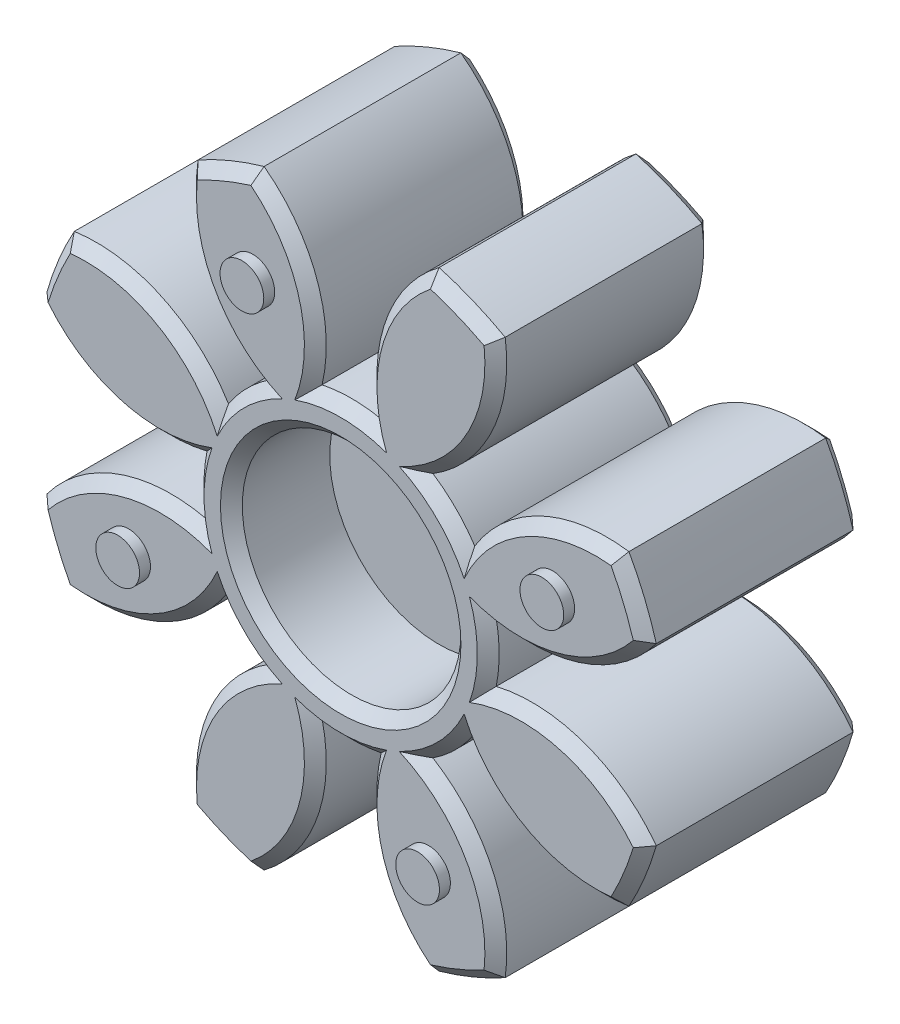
ISO-10303-21;
HEADER;
FILE_DESCRIPTION(('STEP AP214'),'2;1');
FILE_NAME('part.step','',(''),(''),'','','');
FILE_SCHEMA(('AUTOMOTIVE_DESIGN { 1 0 10303 214 1 1 1 1 }'));
ENDSEC;
DATA;
#1=APPLICATION_CONTEXT('core data for automotive mechanical design processes');
#2=APPLICATION_PROTOCOL_DEFINITION('international standard','automotive_design',2000,#1);
#3=PRODUCT_CONTEXT('',#1,'mechanical');
#4=PRODUCT('Part','Part','',(#3));
#5=PRODUCT_RELATED_PRODUCT_CATEGORY('part','',(#4));
#6=PRODUCT_DEFINITION_FORMATION('','',#4);
#7=PRODUCT_DEFINITION_CONTEXT('part definition',#1,'design');
#8=PRODUCT_DEFINITION('design','',#6,#7);
#9=PRODUCT_DEFINITION_SHAPE('','',#8);
#10=(LENGTH_UNIT() NAMED_UNIT(*) SI_UNIT(.MILLI.,.METRE.));
#11=(NAMED_UNIT(*) PLANE_ANGLE_UNIT() SI_UNIT($,.RADIAN.));
#12=(NAMED_UNIT(*) SI_UNIT($,.STERADIAN.) SOLID_ANGLE_UNIT());
#13=UNCERTAINTY_MEASURE_WITH_UNIT(LENGTH_MEASURE(1.E-05),#10,'distance_accuracy_value','');
#14=(GEOMETRIC_REPRESENTATION_CONTEXT(3) GLOBAL_UNCERTAINTY_ASSIGNED_CONTEXT((#13)) GLOBAL_UNIT_ASSIGNED_CONTEXT((#10,
#11,#12)) REPRESENTATION_CONTEXT('',''));
#15=CARTESIAN_POINT('',(0.,0.,0.));
#16=DIRECTION('',(0.,0.,1.));
#17=DIRECTION('',(1.,0.,0.));
#18=AXIS2_PLACEMENT_3D('',#15,#16,#17);
#19=CARTESIAN_POINT('',(0.,0.,10.5));
#20=DIRECTION('',(0.,0.,1.));
#21=DIRECTION('',(1.,0.,0.));
#22=AXIS2_PLACEMENT_3D('',#19,#20,#21);
#23=PLANE('',#22);
#24=CARTESIAN_POINT('',(-4.01817603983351,9.70073509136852,10.5));
#25=DIRECTION('',(0.,0.,1.));
#26=DIRECTION('',(0.,-1.,0.));
#27=AXIS2_PLACEMENT_3D('',#24,#25,#26);
#28=CIRCLE('',#27,1.);
#29=CARTESIAN_POINT('',(-4.0181760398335,8.70073509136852,10.5));
#30=VERTEX_POINT('',#29);
#31=EDGE_CURVE('E2772',#30,#30,#28,.T.);
#32=ORIENTED_EDGE('',*,*,#31,.F.);
#33=EDGE_LOOP('',(#32));
#34=FACE_BOUND('',#33,.T.);
#35=CARTESIAN_POINT('',(9.70073509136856,4.01817603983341,10.5));
#36=DIRECTION('',(0.,0.,1.));
#37=DIRECTION('',(-1.,0.,0.));
#38=AXIS2_PLACEMENT_3D('',#35,#36,#37);
#39=CIRCLE('',#38,1.);
#40=CARTESIAN_POINT('',(8.70073509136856,4.01817603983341,10.5));
#41=VERTEX_POINT('',#40);
#42=EDGE_CURVE('E2771',#41,#41,#39,.T.);
#43=ORIENTED_EDGE('',*,*,#42,.F.);
#44=EDGE_LOOP('',(#43));
#45=FACE_BOUND('',#44,.T.);
#46=CARTESIAN_POINT('',(4.01817603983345,-9.70073509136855,10.5));
#47=DIRECTION('',(0.,0.,1.));
#48=DIRECTION('',(0.,1.,0.));
#49=AXIS2_PLACEMENT_3D('',#46,#47,#48);
#50=CIRCLE('',#49,1.);
#51=CARTESIAN_POINT('',(4.01817603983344,-8.70073509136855,10.5));
#52=VERTEX_POINT('',#51);
#53=EDGE_CURVE('E2781',#52,#52,#50,.T.);
#54=ORIENTED_EDGE('',*,*,#53,.F.);
#55=EDGE_LOOP('',(#54));
#56=FACE_BOUND('',#55,.T.);
#57=CARTESIAN_POINT('',(-9.70073509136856,-4.01817603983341,10.5));
#58=DIRECTION('',(0.,0.,1.));
#59=DIRECTION('',(1.,0.,0.));
#60=AXIS2_PLACEMENT_3D('',#57,#58,#59);
#61=CIRCLE('',#60,1.);
#62=CARTESIAN_POINT('',(-8.70073509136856,-4.01817603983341,10.5));
#63=VERTEX_POINT('',#62);
#64=EDGE_CURVE('E2797',#63,#63,#61,.T.);
#65=ORIENTED_EDGE('',*,*,#64,.F.);
#66=EDGE_LOOP('',(#65));
#67=FACE_BOUND('',#66,.T.);
#68=CARTESIAN_POINT('',(8.25547167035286,-8.25547167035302,10.5));
#69=DIRECTION('',(0.,0.,1.));
#70=DIRECTION('',(1.,0.,0.));
#71=AXIS2_PLACEMENT_3D('',#68,#69,#70);
#72=CIRCLE('',#71,6.59644640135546);
#73=CARTESIAN_POINT('',(2.09887994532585,-5.88703685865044,10.5));
#74=VERTEX_POINT('',#73);
#75=CARTESIAN_POINT('',(4.10690689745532,-13.3840694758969,10.5));
#76=VERTEX_POINT('',#75);
#77=EDGE_CURVE('E460',#74,#76,#72,.T.);
#78=ORIENTED_EDGE('',*,*,#77,.T.);
#79=CARTESIAN_POINT('',(0.,0.,10.5));
#80=DIRECTION('',(0.,0.,1.));
#81=DIRECTION('',(1.,0.,0.));
#82=AXIS2_PLACEMENT_3D('',#79,#80,#81);
#83=CIRCLE('',#82,14.);
#84=CARTESIAN_POINT('',(6.55994456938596,-12.3679880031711,10.5));
#85=VERTEX_POINT('',#84);
#86=EDGE_CURVE('E440',#76,#85,#83,.T.);
#87=ORIENTED_EDGE('',*,*,#86,.T.);
#88=CARTESIAN_POINT('',(0.,-11.675,10.5));
#89=DIRECTION('',(0.,0.,1.));
#90=DIRECTION('',(1.,0.,0.));
#91=AXIS2_PLACEMENT_3D('',#88,#89,#90);
#92=CIRCLE('',#91,6.59644640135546);
#93=CARTESIAN_POINT('',(2.67863144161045,-5.64689592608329,10.5));
#94=VERTEX_POINT('',#93);
#95=EDGE_CURVE('E449',#85,#94,#92,.T.);
#96=ORIENTED_EDGE('',*,*,#95,.T.);
#97=CARTESIAN_POINT('',(0.,0.,10.5));
#98=DIRECTION('',(0.,0.,1.));
#99=DIRECTION('',(1.,0.,0.));
#100=AXIS2_PLACEMENT_3D('',#97,#98,#99);
#101=CIRCLE('',#100,6.24999999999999);
#102=CARTESIAN_POINT('',(5.64689592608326,-2.67863144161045,10.5));
#103=VERTEX_POINT('',#102);
#104=EDGE_CURVE('E455',#94,#103,#101,.T.);
#105=ORIENTED_EDGE('',*,*,#104,.T.);
#106=CARTESIAN_POINT('',(11.675,0.,10.5));
#107=DIRECTION('',(0.,0.,1.));
#108=DIRECTION('',(1.,0.,0.));
#109=AXIS2_PLACEMENT_3D('',#106,#107,#108);
#110=CIRCLE('',#109,6.59644640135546);
#111=CARTESIAN_POINT('',(12.367988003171,-6.55994456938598,10.5));
#112=VERTEX_POINT('',#111);
#113=EDGE_CURVE('E1348',#103,#112,#110,.T.);
#114=ORIENTED_EDGE('',*,*,#113,.T.);
#115=CARTESIAN_POINT('',(0.,0.,10.5));
#116=DIRECTION('',(0.,0.,1.));
#117=DIRECTION('',(1.,0.,0.));
#118=AXIS2_PLACEMENT_3D('',#115,#116,#117);
#119=CIRCLE('',#118,13.9999999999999);
#120=CARTESIAN_POINT('',(13.3840694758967,-4.1069068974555,10.5));
#121=VERTEX_POINT('',#120);
#122=EDGE_CURVE('E1350',#112,#121,#119,.T.);
#123=ORIENTED_EDGE('',*,*,#122,.T.);
#124=CARTESIAN_POINT('',(8.25547167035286,-8.25547167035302,10.5));
#125=DIRECTION('',(0.,0.,1.));
#126=DIRECTION('',(1.,0.,0.));
#127=AXIS2_PLACEMENT_3D('',#124,#125,#126);
#128=CIRCLE('',#127,6.59644640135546);
#129=CARTESIAN_POINT('',(5.88703685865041,-2.09887994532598,10.5));
#130=VERTEX_POINT('',#129);
#131=EDGE_CURVE('E1352',#121,#130,#128,.T.);
#132=ORIENTED_EDGE('',*,*,#131,.T.);
#133=CARTESIAN_POINT('',(0.,0.,10.5));
#134=DIRECTION('',(0.,0.,1.));
#135=DIRECTION('',(1.,0.,0.));
#136=AXIS2_PLACEMENT_3D('',#133,#134,#135);
#137=CIRCLE('',#136,6.24999999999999);
#138=CARTESIAN_POINT('',(5.88703685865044,2.09887994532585,10.5));
#139=VERTEX_POINT('',#138);
#140=EDGE_CURVE('E1354',#130,#139,#137,.T.);
#141=ORIENTED_EDGE('',*,*,#140,.T.);
#142=CARTESIAN_POINT('',(8.25547167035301,8.25547167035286,10.5));
#143=DIRECTION('',(0.,0.,1.));
#144=DIRECTION('',(1.,0.,0.));
#145=AXIS2_PLACEMENT_3D('',#142,#143,#144);
#146=CIRCLE('',#145,6.59644640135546);
#147=CARTESIAN_POINT('',(13.3840694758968,4.10690689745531,10.5));
#148=VERTEX_POINT('',#147);
#149=EDGE_CURVE('E1356',#139,#148,#146,.T.);
#150=ORIENTED_EDGE('',*,*,#149,.T.);
#151=CARTESIAN_POINT('',(0.,0.,10.5));
#152=DIRECTION('',(0.,0.,1.));
#153=DIRECTION('',(1.,0.,0.));
#154=AXIS2_PLACEMENT_3D('',#151,#152,#153);
#155=CIRCLE('',#154,14.);
#156=CARTESIAN_POINT('',(12.3679880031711,6.55994456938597,10.5));
#157=VERTEX_POINT('',#156);
#158=EDGE_CURVE('E1358',#148,#157,#155,.T.);
#159=ORIENTED_EDGE('',*,*,#158,.T.);
#160=CARTESIAN_POINT('',(11.675,0.,10.5));
#161=DIRECTION('',(0.,0.,1.));
#162=DIRECTION('',(1.,0.,0.));
#163=AXIS2_PLACEMENT_3D('',#160,#161,#162);
#164=CIRCLE('',#163,6.59644640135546);
#165=CARTESIAN_POINT('',(5.64689592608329,2.67863144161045,10.5));
#166=VERTEX_POINT('',#165);
#167=EDGE_CURVE('E1360',#157,#166,#164,.T.);
#168=ORIENTED_EDGE('',*,*,#167,.T.);
#169=CARTESIAN_POINT('',(0.,0.,10.5));
#170=DIRECTION('',(0.,0.,1.));
#171=DIRECTION('',(1.,0.,0.));
#172=AXIS2_PLACEMENT_3D('',#169,#170,#171);
#173=CIRCLE('',#172,6.24999999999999);
#174=CARTESIAN_POINT('',(2.67863144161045,5.64689592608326,10.5));
#175=VERTEX_POINT('',#174);
#176=EDGE_CURVE('E1362',#166,#175,#173,.T.);
#177=ORIENTED_EDGE('',*,*,#176,.T.);
#178=CARTESIAN_POINT('',(0.,11.675,10.5));
#179=DIRECTION('',(0.,0.,1.));
#180=DIRECTION('',(1.,0.,0.));
#181=AXIS2_PLACEMENT_3D('',#178,#179,#180);
#182=CIRCLE('',#181,6.59644640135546);
#183=CARTESIAN_POINT('',(6.55994456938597,12.367988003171,10.5));
#184=VERTEX_POINT('',#183);
#185=EDGE_CURVE('E1364',#175,#184,#182,.T.);
#186=ORIENTED_EDGE('',*,*,#185,.T.);
#187=CARTESIAN_POINT('',(0.,0.,10.5));
#188=DIRECTION('',(0.,0.,1.));
#189=DIRECTION('',(1.,0.,0.));
#190=AXIS2_PLACEMENT_3D('',#187,#188,#189);
#191=CIRCLE('',#190,13.9999999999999);
#192=CARTESIAN_POINT('',(4.10690689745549,13.3840694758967,10.5));
#193=VERTEX_POINT('',#192);
#194=EDGE_CURVE('E1366',#184,#193,#191,.T.);
#195=ORIENTED_EDGE('',*,*,#194,.T.);
#196=CARTESIAN_POINT('',(8.25547167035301,8.25547167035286,10.5));
#197=DIRECTION('',(0.,0.,1.));
#198=DIRECTION('',(1.,0.,0.));
#199=AXIS2_PLACEMENT_3D('',#196,#197,#198);
#200=CIRCLE('',#199,6.59644640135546);
#201=CARTESIAN_POINT('',(2.09887994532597,5.88703685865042,10.5));
#202=VERTEX_POINT('',#201);
#203=EDGE_CURVE('E1368',#193,#202,#200,.T.);
#204=ORIENTED_EDGE('',*,*,#203,.T.);
#205=CARTESIAN_POINT('',(0.,0.,10.5));
#206=DIRECTION('',(0.,0.,1.));
#207=DIRECTION('',(1.,0.,0.));
#208=AXIS2_PLACEMENT_3D('',#205,#206,#207);
#209=CIRCLE('',#208,6.24999999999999);
#210=CARTESIAN_POINT('',(-2.09887994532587,5.88703685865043,10.5));
#211=VERTEX_POINT('',#210);
#212=EDGE_CURVE('E1370',#202,#211,#209,.T.);
#213=ORIENTED_EDGE('',*,*,#212,.T.);
#214=CARTESIAN_POINT('',(-8.25547167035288,8.25547167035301,10.5));
#215=DIRECTION('',(0.,0.,1.));
#216=DIRECTION('',(1.,0.,0.));
#217=AXIS2_PLACEMENT_3D('',#214,#215,#216);
#218=CIRCLE('',#217,6.59644640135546);
#219=CARTESIAN_POINT('',(-4.10690689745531,13.3840694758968,10.5));
#220=VERTEX_POINT('',#219);
#221=EDGE_CURVE('E1372',#211,#220,#218,.T.);
#222=ORIENTED_EDGE('',*,*,#221,.T.);
#223=CARTESIAN_POINT('',(0.,0.,10.5));
#224=DIRECTION('',(0.,0.,1.));
#225=DIRECTION('',(1.,0.,0.));
#226=AXIS2_PLACEMENT_3D('',#223,#224,#225);
#227=CIRCLE('',#226,14.);
#228=CARTESIAN_POINT('',(-6.55994456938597,12.3679880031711,10.5));
#229=VERTEX_POINT('',#228);
#230=EDGE_CURVE('E1374',#220,#229,#227,.T.);
#231=ORIENTED_EDGE('',*,*,#230,.T.);
#232=CARTESIAN_POINT('',(0.,11.675,10.5));
#233=DIRECTION('',(0.,0.,1.));
#234=DIRECTION('',(1.,0.,0.));
#235=AXIS2_PLACEMENT_3D('',#232,#233,#234);
#236=CIRCLE('',#235,6.59644640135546);
#237=CARTESIAN_POINT('',(-2.67863144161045,5.64689592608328,10.5));
#238=VERTEX_POINT('',#237);
#239=EDGE_CURVE('E1376',#229,#238,#236,.T.);
#240=ORIENTED_EDGE('',*,*,#239,.T.);
#241=CARTESIAN_POINT('',(0.,0.,10.5));
#242=DIRECTION('',(0.,0.,1.));
#243=DIRECTION('',(1.,0.,0.));
#244=AXIS2_PLACEMENT_3D('',#241,#242,#243);
#245=CIRCLE('',#244,6.24999999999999);
#246=CARTESIAN_POINT('',(-5.64689592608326,2.67863144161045,10.5));
#247=VERTEX_POINT('',#246);
#248=EDGE_CURVE('E1378',#238,#247,#245,.T.);
#249=ORIENTED_EDGE('',*,*,#248,.T.);
#250=CARTESIAN_POINT('',(-11.675,0.,10.5));
#251=DIRECTION('',(0.,0.,1.));
#252=DIRECTION('',(1.,0.,0.));
#253=AXIS2_PLACEMENT_3D('',#250,#251,#252);
#254=CIRCLE('',#253,6.59644640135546);
#255=CARTESIAN_POINT('',(-12.3679880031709,6.55994456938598,10.5));
#256=VERTEX_POINT('',#255);
#257=EDGE_CURVE('E1380',#247,#256,#254,.T.);
#258=ORIENTED_EDGE('',*,*,#257,.T.);
#259=CARTESIAN_POINT('',(0.,0.,10.5));
#260=DIRECTION('',(0.,0.,1.));
#261=DIRECTION('',(1.,0.,0.));
#262=AXIS2_PLACEMENT_3D('',#259,#260,#261);
#263=CIRCLE('',#262,13.9999999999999);
#264=CARTESIAN_POINT('',(-13.3840694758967,4.10690689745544,10.5));
#265=VERTEX_POINT('',#264);
#266=EDGE_CURVE('E1382',#256,#265,#263,.T.);
#267=ORIENTED_EDGE('',*,*,#266,.T.);
#268=CARTESIAN_POINT('',(-8.25547167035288,8.25547167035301,10.5));
#269=DIRECTION('',(0.,0.,1.));
#270=DIRECTION('',(1.,0.,0.));
#271=AXIS2_PLACEMENT_3D('',#268,#269,#270);
#272=CIRCLE('',#271,6.59644640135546);
#273=CARTESIAN_POINT('',(-5.88703685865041,2.09887994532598,10.5));
#274=VERTEX_POINT('',#273);
#275=EDGE_CURVE('E1384',#265,#274,#272,.T.);
#276=ORIENTED_EDGE('',*,*,#275,.T.);
#277=CARTESIAN_POINT('',(0.,0.,10.5));
#278=DIRECTION('',(0.,0.,1.));
#279=DIRECTION('',(1.,0.,0.));
#280=AXIS2_PLACEMENT_3D('',#277,#278,#279);
#281=CIRCLE('',#280,6.24999999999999);
#282=CARTESIAN_POINT('',(-5.88703685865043,-2.09887994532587,10.5));
#283=VERTEX_POINT('',#282);
#284=EDGE_CURVE('E1386',#274,#283,#281,.T.);
#285=ORIENTED_EDGE('',*,*,#284,.T.);
#286=CARTESIAN_POINT('',(-8.25547167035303,-8.25547167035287,10.5));
#287=DIRECTION('',(0.,0.,1.));
#288=DIRECTION('',(1.,0.,0.));
#289=AXIS2_PLACEMENT_3D('',#286,#287,#288);
#290=CIRCLE('',#289,6.59644640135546);
#291=CARTESIAN_POINT('',(-13.3840694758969,-4.10690689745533,10.5));
#292=VERTEX_POINT('',#291);
#293=EDGE_CURVE('E1388',#283,#292,#290,.T.);
#294=ORIENTED_EDGE('',*,*,#293,.T.);
#295=CARTESIAN_POINT('',(0.,0.,10.5));
#296=DIRECTION('',(0.,0.,1.));
#297=DIRECTION('',(1.,0.,0.));
#298=AXIS2_PLACEMENT_3D('',#295,#296,#297);
#299=CIRCLE('',#298,14.);
#300=CARTESIAN_POINT('',(-12.3679880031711,-6.55994456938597,10.5));
#301=VERTEX_POINT('',#300);
#302=EDGE_CURVE('E1390',#292,#301,#299,.T.);
#303=ORIENTED_EDGE('',*,*,#302,.T.);
#304=CARTESIAN_POINT('',(-11.675,0.,10.5));
#305=DIRECTION('',(0.,0.,1.));
#306=DIRECTION('',(1.,0.,0.));
#307=AXIS2_PLACEMENT_3D('',#304,#305,#306);
#308=CIRCLE('',#307,6.59644640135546);
#309=CARTESIAN_POINT('',(-5.64689592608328,-2.67863144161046,10.5));
#310=VERTEX_POINT('',#309);
#311=EDGE_CURVE('E1392',#301,#310,#308,.T.);
#312=ORIENTED_EDGE('',*,*,#311,.T.);
#313=CARTESIAN_POINT('',(0.,0.,10.5));
#314=DIRECTION('',(0.,0.,1.));
#315=DIRECTION('',(1.,0.,0.));
#316=AXIS2_PLACEMENT_3D('',#313,#314,#315);
#317=CIRCLE('',#316,6.24999999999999);
#318=CARTESIAN_POINT('',(-2.67863144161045,-5.64689592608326,10.5));
#319=VERTEX_POINT('',#318);
#320=EDGE_CURVE('E1394',#310,#319,#317,.T.);
#321=ORIENTED_EDGE('',*,*,#320,.T.);
#322=CARTESIAN_POINT('',(0.,-11.675,10.5));
#323=DIRECTION('',(0.,0.,1.));
#324=DIRECTION('',(1.,0.,0.));
#325=AXIS2_PLACEMENT_3D('',#322,#323,#324);
#326=CIRCLE('',#325,6.59644640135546);
#327=CARTESIAN_POINT('',(-6.55994456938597,-12.367988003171,10.5));
#328=VERTEX_POINT('',#327);
#329=EDGE_CURVE('E1396',#319,#328,#326,.T.);
#330=ORIENTED_EDGE('',*,*,#329,.T.);
#331=CARTESIAN_POINT('',(0.,0.,10.5));
#332=DIRECTION('',(0.,0.,1.));
#333=DIRECTION('',(1.,0.,0.));
#334=AXIS2_PLACEMENT_3D('',#331,#332,#333);
#335=CIRCLE('',#334,13.9999999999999);
#336=CARTESIAN_POINT('',(-4.1069068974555,-13.3840694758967,10.5));
#337=VERTEX_POINT('',#336);
#338=EDGE_CURVE('E1398',#328,#337,#335,.T.);
#339=ORIENTED_EDGE('',*,*,#338,.T.);
#340=CARTESIAN_POINT('',(-8.25547167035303,-8.25547167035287,10.5));
#341=DIRECTION('',(0.,0.,1.));
#342=DIRECTION('',(1.,0.,0.));
#343=AXIS2_PLACEMENT_3D('',#340,#341,#342);
#344=CIRCLE('',#343,6.59644640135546);
#345=CARTESIAN_POINT('',(-2.098879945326,-5.88703685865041,10.5));
#346=VERTEX_POINT('',#345);
#347=EDGE_CURVE('E1400',#337,#346,#344,.T.);
#348=ORIENTED_EDGE('',*,*,#347,.T.);
#349=CARTESIAN_POINT('',(0.,0.,10.5));
#350=DIRECTION('',(0.,0.,1.));
#351=DIRECTION('',(1.,0.,0.));
#352=AXIS2_PLACEMENT_3D('',#349,#350,#351);
#353=CIRCLE('',#352,6.24999999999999);
#354=EDGE_CURVE('E465',#346,#74,#353,.T.);
#355=ORIENTED_EDGE('',*,*,#354,.T.);
#356=EDGE_LOOP('',(#78,#87,#96,#105,#114,#123,#132,#141,#150,#159,#168,#177,#186,#195,#204,#213,
#222,#231,#240,#249,#258,#267,#276,#285,#294,#303,#312,#321,#330,#339,#348,#355));
#357=FACE_BOUND('',#356,.T.);
#358=CARTESIAN_POINT('',(0.,0.,10.5));
#359=DIRECTION('',(0.,0.,1.));
#360=DIRECTION('',(1.,0.,0.));
#361=AXIS2_PLACEMENT_3D('',#358,#359,#360);
#362=CIRCLE('',#361,5.5);
#363=CARTESIAN_POINT('',(5.5,0.,10.5));
#364=VERTEX_POINT('',#363);
#365=EDGE_CURVE('E456',#364,#364,#362,.F.);
#366=ORIENTED_EDGE('',*,*,#365,.T.);
#367=EDGE_LOOP('',(#366));
#368=FACE_BOUND('',#367,.T.);
#369=ADVANCED_FACE('F34',(#34,#45,#56,#67,#357,#368),#23,.T.);
#370=CARTESIAN_POINT('',(0.,0.,6.));
#371=DIRECTION('',(0.,0.,1.));
#372=DIRECTION('',(1.,0.,0.));
#373=AXIS2_PLACEMENT_3D('',#370,#371,#372);
#374=CYLINDRICAL_SURFACE('',#373,5.);
#375=CARTESIAN_POINT('',(0.,0.,10.));
#376=DIRECTION('',(0.,0.,1.));
#377=DIRECTION('',(1.,0.,0.));
#378=AXIS2_PLACEMENT_3D('',#375,#376,#377);
#379=CIRCLE('',#378,5.);
#380=CARTESIAN_POINT('',(5.,0.,10.));
#381=VERTEX_POINT('',#380);
#382=EDGE_CURVE('E595',#381,#381,#379,.T.);
#383=ORIENTED_EDGE('',*,*,#382,.T.);
#384=EDGE_LOOP('',(#383));
#385=FACE_BOUND('',#384,.T.);
#386=CARTESIAN_POINT('',(0.,0.,6.));
#387=DIRECTION('',(0.,0.,1.));
#388=DIRECTION('',(1.,0.,0.));
#389=AXIS2_PLACEMENT_3D('',#386,#387,#388);
#390=CIRCLE('',#389,5.);
#391=CARTESIAN_POINT('',(5.,0.,6.));
#392=VERTEX_POINT('',#391);
#393=EDGE_CURVE('E1334',#392,#392,#390,.T.);
#394=ORIENTED_EDGE('',*,*,#393,.F.);
#395=EDGE_LOOP('',(#394));
#396=FACE_BOUND('',#395,.T.);
#397=ADVANCED_FACE('F1834',(#385,#396),#374,.F.);
#398=CARTESIAN_POINT('',(0.,0.,6.));
#399=DIRECTION('',(0.,0.,1.));
#400=DIRECTION('',(1.,0.,0.));
#401=AXIS2_PLACEMENT_3D('',#398,#399,#400);
#402=PLANE('',#401);
#403=ORIENTED_EDGE('',*,*,#393,.T.);
#404=EDGE_LOOP('',(#403));
#405=FACE_BOUND('',#404,.T.);
#406=ADVANCED_FACE('F1840',(#405),#402,.T.);
#407=CARTESIAN_POINT('',(0.,0.,0.5));
#408=DIRECTION('',(0.,0.,1.));
#409=DIRECTION('',(1.,0.,0.));
#410=AXIS2_PLACEMENT_3D('',#407,#408,#409);
#411=CYLINDRICAL_SURFACE('',#410,6.75);
#412=DIRECTION('',(0.,0.,1.));
#413=VECTOR('',#412,1.);
#414=CARTESIAN_POINT('',(5.63205882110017,-3.72053940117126,0.5));
#415=LINE('',#414,#413);
#416=CARTESIAN_POINT('',(5.63205882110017,-3.72053940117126,1.));
#417=VERTEX_POINT('',#416);
#418=CARTESIAN_POINT('',(5.63205882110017,-3.72053940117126,9.99999999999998));
#419=VERTEX_POINT('',#418);
#420=EDGE_CURVE('E982',#417,#419,#415,.T.);
#421=ORIENTED_EDGE('',*,*,#420,.T.);
#422=CARTESIAN_POINT('',(0.,0.,9.99999999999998));
#423=DIRECTION('',(0.,0.,1.));
#424=DIRECTION('',(1.,0.,0.));
#425=AXIS2_PLACEMENT_3D('',#422,#423,#424);
#426=CIRCLE('',#425,6.75);
#427=CARTESIAN_POINT('',(3.72053940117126,-5.63205882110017,9.99999999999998));
#428=VERTEX_POINT('',#427);
#429=EDGE_CURVE('E589',#419,#428,#426,.F.);
#430=ORIENTED_EDGE('',*,*,#429,.T.);
#431=DIRECTION('',(0.,0.,1.));
#432=VECTOR('',#431,1.);
#433=CARTESIAN_POINT('',(3.72053940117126,-5.63205882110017,0.5));
#434=LINE('',#433,#432);
#435=CARTESIAN_POINT('',(3.72053940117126,-5.63205882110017,1.));
#436=VERTEX_POINT('',#435);
#437=EDGE_CURVE('E1335',#436,#428,#434,.T.);
#438=ORIENTED_EDGE('',*,*,#437,.F.);
#439=CARTESIAN_POINT('',(0.,0.,1.));
#440=DIRECTION('',(0.,0.,1.));
#441=DIRECTION('',(1.,0.,0.));
#442=AXIS2_PLACEMENT_3D('',#439,#440,#441);
#443=CIRCLE('',#442,6.75);
#444=EDGE_CURVE('E587',#436,#417,#443,.T.);
#445=ORIENTED_EDGE('',*,*,#444,.T.);
#446=EDGE_LOOP('',(#421,#430,#438,#445));
#447=FACE_BOUND('',#446,.T.);
#448=ADVANCED_FACE('F1511',(#447),#411,.T.);
#449=CARTESIAN_POINT('',(0.,-11.675,0.5));
#450=DIRECTION('',(0.,0.,1.));
#451=DIRECTION('',(1.,0.,0.));
#452=AXIS2_PLACEMENT_3D('',#449,#450,#451);
#453=CYLINDRICAL_SURFACE('',#452,7.09644640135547);
#454=ORIENTED_EDGE('',*,*,#437,.T.);
#455=CARTESIAN_POINT('',(0.,-11.675,9.99999999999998));
#456=DIRECTION('',(0.,0.,1.));
#457=DIRECTION('',(1.,0.,0.));
#458=AXIS2_PLACEMENT_3D('',#455,#456,#457);
#459=CIRCLE('',#458,7.09644640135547);
#460=CARTESIAN_POINT('',(7.0241965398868,-12.6850566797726,9.99999999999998));
#461=VERTEX_POINT('',#460);
#462=EDGE_CURVE('E593',#428,#461,#459,.F.);
#463=ORIENTED_EDGE('',*,*,#462,.T.);
#464=DIRECTION('',(0.,0.,1.));
#465=VECTOR('',#464,1.);
#466=CARTESIAN_POINT('',(7.0241965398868,-12.6850566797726,0.5));
#467=LINE('',#466,#465);
#468=CARTESIAN_POINT('',(7.0241965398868,-12.6850566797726,1.));
#469=VERTEX_POINT('',#468);
#470=EDGE_CURVE('E1340',#469,#461,#467,.T.);
#471=ORIENTED_EDGE('',*,*,#470,.F.);
#472=CARTESIAN_POINT('',(0.,-11.675,1.));
#473=DIRECTION('',(0.,0.,1.));
#474=DIRECTION('',(1.,0.,0.));
#475=AXIS2_PLACEMENT_3D('',#472,#473,#474);
#476=CIRCLE('',#475,7.09644640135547);
#477=EDGE_CURVE('E591',#469,#436,#476,.T.);
#478=ORIENTED_EDGE('',*,*,#477,.T.);
#479=EDGE_LOOP('',(#454,#463,#471,#478));
#480=FACE_BOUND('',#479,.T.);
#481=ADVANCED_FACE('F1523',(#480),#453,.T.);
#482=CARTESIAN_POINT('',(0.,0.,0.5));
#483=DIRECTION('',(0.,0.,1.));
#484=DIRECTION('',(1.,0.,0.));
#485=AXIS2_PLACEMENT_3D('',#482,#483,#484);
#486=CYLINDRICAL_SURFACE('',#485,14.5);
#487=ORIENTED_EDGE('',*,*,#470,.T.);
#488=CARTESIAN_POINT('',(0.,0.,9.99999999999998));
#489=DIRECTION('',(0.,0.,1.));
#490=DIRECTION('',(1.,0.,0.));
#491=AXIS2_PLACEMENT_3D('',#488,#489,#490);
#492=CIRCLE('',#491,14.5);
#493=CARTESIAN_POINT('',(4.00283259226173,-13.936546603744,9.99999999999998));
#494=VERTEX_POINT('',#493);
#495=EDGE_CURVE('E442',#461,#494,#492,.F.);
#496=ORIENTED_EDGE('',*,*,#495,.T.);
#497=DIRECTION('',(0.,0.,1.));
#498=VECTOR('',#497,1.);
#499=CARTESIAN_POINT('',(4.00283259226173,-13.936546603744,0.5));
#500=LINE('',#499,#498);
#501=CARTESIAN_POINT('',(4.00283259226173,-13.936546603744,1.));
#502=VERTEX_POINT('',#501);
#503=EDGE_CURVE('E1415',#502,#494,#500,.T.);
#504=ORIENTED_EDGE('',*,*,#503,.F.);
#505=CARTESIAN_POINT('',(0.,0.,1.));
#506=DIRECTION('',(0.,0.,1.));
#507=DIRECTION('',(1.,0.,0.));
#508=AXIS2_PLACEMENT_3D('',#505,#506,#507);
#509=CIRCLE('',#508,14.5);
#510=EDGE_CURVE('E462',#502,#469,#509,.T.);
#511=ORIENTED_EDGE('',*,*,#510,.T.);
#512=EDGE_LOOP('',(#487,#496,#504,#511));
#513=FACE_BOUND('',#512,.T.);
#514=ADVANCED_FACE('F1414',(#513),#486,.T.);
#515=CARTESIAN_POINT('',(8.25547167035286,-8.25547167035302,0.5));
#516=DIRECTION('',(0.,0.,1.));
#517=DIRECTION('',(1.,0.,0.));
#518=AXIS2_PLACEMENT_3D('',#515,#516,#517);
#519=CYLINDRICAL_SURFACE('',#518,7.09644640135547);
#520=ORIENTED_EDGE('',*,*,#503,.T.);
#521=CARTESIAN_POINT('',(8.25547167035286,-8.25547167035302,9.99999999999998));
#522=DIRECTION('',(0.,0.,1.));
#523=DIRECTION('',(1.,0.,0.));
#524=AXIS2_PLACEMENT_3D('',#521,#522,#523);
#525=CIRCLE('',#524,7.09644640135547);
#526=CARTESIAN_POINT('',(1.35164834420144,-6.61328562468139,9.99999999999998));
#527=VERTEX_POINT('',#526);
#528=EDGE_CURVE('E472',#494,#527,#525,.F.);
#529=ORIENTED_EDGE('',*,*,#528,.T.);
#530=DIRECTION('',(0.,0.,1.));
#531=VECTOR('',#530,1.);
#532=CARTESIAN_POINT('',(1.35164834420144,-6.61328562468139,0.5));
#533=LINE('',#532,#531);
#534=CARTESIAN_POINT('',(1.35164834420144,-6.61328562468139,1.));
#535=VERTEX_POINT('',#534);
#536=EDGE_CURVE('E1420',#535,#527,#533,.T.);
#537=ORIENTED_EDGE('',*,*,#536,.F.);
#538=CARTESIAN_POINT('',(8.25547167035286,-8.25547167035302,1.));
#539=DIRECTION('',(0.,0.,1.));
#540=DIRECTION('',(1.,0.,0.));
#541=AXIS2_PLACEMENT_3D('',#538,#539,#540);
#542=CIRCLE('',#541,7.09644640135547);
#543=EDGE_CURVE('E470',#535,#502,#542,.T.);
#544=ORIENTED_EDGE('',*,*,#543,.T.);
#545=EDGE_LOOP('',(#520,#529,#537,#544));
#546=FACE_BOUND('',#545,.T.);
#547=ADVANCED_FACE('F1418',(#546),#519,.T.);
#548=CARTESIAN_POINT('',(0.,0.,0.5));
#549=DIRECTION('',(0.,0.,1.));
#550=DIRECTION('',(1.,0.,0.));
#551=AXIS2_PLACEMENT_3D('',#548,#549,#550);
#552=CYLINDRICAL_SURFACE('',#551,6.75);
#553=ORIENTED_EDGE('',*,*,#536,.T.);
#554=CARTESIAN_POINT('',(0.,0.,9.99999999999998));
#555=DIRECTION('',(0.,0.,1.));
#556=DIRECTION('',(1.,0.,0.));
#557=AXIS2_PLACEMENT_3D('',#554,#555,#556);
#558=CIRCLE('',#557,6.75);
#559=CARTESIAN_POINT('',(-1.35164834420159,-6.61328562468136,9.99999999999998));
#560=VERTEX_POINT('',#559);
#561=EDGE_CURVE('E476',#527,#560,#558,.F.);
#562=ORIENTED_EDGE('',*,*,#561,.T.);
#563=DIRECTION('',(0.,0.,1.));
#564=VECTOR('',#563,1.);
#565=CARTESIAN_POINT('',(-1.35164834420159,-6.61328562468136,0.5));
#566=LINE('',#565,#564);
#567=CARTESIAN_POINT('',(-1.35164834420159,-6.61328562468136,1.));
#568=VERTEX_POINT('',#567);
#569=EDGE_CURVE('E1423',#568,#560,#566,.T.);
#570=ORIENTED_EDGE('',*,*,#569,.F.);
#571=CARTESIAN_POINT('',(0.,0.,1.));
#572=DIRECTION('',(0.,0.,1.));
#573=DIRECTION('',(1.,0.,0.));
#574=AXIS2_PLACEMENT_3D('',#571,#572,#573);
#575=CIRCLE('',#574,6.75);
#576=EDGE_CURVE('E474',#568,#535,#575,.T.);
#577=ORIENTED_EDGE('',*,*,#576,.T.);
#578=EDGE_LOOP('',(#553,#562,#570,#577));
#579=FACE_BOUND('',#578,.T.);
#580=ADVANCED_FACE('F1653',(#579),#552,.T.);
#581=CARTESIAN_POINT('',(-8.25547167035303,-8.25547167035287,0.5));
#582=DIRECTION('',(0.,0.,1.));
#583=DIRECTION('',(1.,0.,0.));
#584=AXIS2_PLACEMENT_3D('',#581,#582,#583);
#585=CYLINDRICAL_SURFACE('',#584,7.09644640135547);
#586=ORIENTED_EDGE('',*,*,#569,.T.);
#587=CARTESIAN_POINT('',(-8.25547167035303,-8.25547167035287,9.99999999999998));
#588=DIRECTION('',(0.,0.,1.));
#589=DIRECTION('',(1.,0.,0.));
#590=AXIS2_PLACEMENT_3D('',#587,#588,#589);
#591=CIRCLE('',#590,7.09644640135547);
#592=CARTESIAN_POINT('',(-4.0028325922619,-13.9365466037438,9.99999999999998));
#593=VERTEX_POINT('',#592);
#594=EDGE_CURVE('E480',#560,#593,#591,.F.);
#595=ORIENTED_EDGE('',*,*,#594,.T.);
#596=DIRECTION('',(0.,0.,1.));
#597=VECTOR('',#596,1.);
#598=CARTESIAN_POINT('',(-4.0028325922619,-13.9365466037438,0.5));
#599=LINE('',#598,#597);
#600=CARTESIAN_POINT('',(-4.0028325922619,-13.9365466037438,1.));
#601=VERTEX_POINT('',#600);
#602=EDGE_CURVE('E1428',#601,#593,#599,.T.);
#603=ORIENTED_EDGE('',*,*,#602,.F.);
#604=CARTESIAN_POINT('',(-8.25547167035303,-8.25547167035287,1.));
#605=DIRECTION('',(0.,0.,1.));
#606=DIRECTION('',(1.,0.,0.));
#607=AXIS2_PLACEMENT_3D('',#604,#605,#606);
#608=CIRCLE('',#607,7.09644640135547);
#609=EDGE_CURVE('E478',#601,#568,#608,.T.);
#610=ORIENTED_EDGE('',*,*,#609,.T.);
#611=EDGE_LOOP('',(#586,#595,#603,#610));
#612=FACE_BOUND('',#611,.T.);
#613=ADVANCED_FACE('F1639',(#612),#585,.T.);
#614=CARTESIAN_POINT('',(0.,0.,0.5));
#615=DIRECTION('',(0.,0.,1.));
#616=DIRECTION('',(1.,0.,0.));
#617=AXIS2_PLACEMENT_3D('',#614,#615,#616);
#618=CYLINDRICAL_SURFACE('',#617,14.4999999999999);
#619=ORIENTED_EDGE('',*,*,#602,.T.);
#620=CARTESIAN_POINT('',(0.,0.,9.99999999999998));
#621=DIRECTION('',(0.,0.,1.));
#622=DIRECTION('',(1.,0.,0.));
#623=AXIS2_PLACEMENT_3D('',#620,#621,#622);
#624=CIRCLE('',#623,14.4999999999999);
#625=CARTESIAN_POINT('',(-7.02419653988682,-12.6850566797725,9.99999999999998));
#626=VERTEX_POINT('',#625);
#627=EDGE_CURVE('E484',#593,#626,#624,.F.);
#628=ORIENTED_EDGE('',*,*,#627,.T.);
#629=DIRECTION('',(0.,0.,1.));
#630=VECTOR('',#629,1.);
#631=CARTESIAN_POINT('',(-7.02419653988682,-12.6850566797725,0.5));
#632=LINE('',#631,#630);
#633=CARTESIAN_POINT('',(-7.02419653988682,-12.6850566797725,1.));
#634=VERTEX_POINT('',#633);
#635=EDGE_CURVE('E1431',#634,#626,#632,.T.);
#636=ORIENTED_EDGE('',*,*,#635,.F.);
#637=CARTESIAN_POINT('',(0.,0.,1.));
#638=DIRECTION('',(0.,0.,1.));
#639=DIRECTION('',(1.,0.,0.));
#640=AXIS2_PLACEMENT_3D('',#637,#638,#639);
#641=CIRCLE('',#640,14.4999999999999);
#642=EDGE_CURVE('E482',#634,#601,#641,.T.);
#643=ORIENTED_EDGE('',*,*,#642,.T.);
#644=EDGE_LOOP('',(#619,#628,#636,#643));
#645=FACE_BOUND('',#644,.T.);
#646=ADVANCED_FACE('F1643',(#645),#618,.T.);
#647=CARTESIAN_POINT('',(0.,-11.675,0.5));
#648=DIRECTION('',(0.,0.,1.));
#649=DIRECTION('',(1.,0.,0.));
#650=AXIS2_PLACEMENT_3D('',#647,#648,#649);
#651=CYLINDRICAL_SURFACE('',#650,7.09644640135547);
#652=ORIENTED_EDGE('',*,*,#635,.T.);
#653=CARTESIAN_POINT('',(0.,-11.675,9.99999999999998));
#654=DIRECTION('',(0.,0.,1.));
#655=DIRECTION('',(1.,0.,0.));
#656=AXIS2_PLACEMENT_3D('',#653,#654,#655);
#657=CIRCLE('',#656,7.09644640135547);
#658=CARTESIAN_POINT('',(-3.72053940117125,-5.63205882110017,9.99999999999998));
#659=VERTEX_POINT('',#658);
#660=EDGE_CURVE('E488',#626,#659,#657,.F.);
#661=ORIENTED_EDGE('',*,*,#660,.T.);
#662=DIRECTION('',(0.,0.,1.));
#663=VECTOR('',#662,1.);
#664=CARTESIAN_POINT('',(-3.72053940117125,-5.63205882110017,0.5));
#665=LINE('',#664,#663);
#666=CARTESIAN_POINT('',(-3.72053940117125,-5.63205882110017,1.));
#667=VERTEX_POINT('',#666);
#668=EDGE_CURVE('E1434',#667,#659,#665,.T.);
#669=ORIENTED_EDGE('',*,*,#668,.F.);
#670=CARTESIAN_POINT('',(0.,-11.675,1.));
#671=DIRECTION('',(0.,0.,1.));
#672=DIRECTION('',(1.,0.,0.));
#673=AXIS2_PLACEMENT_3D('',#670,#671,#672);
#674=CIRCLE('',#673,7.09644640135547);
#675=EDGE_CURVE('E486',#667,#634,#674,.T.);
#676=ORIENTED_EDGE('',*,*,#675,.T.);
#677=EDGE_LOOP('',(#652,#661,#669,#676));
#678=FACE_BOUND('',#677,.T.);
#679=ADVANCED_FACE('F1821',(#678),#651,.T.);
#680=CARTESIAN_POINT('',(0.,0.,0.5));
#681=DIRECTION('',(0.,0.,1.));
#682=DIRECTION('',(1.,0.,0.));
#683=AXIS2_PLACEMENT_3D('',#680,#681,#682);
#684=CYLINDRICAL_SURFACE('',#683,6.75);
#685=ORIENTED_EDGE('',*,*,#668,.T.);
#686=CARTESIAN_POINT('',(0.,0.,9.99999999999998));
#687=DIRECTION('',(0.,0.,1.));
#688=DIRECTION('',(1.,0.,0.));
#689=AXIS2_PLACEMENT_3D('',#686,#687,#688);
#690=CIRCLE('',#689,6.75);
#691=CARTESIAN_POINT('',(-5.63205882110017,-3.72053940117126,9.99999999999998));
#692=VERTEX_POINT('',#691);
#693=EDGE_CURVE('E492',#659,#692,#690,.F.);
#694=ORIENTED_EDGE('',*,*,#693,.T.);
#695=DIRECTION('',(0.,0.,1.));
#696=VECTOR('',#695,1.);
#697=CARTESIAN_POINT('',(-5.63205882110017,-3.72053940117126,0.5));
#698=LINE('',#697,#696);
#699=CARTESIAN_POINT('',(-5.63205882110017,-3.72053940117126,1.));
#700=VERTEX_POINT('',#699);
#701=EDGE_CURVE('E1437',#700,#692,#698,.T.);
#702=ORIENTED_EDGE('',*,*,#701,.F.);
#703=CARTESIAN_POINT('',(0.,0.,1.));
#704=DIRECTION('',(0.,0.,1.));
#705=DIRECTION('',(1.,0.,0.));
#706=AXIS2_PLACEMENT_3D('',#703,#704,#705);
#707=CIRCLE('',#706,6.75);
#708=EDGE_CURVE('E490',#700,#667,#707,.T.);
#709=ORIENTED_EDGE('',*,*,#708,.T.);
#710=EDGE_LOOP('',(#685,#694,#702,#709));
#711=FACE_BOUND('',#710,.T.);
#712=ADVANCED_FACE('F1817',(#711),#684,.T.);
#713=CARTESIAN_POINT('',(-11.675,0.,0.5));
#714=DIRECTION('',(0.,0.,1.));
#715=DIRECTION('',(1.,0.,0.));
#716=AXIS2_PLACEMENT_3D('',#713,#714,#715);
#717=CYLINDRICAL_SURFACE('',#716,7.09644640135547);
#718=ORIENTED_EDGE('',*,*,#701,.T.);
#719=CARTESIAN_POINT('',(-11.675,0.,9.99999999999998));
#720=DIRECTION('',(0.,0.,1.));
#721=DIRECTION('',(1.,0.,0.));
#722=AXIS2_PLACEMENT_3D('',#719,#720,#721);
#723=CIRCLE('',#722,7.09644640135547);
#724=CARTESIAN_POINT('',(-12.6850566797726,-7.02419653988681,9.99999999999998));
#725=VERTEX_POINT('',#724);
#726=EDGE_CURVE('E496',#692,#725,#723,.F.);
#727=ORIENTED_EDGE('',*,*,#726,.T.);
#728=DIRECTION('',(0.,0.,1.));
#729=VECTOR('',#728,1.);
#730=CARTESIAN_POINT('',(-12.6850566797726,-7.02419653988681,0.5));
#731=LINE('',#730,#729);
#732=CARTESIAN_POINT('',(-12.6850566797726,-7.02419653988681,1.));
#733=VERTEX_POINT('',#732);
#734=EDGE_CURVE('E1440',#733,#725,#731,.T.);
#735=ORIENTED_EDGE('',*,*,#734,.F.);
#736=CARTESIAN_POINT('',(-11.675,0.,1.));
#737=DIRECTION('',(0.,0.,1.));
#738=DIRECTION('',(1.,0.,0.));
#739=AXIS2_PLACEMENT_3D('',#736,#737,#738);
#740=CIRCLE('',#739,7.09644640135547);
#741=EDGE_CURVE('E494',#733,#700,#740,.T.);
#742=ORIENTED_EDGE('',*,*,#741,.T.);
#743=EDGE_LOOP('',(#718,#727,#735,#742));
#744=FACE_BOUND('',#743,.T.);
#745=ADVANCED_FACE('F1815',(#744),#717,.T.);
#746=CARTESIAN_POINT('',(0.,0.,0.5));
#747=DIRECTION('',(0.,0.,1.));
#748=DIRECTION('',(1.,0.,0.));
#749=AXIS2_PLACEMENT_3D('',#746,#747,#748);
#750=CYLINDRICAL_SURFACE('',#749,14.5);
#751=ORIENTED_EDGE('',*,*,#734,.T.);
#752=CARTESIAN_POINT('',(0.,0.,9.99999999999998));
#753=DIRECTION('',(0.,0.,1.));
#754=DIRECTION('',(1.,0.,0.));
#755=AXIS2_PLACEMENT_3D('',#752,#753,#754);
#756=CIRCLE('',#755,14.5);
#757=CARTESIAN_POINT('',(-13.936546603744,-4.00283259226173,9.99999999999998));
#758=VERTEX_POINT('',#757);
#759=EDGE_CURVE('E500',#725,#758,#756,.F.);
#760=ORIENTED_EDGE('',*,*,#759,.T.);
#761=DIRECTION('',(0.,0.,1.));
#762=VECTOR('',#761,1.);
#763=CARTESIAN_POINT('',(-13.936546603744,-4.00283259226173,0.5));
#764=LINE('',#763,#762);
#765=CARTESIAN_POINT('',(-13.936546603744,-4.00283259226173,1.));
#766=VERTEX_POINT('',#765);
#767=EDGE_CURVE('E1443',#766,#758,#764,.T.);
#768=ORIENTED_EDGE('',*,*,#767,.F.);
#769=CARTESIAN_POINT('',(0.,0.,1.));
#770=DIRECTION('',(0.,0.,1.));
#771=DIRECTION('',(1.,0.,0.));
#772=AXIS2_PLACEMENT_3D('',#769,#770,#771);
#773=CIRCLE('',#772,14.5);
#774=EDGE_CURVE('E498',#766,#733,#773,.T.);
#775=ORIENTED_EDGE('',*,*,#774,.T.);
#776=EDGE_LOOP('',(#751,#760,#768,#775));
#777=FACE_BOUND('',#776,.T.);
#778=ADVANCED_FACE('F1803',(#777),#750,.T.);
#779=CARTESIAN_POINT('',(-8.25547167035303,-8.25547167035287,0.5));
#780=DIRECTION('',(0.,0.,1.));
#781=DIRECTION('',(1.,0.,0.));
#782=AXIS2_PLACEMENT_3D('',#779,#780,#781);
#783=CYLINDRICAL_SURFACE('',#782,7.09644640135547);
#784=ORIENTED_EDGE('',*,*,#767,.T.);
#785=CARTESIAN_POINT('',(-8.25547167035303,-8.25547167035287,9.99999999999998));
#786=DIRECTION('',(0.,0.,1.));
#787=DIRECTION('',(1.,0.,0.));
#788=AXIS2_PLACEMENT_3D('',#785,#786,#787);
#789=CIRCLE('',#788,7.09644640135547);
#790=CARTESIAN_POINT('',(-6.61328562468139,-1.35164834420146,9.99999999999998));
#791=VERTEX_POINT('',#790);
#792=EDGE_CURVE('E504',#758,#791,#789,.F.);
#793=ORIENTED_EDGE('',*,*,#792,.T.);
#794=DIRECTION('',(0.,0.,1.));
#795=VECTOR('',#794,1.);
#796=CARTESIAN_POINT('',(-6.61328562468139,-1.35164834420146,0.5));
#797=LINE('',#796,#795);
#798=CARTESIAN_POINT('',(-6.61328562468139,-1.35164834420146,1.));
#799=VERTEX_POINT('',#798);
#800=EDGE_CURVE('E1446',#799,#791,#797,.T.);
#801=ORIENTED_EDGE('',*,*,#800,.F.);
#802=CARTESIAN_POINT('',(-8.25547167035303,-8.25547167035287,1.));
#803=DIRECTION('',(0.,0.,1.));
#804=DIRECTION('',(1.,0.,0.));
#805=AXIS2_PLACEMENT_3D('',#802,#803,#804);
#806=CIRCLE('',#805,7.09644640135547);
#807=EDGE_CURVE('E502',#799,#766,#806,.T.);
#808=ORIENTED_EDGE('',*,*,#807,.T.);
#809=EDGE_LOOP('',(#784,#793,#801,#808));
#810=FACE_BOUND('',#809,.T.);
#811=ADVANCED_FACE('F1799',(#810),#783,.T.);
#812=CARTESIAN_POINT('',(0.,0.,0.5));
#813=DIRECTION('',(0.,0.,1.));
#814=DIRECTION('',(1.,0.,0.));
#815=AXIS2_PLACEMENT_3D('',#812,#813,#814);
#816=CYLINDRICAL_SURFACE('',#815,6.75);
#817=ORIENTED_EDGE('',*,*,#800,.T.);
#818=CARTESIAN_POINT('',(0.,0.,9.99999999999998));
#819=DIRECTION('',(0.,0.,1.));
#820=DIRECTION('',(1.,0.,0.));
#821=AXIS2_PLACEMENT_3D('',#818,#819,#820);
#822=CIRCLE('',#821,6.75);
#823=CARTESIAN_POINT('',(-6.61328562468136,1.35164834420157,9.99999999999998));
#824=VERTEX_POINT('',#823);
#825=EDGE_CURVE('E508',#791,#824,#822,.F.);
#826=ORIENTED_EDGE('',*,*,#825,.T.);
#827=DIRECTION('',(0.,0.,1.));
#828=VECTOR('',#827,1.);
#829=CARTESIAN_POINT('',(-6.61328562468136,1.35164834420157,0.5));
#830=LINE('',#829,#828);
#831=CARTESIAN_POINT('',(-6.61328562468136,1.35164834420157,1.));
#832=VERTEX_POINT('',#831);
#833=EDGE_CURVE('E1449',#832,#824,#830,.T.);
#834=ORIENTED_EDGE('',*,*,#833,.F.);
#835=CARTESIAN_POINT('',(0.,0.,1.));
#836=DIRECTION('',(0.,0.,1.));
#837=DIRECTION('',(1.,0.,0.));
#838=AXIS2_PLACEMENT_3D('',#835,#836,#837);
#839=CIRCLE('',#838,6.75);
#840=EDGE_CURVE('E506',#832,#799,#839,.T.);
#841=ORIENTED_EDGE('',*,*,#840,.T.);
#842=EDGE_LOOP('',(#817,#826,#834,#841));
#843=FACE_BOUND('',#842,.T.);
#844=ADVANCED_FACE('F1797',(#843),#816,.T.);
#845=CARTESIAN_POINT('',(-8.25547167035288,8.25547167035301,0.5));
#846=DIRECTION('',(0.,0.,1.));
#847=DIRECTION('',(1.,0.,0.));
#848=AXIS2_PLACEMENT_3D('',#845,#846,#847);
#849=CYLINDRICAL_SURFACE('',#848,7.09644640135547);
#850=ORIENTED_EDGE('',*,*,#833,.T.);
#851=CARTESIAN_POINT('',(-8.25547167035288,8.25547167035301,9.99999999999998));
#852=DIRECTION('',(0.,0.,1.));
#853=DIRECTION('',(1.,0.,0.));
#854=AXIS2_PLACEMENT_3D('',#851,#852,#853);
#855=CIRCLE('',#854,7.09644640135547);
#856=CARTESIAN_POINT('',(-13.9365466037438,4.00283259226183,9.99999999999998));
#857=VERTEX_POINT('',#856);
#858=EDGE_CURVE('E512',#824,#857,#855,.F.);
#859=ORIENTED_EDGE('',*,*,#858,.T.);
#860=DIRECTION('',(0.,0.,1.));
#861=VECTOR('',#860,1.);
#862=CARTESIAN_POINT('',(-13.9365466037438,4.00283259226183,0.5));
#863=LINE('',#862,#861);
#864=CARTESIAN_POINT('',(-13.9365466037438,4.00283259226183,1.));
#865=VERTEX_POINT('',#864);
#866=EDGE_CURVE('E1452',#865,#857,#863,.T.);
#867=ORIENTED_EDGE('',*,*,#866,.F.);
#868=CARTESIAN_POINT('',(-8.25547167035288,8.25547167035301,1.));
#869=DIRECTION('',(0.,0.,1.));
#870=DIRECTION('',(1.,0.,0.));
#871=AXIS2_PLACEMENT_3D('',#868,#869,#870);
#872=CIRCLE('',#871,7.09644640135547);
#873=EDGE_CURVE('E510',#865,#832,#872,.T.);
#874=ORIENTED_EDGE('',*,*,#873,.T.);
#875=EDGE_LOOP('',(#850,#859,#867,#874));
#876=FACE_BOUND('',#875,.T.);
#877=ADVANCED_FACE('F1785',(#876),#849,.T.);
#878=CARTESIAN_POINT('',(0.,0.,0.5));
#879=DIRECTION('',(0.,0.,1.));
#880=DIRECTION('',(1.,0.,0.));
#881=AXIS2_PLACEMENT_3D('',#878,#879,#880);
#882=CYLINDRICAL_SURFACE('',#881,14.4999999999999);
#883=ORIENTED_EDGE('',*,*,#866,.T.);
#884=CARTESIAN_POINT('',(0.,0.,9.99999999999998));
#885=DIRECTION('',(0.,0.,1.));
#886=DIRECTION('',(1.,0.,0.));
#887=AXIS2_PLACEMENT_3D('',#884,#885,#886);
#888=CIRCLE('',#887,14.4999999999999);
#889=CARTESIAN_POINT('',(-12.6850566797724,7.02419653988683,9.99999999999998));
#890=VERTEX_POINT('',#889);
#891=EDGE_CURVE('E516',#857,#890,#888,.F.);
#892=ORIENTED_EDGE('',*,*,#891,.T.);
#893=DIRECTION('',(0.,0.,1.));
#894=VECTOR('',#893,1.);
#895=CARTESIAN_POINT('',(-12.6850566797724,7.02419653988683,0.5));
#896=LINE('',#895,#894);
#897=CARTESIAN_POINT('',(-12.6850566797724,7.02419653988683,1.));
#898=VERTEX_POINT('',#897);
#899=EDGE_CURVE('E1455',#898,#890,#896,.T.);
#900=ORIENTED_EDGE('',*,*,#899,.F.);
#901=CARTESIAN_POINT('',(0.,0.,1.));
#902=DIRECTION('',(0.,0.,1.));
#903=DIRECTION('',(1.,0.,0.));
#904=AXIS2_PLACEMENT_3D('',#901,#902,#903);
#905=CIRCLE('',#904,14.4999999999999);
#906=EDGE_CURVE('E514',#898,#865,#905,.T.);
#907=ORIENTED_EDGE('',*,*,#906,.T.);
#908=EDGE_LOOP('',(#883,#892,#900,#907));
#909=FACE_BOUND('',#908,.T.);
#910=ADVANCED_FACE('F1781',(#909),#882,.T.);
#911=CARTESIAN_POINT('',(-11.675,0.,0.5));
#912=DIRECTION('',(0.,0.,1.));
#913=DIRECTION('',(1.,0.,0.));
#914=AXIS2_PLACEMENT_3D('',#911,#912,#913);
#915=CYLINDRICAL_SURFACE('',#914,7.09644640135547);
#916=ORIENTED_EDGE('',*,*,#899,.T.);
#917=CARTESIAN_POINT('',(-11.675,0.,9.99999999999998));
#918=DIRECTION('',(0.,0.,1.));
#919=DIRECTION('',(1.,0.,0.));
#920=AXIS2_PLACEMENT_3D('',#917,#918,#919);
#921=CIRCLE('',#920,7.09644640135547);
#922=CARTESIAN_POINT('',(-5.63205882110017,3.72053940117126,9.99999999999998));
#923=VERTEX_POINT('',#922);
#924=EDGE_CURVE('E520',#890,#923,#921,.F.);
#925=ORIENTED_EDGE('',*,*,#924,.T.);
#926=DIRECTION('',(0.,0.,1.));
#927=VECTOR('',#926,1.);
#928=CARTESIAN_POINT('',(-5.63205882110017,3.72053940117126,0.5));
#929=LINE('',#928,#927);
#930=CARTESIAN_POINT('',(-5.63205882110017,3.72053940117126,1.));
#931=VERTEX_POINT('',#930);
#932=EDGE_CURVE('E1458',#931,#923,#929,.T.);
#933=ORIENTED_EDGE('',*,*,#932,.F.);
#934=CARTESIAN_POINT('',(-11.675,0.,1.));
#935=DIRECTION('',(0.,0.,1.));
#936=DIRECTION('',(1.,0.,0.));
#937=AXIS2_PLACEMENT_3D('',#934,#935,#936);
#938=CIRCLE('',#937,7.09644640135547);
#939=EDGE_CURVE('E518',#931,#898,#938,.T.);
#940=ORIENTED_EDGE('',*,*,#939,.T.);
#941=EDGE_LOOP('',(#916,#925,#933,#940));
#942=FACE_BOUND('',#941,.T.);
#943=ADVANCED_FACE('F1779',(#942),#915,.T.);
#944=CARTESIAN_POINT('',(0.,0.,0.5));
#945=DIRECTION('',(0.,0.,1.));
#946=DIRECTION('',(1.,0.,0.));
#947=AXIS2_PLACEMENT_3D('',#944,#945,#946);
#948=CYLINDRICAL_SURFACE('',#947,6.75);
#949=ORIENTED_EDGE('',*,*,#932,.T.);
#950=CARTESIAN_POINT('',(0.,0.,9.99999999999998));
#951=DIRECTION('',(0.,0.,1.));
#952=DIRECTION('',(1.,0.,0.));
#953=AXIS2_PLACEMENT_3D('',#950,#951,#952);
#954=CIRCLE('',#953,6.75);
#955=CARTESIAN_POINT('',(-3.72053940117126,5.63205882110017,9.99999999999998));
#956=VERTEX_POINT('',#955);
#957=EDGE_CURVE('E524',#923,#956,#954,.F.);
#958=ORIENTED_EDGE('',*,*,#957,.T.);
#959=DIRECTION('',(0.,0.,1.));
#960=VECTOR('',#959,1.);
#961=CARTESIAN_POINT('',(-3.72053940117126,5.63205882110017,0.5));
#962=LINE('',#961,#960);
#963=CARTESIAN_POINT('',(-3.72053940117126,5.63205882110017,1.));
#964=VERTEX_POINT('',#963);
#965=EDGE_CURVE('E1461',#964,#956,#962,.T.);
#966=ORIENTED_EDGE('',*,*,#965,.F.);
#967=CARTESIAN_POINT('',(0.,0.,1.));
#968=DIRECTION('',(0.,0.,1.));
#969=DIRECTION('',(1.,0.,0.));
#970=AXIS2_PLACEMENT_3D('',#967,#968,#969);
#971=CIRCLE('',#970,6.75);
#972=EDGE_CURVE('E522',#964,#931,#971,.T.);
#973=ORIENTED_EDGE('',*,*,#972,.T.);
#974=EDGE_LOOP('',(#949,#958,#966,#973));
#975=FACE_BOUND('',#974,.T.);
#976=ADVANCED_FACE('F1766',(#975),#948,.T.);
#977=CARTESIAN_POINT('',(0.,11.675,0.5));
#978=DIRECTION('',(0.,0.,1.));
#979=DIRECTION('',(1.,0.,0.));
#980=AXIS2_PLACEMENT_3D('',#977,#978,#979);
#981=CYLINDRICAL_SURFACE('',#980,7.09644640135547);
#982=ORIENTED_EDGE('',*,*,#965,.T.);
#983=CARTESIAN_POINT('',(0.,11.675,9.99999999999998));
#984=DIRECTION('',(0.,0.,1.));
#985=DIRECTION('',(1.,0.,0.));
#986=AXIS2_PLACEMENT_3D('',#983,#984,#985);
#987=CIRCLE('',#986,7.09644640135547);
#988=CARTESIAN_POINT('',(-7.02419653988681,12.6850566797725,9.99999999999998));
#989=VERTEX_POINT('',#988);
#990=EDGE_CURVE('E528',#956,#989,#987,.F.);
#991=ORIENTED_EDGE('',*,*,#990,.T.);
#992=DIRECTION('',(0.,0.,1.));
#993=VECTOR('',#992,1.);
#994=CARTESIAN_POINT('',(-7.02419653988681,12.6850566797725,0.5));
#995=LINE('',#994,#993);
#996=CARTESIAN_POINT('',(-7.02419653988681,12.6850566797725,1.));
#997=VERTEX_POINT('',#996);
#998=EDGE_CURVE('E1464',#997,#989,#995,.T.);
#999=ORIENTED_EDGE('',*,*,#998,.F.);
#1000=CARTESIAN_POINT('',(0.,11.675,1.));
#1001=DIRECTION('',(0.,0.,1.));
#1002=DIRECTION('',(1.,0.,0.));
#1003=AXIS2_PLACEMENT_3D('',#1000,#1001,#1002);
#1004=CIRCLE('',#1003,7.09644640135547);
#1005=EDGE_CURVE('E526',#997,#964,#1004,.T.);
#1006=ORIENTED_EDGE('',*,*,#1005,.T.);
#1007=EDGE_LOOP('',(#982,#991,#999,#1006));
#1008=FACE_BOUND('',#1007,.T.);
#1009=ADVANCED_FACE('F1763',(#1008),#981,.T.);
#1010=CARTESIAN_POINT('',(0.,0.,0.5));
#1011=DIRECTION('',(0.,0.,1.));
#1012=DIRECTION('',(1.,0.,0.));
#1013=AXIS2_PLACEMENT_3D('',#1010,#1011,#1012);
#1014=CYLINDRICAL_SURFACE('',#1013,14.5);
#1015=ORIENTED_EDGE('',*,*,#998,.T.);
#1016=CARTESIAN_POINT('',(0.,0.,9.99999999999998));
#1017=DIRECTION('',(0.,0.,1.));
#1018=DIRECTION('',(1.,0.,0.));
#1019=AXIS2_PLACEMENT_3D('',#1016,#1017,#1018);
#1020=CIRCLE('',#1019,14.5);
#1021=CARTESIAN_POINT('',(-4.00283259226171,13.936546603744,9.99999999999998));
#1022=VERTEX_POINT('',#1021);
#1023=EDGE_CURVE('E532',#989,#1022,#1020,.F.);
#1024=ORIENTED_EDGE('',*,*,#1023,.T.);
#1025=DIRECTION('',(0.,0.,1.));
#1026=VECTOR('',#1025,1.);
#1027=CARTESIAN_POINT('',(-4.00283259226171,13.936546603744,0.5));
#1028=LINE('',#1027,#1026);
#1029=CARTESIAN_POINT('',(-4.00283259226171,13.936546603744,1.));
#1030=VERTEX_POINT('',#1029);
#1031=EDGE_CURVE('E1467',#1030,#1022,#1028,.T.);
#1032=ORIENTED_EDGE('',*,*,#1031,.F.);
#1033=CARTESIAN_POINT('',(0.,0.,1.));
#1034=DIRECTION('',(0.,0.,1.));
#1035=DIRECTION('',(1.,0.,0.));
#1036=AXIS2_PLACEMENT_3D('',#1033,#1034,#1035);
#1037=CIRCLE('',#1036,14.5);
#1038=EDGE_CURVE('E530',#1030,#997,#1037,.T.);
#1039=ORIENTED_EDGE('',*,*,#1038,.T.);
#1040=EDGE_LOOP('',(#1015,#1024,#1032,#1039));
#1041=FACE_BOUND('',#1040,.T.);
#1042=ADVANCED_FACE('F1750',(#1041),#1014,.T.);
#1043=CARTESIAN_POINT('',(-8.25547167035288,8.25547167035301,0.5));
#1044=DIRECTION('',(0.,0.,1.));
#1045=DIRECTION('',(1.,0.,0.));
#1046=AXIS2_PLACEMENT_3D('',#1043,#1044,#1045);
#1047=CYLINDRICAL_SURFACE('',#1046,7.09644640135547);
#1048=ORIENTED_EDGE('',*,*,#1031,.T.);
#1049=CARTESIAN_POINT('',(-8.25547167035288,8.25547167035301,9.99999999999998));
#1050=DIRECTION('',(0.,0.,1.));
#1051=DIRECTION('',(1.,0.,0.));
#1052=AXIS2_PLACEMENT_3D('',#1049,#1050,#1051);
#1053=CIRCLE('',#1052,7.09644640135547);
#1054=CARTESIAN_POINT('',(-1.35164834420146,6.61328562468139,9.99999999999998));
#1055=VERTEX_POINT('',#1054);
#1056=EDGE_CURVE('E536',#1022,#1055,#1053,.F.);
#1057=ORIENTED_EDGE('',*,*,#1056,.T.);
#1058=DIRECTION('',(0.,0.,1.));
#1059=VECTOR('',#1058,1.);
#1060=CARTESIAN_POINT('',(-1.35164834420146,6.61328562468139,0.5));
#1061=LINE('',#1060,#1059);
#1062=CARTESIAN_POINT('',(-1.35164834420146,6.61328562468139,1.));
#1063=VERTEX_POINT('',#1062);
#1064=EDGE_CURVE('E1470',#1063,#1055,#1061,.T.);
#1065=ORIENTED_EDGE('',*,*,#1064,.F.);
#1066=CARTESIAN_POINT('',(-8.25547167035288,8.25547167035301,1.));
#1067=DIRECTION('',(0.,0.,1.));
#1068=DIRECTION('',(1.,0.,0.));
#1069=AXIS2_PLACEMENT_3D('',#1066,#1067,#1068);
#1070=CIRCLE('',#1069,7.09644640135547);
#1071=EDGE_CURVE('E534',#1063,#1030,#1070,.T.);
#1072=ORIENTED_EDGE('',*,*,#1071,.T.);
#1073=EDGE_LOOP('',(#1048,#1057,#1065,#1072));
#1074=FACE_BOUND('',#1073,.T.);
#1075=ADVANCED_FACE('F1747',(#1074),#1047,.T.);
#1076=CARTESIAN_POINT('',(0.,0.,0.5));
#1077=DIRECTION('',(0.,0.,1.));
#1078=DIRECTION('',(1.,0.,0.));
#1079=AXIS2_PLACEMENT_3D('',#1076,#1077,#1078);
#1080=CYLINDRICAL_SURFACE('',#1079,6.75);
#1081=ORIENTED_EDGE('',*,*,#1064,.T.);
#1082=CARTESIAN_POINT('',(0.,0.,9.99999999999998));
#1083=DIRECTION('',(0.,0.,1.));
#1084=DIRECTION('',(1.,0.,0.));
#1085=AXIS2_PLACEMENT_3D('',#1082,#1083,#1084);
#1086=CIRCLE('',#1085,6.75);
#1087=CARTESIAN_POINT('',(1.35164834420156,6.61328562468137,9.99999999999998));
#1088=VERTEX_POINT('',#1087);
#1089=EDGE_CURVE('E540',#1055,#1088,#1086,.F.);
#1090=ORIENTED_EDGE('',*,*,#1089,.T.);
#1091=DIRECTION('',(0.,0.,1.));
#1092=VECTOR('',#1091,1.);
#1093=CARTESIAN_POINT('',(1.35164834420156,6.61328562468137,0.5));
#1094=LINE('',#1093,#1092);
#1095=CARTESIAN_POINT('',(1.35164834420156,6.61328562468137,1.));
#1096=VERTEX_POINT('',#1095);
#1097=EDGE_CURVE('E1473',#1096,#1088,#1094,.T.);
#1098=ORIENTED_EDGE('',*,*,#1097,.F.);
#1099=CARTESIAN_POINT('',(0.,0.,1.));
#1100=DIRECTION('',(0.,0.,1.));
#1101=DIRECTION('',(1.,0.,0.));
#1102=AXIS2_PLACEMENT_3D('',#1099,#1100,#1101);
#1103=CIRCLE('',#1102,6.75);
#1104=EDGE_CURVE('E538',#1096,#1063,#1103,.T.);
#1105=ORIENTED_EDGE('',*,*,#1104,.T.);
#1106=EDGE_LOOP('',(#1081,#1090,#1098,#1105));
#1107=FACE_BOUND('',#1106,.T.);
#1108=ADVANCED_FACE('F1734',(#1107),#1080,.T.);
#1109=CARTESIAN_POINT('',(8.25547167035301,8.25547167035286,0.5));
#1110=DIRECTION('',(0.,0.,1.));
#1111=DIRECTION('',(1.,0.,0.));
#1112=AXIS2_PLACEMENT_3D('',#1109,#1110,#1111);
#1113=CYLINDRICAL_SURFACE('',#1112,7.09644640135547);
#1114=ORIENTED_EDGE('',*,*,#1097,.T.);
#1115=CARTESIAN_POINT('',(8.25547167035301,8.25547167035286,9.99999999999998));
#1116=DIRECTION('',(0.,0.,1.));
#1117=DIRECTION('',(1.,0.,0.));
#1118=AXIS2_PLACEMENT_3D('',#1115,#1116,#1117);
#1119=CIRCLE('',#1118,7.09644640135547);
#1120=CARTESIAN_POINT('',(4.00283259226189,13.9365466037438,9.99999999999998));
#1121=VERTEX_POINT('',#1120);
#1122=EDGE_CURVE('E544',#1088,#1121,#1119,.F.);
#1123=ORIENTED_EDGE('',*,*,#1122,.T.);
#1124=DIRECTION('',(0.,0.,1.));
#1125=VECTOR('',#1124,1.);
#1126=CARTESIAN_POINT('',(4.00283259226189,13.9365466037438,0.5));
#1127=LINE('',#1126,#1125);
#1128=CARTESIAN_POINT('',(4.00283259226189,13.9365466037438,1.));
#1129=VERTEX_POINT('',#1128);
#1130=EDGE_CURVE('E1476',#1129,#1121,#1127,.T.);
#1131=ORIENTED_EDGE('',*,*,#1130,.F.);
#1132=CARTESIAN_POINT('',(8.25547167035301,8.25547167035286,1.));
#1133=DIRECTION('',(0.,0.,1.));
#1134=DIRECTION('',(1.,0.,0.));
#1135=AXIS2_PLACEMENT_3D('',#1132,#1133,#1134);
#1136=CIRCLE('',#1135,7.09644640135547);
#1137=EDGE_CURVE('E542',#1129,#1096,#1136,.T.);
#1138=ORIENTED_EDGE('',*,*,#1137,.T.);
#1139=EDGE_LOOP('',(#1114,#1123,#1131,#1138));
#1140=FACE_BOUND('',#1139,.T.);
#1141=ADVANCED_FACE('F1731',(#1140),#1113,.T.);
#1142=CARTESIAN_POINT('',(0.,0.,0.5));
#1143=DIRECTION('',(0.,0.,1.));
#1144=DIRECTION('',(1.,0.,0.));
#1145=AXIS2_PLACEMENT_3D('',#1142,#1143,#1144);
#1146=CYLINDRICAL_SURFACE('',#1145,14.4999999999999);
#1147=ORIENTED_EDGE('',*,*,#1130,.T.);
#1148=CARTESIAN_POINT('',(0.,0.,9.99999999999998));
#1149=DIRECTION('',(0.,0.,1.));
#1150=DIRECTION('',(1.,0.,0.));
#1151=AXIS2_PLACEMENT_3D('',#1148,#1149,#1150);
#1152=CIRCLE('',#1151,14.4999999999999);
#1153=CARTESIAN_POINT('',(7.02419653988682,12.6850566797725,9.99999999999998));
#1154=VERTEX_POINT('',#1153);
#1155=EDGE_CURVE('E548',#1121,#1154,#1152,.F.);
#1156=ORIENTED_EDGE('',*,*,#1155,.T.);
#1157=DIRECTION('',(0.,0.,1.));
#1158=VECTOR('',#1157,1.);
#1159=CARTESIAN_POINT('',(7.02419653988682,12.6850566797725,0.5));
#1160=LINE('',#1159,#1158);
#1161=CARTESIAN_POINT('',(7.02419653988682,12.6850566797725,1.));
#1162=VERTEX_POINT('',#1161);
#1163=EDGE_CURVE('E1479',#1162,#1154,#1160,.T.);
#1164=ORIENTED_EDGE('',*,*,#1163,.F.);
#1165=CARTESIAN_POINT('',(0.,0.,1.));
#1166=DIRECTION('',(0.,0.,1.));
#1167=DIRECTION('',(1.,0.,0.));
#1168=AXIS2_PLACEMENT_3D('',#1165,#1166,#1167);
#1169=CIRCLE('',#1168,14.4999999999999);
#1170=EDGE_CURVE('E546',#1162,#1129,#1169,.T.);
#1171=ORIENTED_EDGE('',*,*,#1170,.T.);
#1172=EDGE_LOOP('',(#1147,#1156,#1164,#1171));
#1173=FACE_BOUND('',#1172,.T.);
#1174=ADVANCED_FACE('F1718',(#1173),#1146,.T.);
#1175=CARTESIAN_POINT('',(0.,11.675,0.5));
#1176=DIRECTION('',(0.,0.,1.));
#1177=DIRECTION('',(1.,0.,0.));
#1178=AXIS2_PLACEMENT_3D('',#1175,#1176,#1177);
#1179=CYLINDRICAL_SURFACE('',#1178,7.09644640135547);
#1180=ORIENTED_EDGE('',*,*,#1163,.T.);
#1181=CARTESIAN_POINT('',(0.,11.675,9.99999999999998));
#1182=DIRECTION('',(0.,0.,1.));
#1183=DIRECTION('',(1.,0.,0.));
#1184=AXIS2_PLACEMENT_3D('',#1181,#1182,#1183);
#1185=CIRCLE('',#1184,7.09644640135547);
#1186=CARTESIAN_POINT('',(3.72053940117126,5.63205882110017,9.99999999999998));
#1187=VERTEX_POINT('',#1186);
#1188=EDGE_CURVE('E552',#1154,#1187,#1185,.F.);
#1189=ORIENTED_EDGE('',*,*,#1188,.T.);
#1190=DIRECTION('',(0.,0.,1.));
#1191=VECTOR('',#1190,1.);
#1192=CARTESIAN_POINT('',(3.72053940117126,5.63205882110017,0.5));
#1193=LINE('',#1192,#1191);
#1194=CARTESIAN_POINT('',(3.72053940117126,5.63205882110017,1.));
#1195=VERTEX_POINT('',#1194);
#1196=EDGE_CURVE('E1482',#1195,#1187,#1193,.T.);
#1197=ORIENTED_EDGE('',*,*,#1196,.F.);
#1198=CARTESIAN_POINT('',(0.,11.675,1.));
#1199=DIRECTION('',(0.,0.,1.));
#1200=DIRECTION('',(1.,0.,0.));
#1201=AXIS2_PLACEMENT_3D('',#1198,#1199,#1200);
#1202=CIRCLE('',#1201,7.09644640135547);
#1203=EDGE_CURVE('E550',#1195,#1162,#1202,.T.);
#1204=ORIENTED_EDGE('',*,*,#1203,.T.);
#1205=EDGE_LOOP('',(#1180,#1189,#1197,#1204));
#1206=FACE_BOUND('',#1205,.T.);
#1207=ADVANCED_FACE('F1715',(#1206),#1179,.T.);
#1208=CARTESIAN_POINT('',(0.,0.,0.5));
#1209=DIRECTION('',(0.,0.,1.));
#1210=DIRECTION('',(1.,0.,0.));
#1211=AXIS2_PLACEMENT_3D('',#1208,#1209,#1210);
#1212=CYLINDRICAL_SURFACE('',#1211,6.75);
#1213=ORIENTED_EDGE('',*,*,#1196,.T.);
#1214=CARTESIAN_POINT('',(0.,0.,9.99999999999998));
#1215=DIRECTION('',(0.,0.,1.));
#1216=DIRECTION('',(1.,0.,0.));
#1217=AXIS2_PLACEMENT_3D('',#1214,#1215,#1216);
#1218=CIRCLE('',#1217,6.75);
#1219=CARTESIAN_POINT('',(5.63205882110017,3.72053940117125,9.99999999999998));
#1220=VERTEX_POINT('',#1219);
#1221=EDGE_CURVE('E556',#1187,#1220,#1218,.F.);
#1222=ORIENTED_EDGE('',*,*,#1221,.T.);
#1223=DIRECTION('',(0.,0.,1.));
#1224=VECTOR('',#1223,1.);
#1225=CARTESIAN_POINT('',(5.63205882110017,3.72053940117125,0.5));
#1226=LINE('',#1225,#1224);
#1227=CARTESIAN_POINT('',(5.63205882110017,3.72053940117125,1.));
#1228=VERTEX_POINT('',#1227);
#1229=EDGE_CURVE('E1485',#1228,#1220,#1226,.T.);
#1230=ORIENTED_EDGE('',*,*,#1229,.F.);
#1231=CARTESIAN_POINT('',(0.,0.,1.));
#1232=DIRECTION('',(0.,0.,1.));
#1233=DIRECTION('',(1.,0.,0.));
#1234=AXIS2_PLACEMENT_3D('',#1231,#1232,#1233);
#1235=CIRCLE('',#1234,6.75);
#1236=EDGE_CURVE('E554',#1228,#1195,#1235,.T.);
#1237=ORIENTED_EDGE('',*,*,#1236,.T.);
#1238=EDGE_LOOP('',(#1213,#1222,#1230,#1237));
#1239=FACE_BOUND('',#1238,.T.);
#1240=ADVANCED_FACE('F1702',(#1239),#1212,.T.);
#1241=CARTESIAN_POINT('',(11.675,0.,0.5));
#1242=DIRECTION('',(0.,0.,1.));
#1243=DIRECTION('',(1.,0.,0.));
#1244=AXIS2_PLACEMENT_3D('',#1241,#1242,#1243);
#1245=CYLINDRICAL_SURFACE('',#1244,7.09644640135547);
#1246=ORIENTED_EDGE('',*,*,#1229,.T.);
#1247=CARTESIAN_POINT('',(11.675,0.,9.99999999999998));
#1248=DIRECTION('',(0.,0.,1.));
#1249=DIRECTION('',(1.,0.,0.));
#1250=AXIS2_PLACEMENT_3D('',#1247,#1248,#1249);
#1251=CIRCLE('',#1250,7.09644640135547);
#1252=CARTESIAN_POINT('',(12.6850566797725,7.02419653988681,9.99999999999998));
#1253=VERTEX_POINT('',#1252);
#1254=EDGE_CURVE('E560',#1220,#1253,#1251,.F.);
#1255=ORIENTED_EDGE('',*,*,#1254,.T.);
#1256=DIRECTION('',(0.,0.,1.));
#1257=VECTOR('',#1256,1.);
#1258=CARTESIAN_POINT('',(12.6850566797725,7.02419653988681,0.5));
#1259=LINE('',#1258,#1257);
#1260=CARTESIAN_POINT('',(12.6850566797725,7.02419653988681,1.));
#1261=VERTEX_POINT('',#1260);
#1262=EDGE_CURVE('E1488',#1261,#1253,#1259,.T.);
#1263=ORIENTED_EDGE('',*,*,#1262,.F.);
#1264=CARTESIAN_POINT('',(11.675,0.,1.));
#1265=DIRECTION('',(0.,0.,1.));
#1266=DIRECTION('',(1.,0.,0.));
#1267=AXIS2_PLACEMENT_3D('',#1264,#1265,#1266);
#1268=CIRCLE('',#1267,7.09644640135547);
#1269=EDGE_CURVE('E558',#1261,#1228,#1268,.T.);
#1270=ORIENTED_EDGE('',*,*,#1269,.T.);
#1271=EDGE_LOOP('',(#1246,#1255,#1263,#1270));
#1272=FACE_BOUND('',#1271,.T.);
#1273=ADVANCED_FACE('F1699',(#1272),#1245,.T.);
#1274=CARTESIAN_POINT('',(0.,0.,0.5));
#1275=DIRECTION('',(0.,0.,1.));
#1276=DIRECTION('',(1.,0.,0.));
#1277=AXIS2_PLACEMENT_3D('',#1274,#1275,#1276);
#1278=CYLINDRICAL_SURFACE('',#1277,14.5);
#1279=ORIENTED_EDGE('',*,*,#1262,.T.);
#1280=CARTESIAN_POINT('',(0.,0.,9.99999999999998));
#1281=DIRECTION('',(0.,0.,1.));
#1282=DIRECTION('',(1.,0.,0.));
#1283=AXIS2_PLACEMENT_3D('',#1280,#1281,#1282);
#1284=CIRCLE('',#1283,14.5);
#1285=CARTESIAN_POINT('',(13.936546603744,4.00283259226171,9.99999999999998));
#1286=VERTEX_POINT('',#1285);
#1287=EDGE_CURVE('E564',#1253,#1286,#1284,.F.);
#1288=ORIENTED_EDGE('',*,*,#1287,.T.);
#1289=DIRECTION('',(0.,0.,1.));
#1290=VECTOR('',#1289,1.);
#1291=CARTESIAN_POINT('',(13.936546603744,4.00283259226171,0.5));
#1292=LINE('',#1291,#1290);
#1293=CARTESIAN_POINT('',(13.936546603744,4.00283259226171,1.));
#1294=VERTEX_POINT('',#1293);
#1295=EDGE_CURVE('E1491',#1294,#1286,#1292,.T.);
#1296=ORIENTED_EDGE('',*,*,#1295,.F.);
#1297=CARTESIAN_POINT('',(0.,0.,1.));
#1298=DIRECTION('',(0.,0.,1.));
#1299=DIRECTION('',(1.,0.,0.));
#1300=AXIS2_PLACEMENT_3D('',#1297,#1298,#1299);
#1301=CIRCLE('',#1300,14.5);
#1302=EDGE_CURVE('E562',#1294,#1261,#1301,.T.);
#1303=ORIENTED_EDGE('',*,*,#1302,.T.);
#1304=EDGE_LOOP('',(#1279,#1288,#1296,#1303));
#1305=FACE_BOUND('',#1304,.T.);
#1306=ADVANCED_FACE('F1686',(#1305),#1278,.T.);
#1307=CARTESIAN_POINT('',(8.25547167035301,8.25547167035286,0.5));
#1308=DIRECTION('',(0.,0.,1.));
#1309=DIRECTION('',(1.,0.,0.));
#1310=AXIS2_PLACEMENT_3D('',#1307,#1308,#1309);
#1311=CYLINDRICAL_SURFACE('',#1310,7.09644640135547);
#1312=ORIENTED_EDGE('',*,*,#1295,.T.);
#1313=CARTESIAN_POINT('',(8.25547167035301,8.25547167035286,9.99999999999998));
#1314=DIRECTION('',(0.,0.,1.));
#1315=DIRECTION('',(1.,0.,0.));
#1316=AXIS2_PLACEMENT_3D('',#1313,#1314,#1315);
#1317=CIRCLE('',#1316,7.09644640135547);
#1318=CARTESIAN_POINT('',(6.61328562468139,1.35164834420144,9.99999999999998));
#1319=VERTEX_POINT('',#1318);
#1320=EDGE_CURVE('E568',#1286,#1319,#1317,.F.);
#1321=ORIENTED_EDGE('',*,*,#1320,.T.);
#1322=DIRECTION('',(0.,0.,1.));
#1323=VECTOR('',#1322,1.);
#1324=CARTESIAN_POINT('',(6.61328562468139,1.35164834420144,0.5));
#1325=LINE('',#1324,#1323);
#1326=CARTESIAN_POINT('',(6.61328562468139,1.35164834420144,1.));
#1327=VERTEX_POINT('',#1326);
#1328=EDGE_CURVE('E1494',#1327,#1319,#1325,.T.);
#1329=ORIENTED_EDGE('',*,*,#1328,.F.);
#1330=CARTESIAN_POINT('',(8.25547167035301,8.25547167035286,1.));
#1331=DIRECTION('',(0.,0.,1.));
#1332=DIRECTION('',(1.,0.,0.));
#1333=AXIS2_PLACEMENT_3D('',#1330,#1331,#1332);
#1334=CIRCLE('',#1333,7.09644640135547);
#1335=EDGE_CURVE('E566',#1327,#1294,#1334,.T.);
#1336=ORIENTED_EDGE('',*,*,#1335,.T.);
#1337=EDGE_LOOP('',(#1312,#1321,#1329,#1336));
#1338=FACE_BOUND('',#1337,.T.);
#1339=ADVANCED_FACE('F1683',(#1338),#1311,.T.);
#1340=CARTESIAN_POINT('',(0.,0.,0.5));
#1341=DIRECTION('',(0.,0.,1.));
#1342=DIRECTION('',(1.,0.,0.));
#1343=AXIS2_PLACEMENT_3D('',#1340,#1341,#1342);
#1344=CYLINDRICAL_SURFACE('',#1343,6.75);
#1345=ORIENTED_EDGE('',*,*,#1328,.T.);
#1346=CARTESIAN_POINT('',(0.,0.,9.99999999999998));
#1347=DIRECTION('',(0.,0.,1.));
#1348=DIRECTION('',(1.,0.,0.));
#1349=AXIS2_PLACEMENT_3D('',#1346,#1347,#1348);
#1350=CIRCLE('',#1349,6.75);
#1351=CARTESIAN_POINT('',(6.61328562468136,-1.35164834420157,9.99999999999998));
#1352=VERTEX_POINT('',#1351);
#1353=EDGE_CURVE('E572',#1319,#1352,#1350,.F.);
#1354=ORIENTED_EDGE('',*,*,#1353,.T.);
#1355=DIRECTION('',(0.,0.,1.));
#1356=VECTOR('',#1355,1.);
#1357=CARTESIAN_POINT('',(6.61328562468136,-1.35164834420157,0.5));
#1358=LINE('',#1357,#1356);
#1359=CARTESIAN_POINT('',(6.61328562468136,-1.35164834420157,1.));
#1360=VERTEX_POINT('',#1359);
#1361=EDGE_CURVE('E1497',#1360,#1352,#1358,.T.);
#1362=ORIENTED_EDGE('',*,*,#1361,.F.);
#1363=CARTESIAN_POINT('',(0.,0.,1.));
#1364=DIRECTION('',(0.,0.,1.));
#1365=DIRECTION('',(1.,0.,0.));
#1366=AXIS2_PLACEMENT_3D('',#1363,#1364,#1365);
#1367=CIRCLE('',#1366,6.75);
#1368=EDGE_CURVE('E570',#1360,#1327,#1367,.T.);
#1369=ORIENTED_EDGE('',*,*,#1368,.T.);
#1370=EDGE_LOOP('',(#1345,#1354,#1362,#1369));
#1371=FACE_BOUND('',#1370,.T.);
#1372=ADVANCED_FACE('F1670',(#1371),#1344,.T.);
#1373=CARTESIAN_POINT('',(8.25547167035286,-8.25547167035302,0.5));
#1374=DIRECTION('',(0.,0.,1.));
#1375=DIRECTION('',(1.,0.,0.));
#1376=AXIS2_PLACEMENT_3D('',#1373,#1374,#1375);
#1377=CYLINDRICAL_SURFACE('',#1376,7.09644640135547);
#1378=ORIENTED_EDGE('',*,*,#1361,.T.);
#1379=CARTESIAN_POINT('',(8.25547167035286,-8.25547167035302,9.99999999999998));
#1380=DIRECTION('',(0.,0.,1.));
#1381=DIRECTION('',(1.,0.,0.));
#1382=AXIS2_PLACEMENT_3D('',#1379,#1380,#1381);
#1383=CIRCLE('',#1382,7.09644640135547);
#1384=CARTESIAN_POINT('',(13.9365466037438,-4.0028325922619,9.99999999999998));
#1385=VERTEX_POINT('',#1384);
#1386=EDGE_CURVE('E576',#1352,#1385,#1383,.F.);
#1387=ORIENTED_EDGE('',*,*,#1386,.T.);
#1388=DIRECTION('',(0.,0.,1.));
#1389=VECTOR('',#1388,1.);
#1390=CARTESIAN_POINT('',(13.9365466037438,-4.0028325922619,0.5));
#1391=LINE('',#1390,#1389);
#1392=CARTESIAN_POINT('',(13.9365466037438,-4.0028325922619,1.));
#1393=VERTEX_POINT('',#1392);
#1394=EDGE_CURVE('E1500',#1393,#1385,#1391,.T.);
#1395=ORIENTED_EDGE('',*,*,#1394,.F.);
#1396=CARTESIAN_POINT('',(8.25547167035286,-8.25547167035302,1.));
#1397=DIRECTION('',(0.,0.,1.));
#1398=DIRECTION('',(1.,0.,0.));
#1399=AXIS2_PLACEMENT_3D('',#1396,#1397,#1398);
#1400=CIRCLE('',#1399,7.09644640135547);
#1401=EDGE_CURVE('E574',#1393,#1360,#1400,.T.);
#1402=ORIENTED_EDGE('',*,*,#1401,.T.);
#1403=EDGE_LOOP('',(#1378,#1387,#1395,#1402));
#1404=FACE_BOUND('',#1403,.T.);
#1405=ADVANCED_FACE('F1667',(#1404),#1377,.T.);
#1406=CARTESIAN_POINT('',(0.,0.,0.5));
#1407=DIRECTION('',(0.,0.,1.));
#1408=DIRECTION('',(1.,0.,0.));
#1409=AXIS2_PLACEMENT_3D('',#1406,#1407,#1408);
#1410=CYLINDRICAL_SURFACE('',#1409,14.4999999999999);
#1411=ORIENTED_EDGE('',*,*,#1394,.T.);
#1412=CARTESIAN_POINT('',(0.,0.,9.99999999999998));
#1413=DIRECTION('',(0.,0.,1.));
#1414=DIRECTION('',(1.,0.,0.));
#1415=AXIS2_PLACEMENT_3D('',#1412,#1413,#1414);
#1416=CIRCLE('',#1415,14.4999999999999);
#1417=CARTESIAN_POINT('',(12.6850566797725,-7.02419653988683,9.99999999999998));
#1418=VERTEX_POINT('',#1417);
#1419=EDGE_CURVE('E580',#1385,#1418,#1416,.F.);
#1420=ORIENTED_EDGE('',*,*,#1419,.T.);
#1421=DIRECTION('',(0.,0.,1.));
#1422=VECTOR('',#1421,1.);
#1423=CARTESIAN_POINT('',(12.6850566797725,-7.02419653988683,0.5));
#1424=LINE('',#1423,#1422);
#1425=CARTESIAN_POINT('',(12.6850566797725,-7.02419653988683,1.));
#1426=VERTEX_POINT('',#1425);
#1427=EDGE_CURVE('E1502',#1426,#1418,#1424,.T.);
#1428=ORIENTED_EDGE('',*,*,#1427,.F.);
#1429=CARTESIAN_POINT('',(0.,0.,1.));
#1430=DIRECTION('',(0.,0.,1.));
#1431=DIRECTION('',(1.,0.,0.));
#1432=AXIS2_PLACEMENT_3D('',#1429,#1430,#1431);
#1433=CIRCLE('',#1432,14.4999999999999);
#1434=EDGE_CURVE('E578',#1426,#1393,#1433,.T.);
#1435=ORIENTED_EDGE('',*,*,#1434,.T.);
#1436=EDGE_LOOP('',(#1411,#1420,#1428,#1435));
#1437=FACE_BOUND('',#1436,.T.);
#1438=ADVANCED_FACE('F1534',(#1437),#1410,.T.);
#1439=CARTESIAN_POINT('',(11.675,0.,0.5));
#1440=DIRECTION('',(0.,0.,1.));
#1441=DIRECTION('',(1.,0.,0.));
#1442=AXIS2_PLACEMENT_3D('',#1439,#1440,#1441);
#1443=CYLINDRICAL_SURFACE('',#1442,7.09644640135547);
#1444=ORIENTED_EDGE('',*,*,#1427,.T.);
#1445=CARTESIAN_POINT('',(11.675,0.,9.99999999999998));
#1446=DIRECTION('',(0.,0.,1.));
#1447=DIRECTION('',(1.,0.,0.));
#1448=AXIS2_PLACEMENT_3D('',#1445,#1446,#1447);
#1449=CIRCLE('',#1448,7.09644640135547);
#1450=EDGE_CURVE('E585',#1418,#419,#1449,.F.);
#1451=ORIENTED_EDGE('',*,*,#1450,.T.);
#1452=ORIENTED_EDGE('',*,*,#420,.F.);
#1453=CARTESIAN_POINT('',(11.675,0.,1.));
#1454=DIRECTION('',(0.,0.,1.));
#1455=DIRECTION('',(1.,0.,0.));
#1456=AXIS2_PLACEMENT_3D('',#1453,#1454,#1455);
#1457=CIRCLE('',#1456,7.09644640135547);
#1458=EDGE_CURVE('E582',#417,#1426,#1457,.T.);
#1459=ORIENTED_EDGE('',*,*,#1458,.T.);
#1460=EDGE_LOOP('',(#1444,#1451,#1452,#1459));
#1461=FACE_BOUND('',#1460,.T.);
#1462=ADVANCED_FACE('F1532',(#1461),#1443,.T.);
#1463=CARTESIAN_POINT('',(0.,0.,5.));
#1464=DIRECTION('',(0.,0.,-1.));
#1465=DIRECTION('',(-1.,0.,0.));
#1466=AXIS2_PLACEMENT_3D('',#1463,#1464,#1465);
#1467=PLANE('',#1466);
#1468=CARTESIAN_POINT('',(0.,0.,5.));
#1469=DIRECTION('',(0.,0.,-1.));
#1470=DIRECTION('',(-1.,0.,0.));
#1471=AXIS2_PLACEMENT_3D('',#1468,#1469,#1470);
#1472=CIRCLE('',#1471,5.);
#1473=CARTESIAN_POINT('',(-5.,0.,5.));
#1474=VERTEX_POINT('',#1473);
#1475=EDGE_CURVE('E1332',#1474,#1474,#1472,.T.);
#1476=ORIENTED_EDGE('',*,*,#1475,.T.);
#1477=EDGE_LOOP('',(#1476));
#1478=FACE_BOUND('',#1477,.T.);
#1479=ADVANCED_FACE('F1328',(#1478),#1467,.T.);
#1480=CARTESIAN_POINT('',(0.,0.,5.));
#1481=DIRECTION('',(0.,0.,-1.));
#1482=DIRECTION('',(-1.,0.,0.));
#1483=AXIS2_PLACEMENT_3D('',#1480,#1481,#1482);
#1484=CYLINDRICAL_SURFACE('',#1483,5.);
#1485=CARTESIAN_POINT('',(0.,0.,0.99999999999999));
#1486=DIRECTION('',(0.,0.,1.));
#1487=DIRECTION('',(1.,0.,0.));
#1488=AXIS2_PLACEMENT_3D('',#1485,#1486,#1487);
#1489=CIRCLE('',#1488,5.);
#1490=CARTESIAN_POINT('',(5.,0.,0.99999999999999));
#1491=VERTEX_POINT('',#1490);
#1492=EDGE_CURVE('E663',#1491,#1491,#1489,.F.);
#1493=ORIENTED_EDGE('',*,*,#1492,.T.);
#1494=EDGE_LOOP('',(#1493));
#1495=FACE_BOUND('',#1494,.T.);
#1496=ORIENTED_EDGE('',*,*,#1475,.F.);
#1497=EDGE_LOOP('',(#1496));
#1498=FACE_BOUND('',#1497,.T.);
#1499=ADVANCED_FACE('F1313',(#1495,#1498),#1484,.F.);
#1500=CARTESIAN_POINT('',(0.,0.,0.5));
#1501=DIRECTION('',(0.,0.,1.));
#1502=DIRECTION('',(1.,0.,0.));
#1503=AXIS2_PLACEMENT_3D('',#1500,#1501,#1502);
#1504=PLANE('',#1503);
#1505=CARTESIAN_POINT('',(4.01817603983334,9.70073509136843,0.5));
#1506=DIRECTION('',(0.,0.,1.));
#1507=DIRECTION('',(1.,0.,0.));
#1508=AXIS2_PLACEMENT_3D('',#1505,#1506,#1507);
#1509=CIRCLE('',#1508,1.);
#1510=CARTESIAN_POINT('',(5.01817603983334,9.70073509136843,0.5));
#1511=VERTEX_POINT('',#1510);
#1512=EDGE_CURVE('E11',#1511,#1511,#1509,.F.);
#1513=ORIENTED_EDGE('',*,*,#1512,.F.);
#1514=EDGE_LOOP('',(#1513));
#1515=FACE_BOUND('',#1514,.T.);
#1516=CARTESIAN_POINT('',(9.70073509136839,-4.01817603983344,0.5));
#1517=DIRECTION('',(0.,0.,1.));
#1518=DIRECTION('',(1.,0.,0.));
#1519=AXIS2_PLACEMENT_3D('',#1516,#1517,#1518);
#1520=CIRCLE('',#1519,1.);
#1521=CARTESIAN_POINT('',(10.7007350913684,-4.01817603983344,0.5));
#1522=VERTEX_POINT('',#1521);
#1523=EDGE_CURVE('E42',#1522,#1522,#1520,.F.);
#1524=ORIENTED_EDGE('',*,*,#1523,.F.);
#1525=EDGE_LOOP('',(#1524));
#1526=FACE_BOUND('',#1525,.T.);
#1527=CARTESIAN_POINT('',(-4.0181760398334,-9.70073509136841,0.5));
#1528=DIRECTION('',(0.,0.,1.));
#1529=DIRECTION('',(1.,0.,0.));
#1530=AXIS2_PLACEMENT_3D('',#1527,#1528,#1529);
#1531=CIRCLE('',#1530,1.);
#1532=CARTESIAN_POINT('',(-3.0181760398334,-9.70073509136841,0.5));
#1533=VERTEX_POINT('',#1532);
#1534=EDGE_CURVE('E1303',#1533,#1533,#1531,.F.);
#1535=ORIENTED_EDGE('',*,*,#1534,.F.);
#1536=EDGE_LOOP('',(#1535));
#1537=FACE_BOUND('',#1536,.T.);
#1538=CARTESIAN_POINT('',(-9.70073509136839,4.01817603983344,0.5));
#1539=DIRECTION('',(0.,0.,1.));
#1540=DIRECTION('',(1.,0.,0.));
#1541=AXIS2_PLACEMENT_3D('',#1538,#1539,#1540);
#1542=CIRCLE('',#1541,1.);
#1543=CARTESIAN_POINT('',(-8.70073509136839,4.01817603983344,0.5));
#1544=VERTEX_POINT('',#1543);
#1545=EDGE_CURVE('E665',#1544,#1544,#1542,.F.);
#1546=ORIENTED_EDGE('',*,*,#1545,.F.);
#1547=EDGE_LOOP('',(#1546));
#1548=FACE_BOUND('',#1547,.T.);
#1549=CARTESIAN_POINT('',(0.,0.,0.5));
#1550=DIRECTION('',(0.,0.,1.));
#1551=DIRECTION('',(1.,0.,0.));
#1552=AXIS2_PLACEMENT_3D('',#1549,#1550,#1551);
#1553=CIRCLE('',#1552,13.9999999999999);
#1554=CARTESIAN_POINT('',(13.3840694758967,-4.10690689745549,0.5));
#1555=VERTEX_POINT('',#1554);
#1556=CARTESIAN_POINT('',(12.367988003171,-6.55994456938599,0.5));
#1557=VERTEX_POINT('',#1556);
#1558=EDGE_CURVE('E49',#1555,#1557,#1553,.F.);
#1559=ORIENTED_EDGE('',*,*,#1558,.T.);
#1560=CARTESIAN_POINT('',(11.675,0.,0.5));
#1561=DIRECTION('',(0.,0.,1.));
#1562=DIRECTION('',(1.,0.,0.));
#1563=AXIS2_PLACEMENT_3D('',#1560,#1561,#1562);
#1564=CIRCLE('',#1563,6.59644640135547);
#1565=CARTESIAN_POINT('',(5.64689592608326,-2.67863144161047,0.5));
#1566=VERTEX_POINT('',#1565);
#1567=EDGE_CURVE('E661',#1557,#1566,#1564,.F.);
#1568=ORIENTED_EDGE('',*,*,#1567,.T.);
#1569=CARTESIAN_POINT('',(0.,0.,0.5));
#1570=DIRECTION('',(0.,0.,1.));
#1571=DIRECTION('',(1.,0.,0.));
#1572=AXIS2_PLACEMENT_3D('',#1569,#1570,#1571);
#1573=CIRCLE('',#1572,6.25);
#1574=CARTESIAN_POINT('',(2.67863144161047,-5.64689592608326,0.5));
#1575=VERTEX_POINT('',#1574);
#1576=EDGE_CURVE('E601',#1566,#1575,#1573,.F.);
#1577=ORIENTED_EDGE('',*,*,#1576,.T.);
#1578=CARTESIAN_POINT('',(0.,-11.675,0.5));
#1579=DIRECTION('',(0.,0.,1.));
#1580=DIRECTION('',(1.,0.,0.));
#1581=AXIS2_PLACEMENT_3D('',#1578,#1579,#1580);
#1582=CIRCLE('',#1581,6.59644640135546);
#1583=CARTESIAN_POINT('',(6.55994456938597,-12.3679880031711,0.5));
#1584=VERTEX_POINT('',#1583);
#1585=EDGE_CURVE('E603',#1575,#1584,#1582,.F.);
#1586=ORIENTED_EDGE('',*,*,#1585,.T.);
#1587=CARTESIAN_POINT('',(0.,0.,0.5));
#1588=DIRECTION('',(0.,0.,1.));
#1589=DIRECTION('',(1.,0.,0.));
#1590=AXIS2_PLACEMENT_3D('',#1587,#1588,#1589);
#1591=CIRCLE('',#1590,14.);
#1592=CARTESIAN_POINT('',(4.10690689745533,-13.3840694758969,0.5));
#1593=VERTEX_POINT('',#1592);
#1594=EDGE_CURVE('E605',#1584,#1593,#1591,.F.);
#1595=ORIENTED_EDGE('',*,*,#1594,.T.);
#1596=CARTESIAN_POINT('',(8.25547167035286,-8.25547167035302,0.5));
#1597=DIRECTION('',(0.,0.,1.));
#1598=DIRECTION('',(1.,0.,0.));
#1599=AXIS2_PLACEMENT_3D('',#1596,#1597,#1598);
#1600=CIRCLE('',#1599,6.59644640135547);
#1601=CARTESIAN_POINT('',(2.09887994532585,-5.88703685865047,0.5));
#1602=VERTEX_POINT('',#1601);
#1603=EDGE_CURVE('E607',#1593,#1602,#1600,.F.);
#1604=ORIENTED_EDGE('',*,*,#1603,.T.);
#1605=CARTESIAN_POINT('',(0.,0.,0.5));
#1606=DIRECTION('',(0.,0.,1.));
#1607=DIRECTION('',(1.,0.,0.));
#1608=AXIS2_PLACEMENT_3D('',#1605,#1606,#1607);
#1609=CIRCLE('',#1608,6.25);
#1610=CARTESIAN_POINT('',(-2.09887994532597,-5.8870368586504,0.5));
#1611=VERTEX_POINT('',#1610);
#1612=EDGE_CURVE('E609',#1602,#1611,#1609,.F.);
#1613=ORIENTED_EDGE('',*,*,#1612,.T.);
#1614=CARTESIAN_POINT('',(-8.25547167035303,-8.25547167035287,0.5));
#1615=DIRECTION('',(0.,0.,1.));
#1616=DIRECTION('',(1.,0.,0.));
#1617=AXIS2_PLACEMENT_3D('',#1614,#1615,#1616);
#1618=CIRCLE('',#1617,6.59644640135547);
#1619=CARTESIAN_POINT('',(-4.10690689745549,-13.3840694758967,0.5));
#1620=VERTEX_POINT('',#1619);
#1621=EDGE_CURVE('E611',#1611,#1620,#1618,.F.);
#1622=ORIENTED_EDGE('',*,*,#1621,.T.);
#1623=CARTESIAN_POINT('',(0.,0.,0.5));
#1624=DIRECTION('',(0.,0.,1.));
#1625=DIRECTION('',(1.,0.,0.));
#1626=AXIS2_PLACEMENT_3D('',#1623,#1624,#1625);
#1627=CIRCLE('',#1626,13.9999999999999);
#1628=CARTESIAN_POINT('',(-6.55994456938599,-12.367988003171,0.5));
#1629=VERTEX_POINT('',#1628);
#1630=EDGE_CURVE('E613',#1620,#1629,#1627,.F.);
#1631=ORIENTED_EDGE('',*,*,#1630,.T.);
#1632=CARTESIAN_POINT('',(0.,-11.675,0.5));
#1633=DIRECTION('',(0.,0.,1.));
#1634=DIRECTION('',(1.,0.,0.));
#1635=AXIS2_PLACEMENT_3D('',#1632,#1633,#1634);
#1636=CIRCLE('',#1635,6.59644640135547);
#1637=CARTESIAN_POINT('',(-2.67863144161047,-5.64689592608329,0.5));
#1638=VERTEX_POINT('',#1637);
#1639=EDGE_CURVE('E615',#1629,#1638,#1636,.F.);
#1640=ORIENTED_EDGE('',*,*,#1639,.T.);
#1641=CARTESIAN_POINT('',(0.,0.,0.5));
#1642=DIRECTION('',(0.,0.,1.));
#1643=DIRECTION('',(1.,0.,0.));
#1644=AXIS2_PLACEMENT_3D('',#1641,#1642,#1643);
#1645=CIRCLE('',#1644,6.25);
#1646=CARTESIAN_POINT('',(-5.64689592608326,-2.67863144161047,0.5));
#1647=VERTEX_POINT('',#1646);
#1648=EDGE_CURVE('E617',#1638,#1647,#1645,.F.);
#1649=ORIENTED_EDGE('',*,*,#1648,.T.);
#1650=CARTESIAN_POINT('',(-11.675,0.,0.5));
#1651=DIRECTION('',(0.,0.,1.));
#1652=DIRECTION('',(1.,0.,0.));
#1653=AXIS2_PLACEMENT_3D('',#1650,#1651,#1652);
#1654=CIRCLE('',#1653,6.59644640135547);
#1655=CARTESIAN_POINT('',(-12.3679880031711,-6.55994456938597,0.5));
#1656=VERTEX_POINT('',#1655);
#1657=EDGE_CURVE('E619',#1647,#1656,#1654,.F.);
#1658=ORIENTED_EDGE('',*,*,#1657,.T.);
#1659=CARTESIAN_POINT('',(0.,0.,0.5));
#1660=DIRECTION('',(0.,0.,1.));
#1661=DIRECTION('',(1.,0.,0.));
#1662=AXIS2_PLACEMENT_3D('',#1659,#1660,#1661);
#1663=CIRCLE('',#1662,14.);
#1664=CARTESIAN_POINT('',(-13.3840694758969,-4.10690689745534,0.5));
#1665=VERTEX_POINT('',#1664);
#1666=EDGE_CURVE('E621',#1656,#1665,#1663,.F.);
#1667=ORIENTED_EDGE('',*,*,#1666,.T.);
#1668=CARTESIAN_POINT('',(-8.25547167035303,-8.25547167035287,0.5));
#1669=DIRECTION('',(0.,0.,1.));
#1670=DIRECTION('',(1.,0.,0.));
#1671=AXIS2_PLACEMENT_3D('',#1668,#1669,#1670);
#1672=CIRCLE('',#1671,6.59644640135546);
#1673=CARTESIAN_POINT('',(-5.88703685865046,-2.09887994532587,0.5));
#1674=VERTEX_POINT('',#1673);
#1675=EDGE_CURVE('E623',#1665,#1674,#1672,.F.);
#1676=ORIENTED_EDGE('',*,*,#1675,.T.);
#1677=CARTESIAN_POINT('',(0.,0.,0.5));
#1678=DIRECTION('',(0.,0.,1.));
#1679=DIRECTION('',(1.,0.,0.));
#1680=AXIS2_PLACEMENT_3D('',#1677,#1678,#1679);
#1681=CIRCLE('',#1680,6.25);
#1682=CARTESIAN_POINT('',(-5.88703685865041,2.09887994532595,0.5));
#1683=VERTEX_POINT('',#1682);
#1684=EDGE_CURVE('E625',#1674,#1683,#1681,.F.);
#1685=ORIENTED_EDGE('',*,*,#1684,.T.);
#1686=CARTESIAN_POINT('',(-8.25547167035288,8.25547167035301,0.5));
#1687=DIRECTION('',(0.,0.,1.));
#1688=DIRECTION('',(1.,0.,0.));
#1689=AXIS2_PLACEMENT_3D('',#1686,#1687,#1688);
#1690=CIRCLE('',#1689,6.59644640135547);
#1691=CARTESIAN_POINT('',(-13.3840694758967,4.10690689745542,0.5));
#1692=VERTEX_POINT('',#1691);
#1693=EDGE_CURVE('E627',#1683,#1692,#1690,.F.);
#1694=ORIENTED_EDGE('',*,*,#1693,.T.);
#1695=CARTESIAN_POINT('',(0.,0.,0.5));
#1696=DIRECTION('',(0.,0.,1.));
#1697=DIRECTION('',(1.,0.,0.));
#1698=AXIS2_PLACEMENT_3D('',#1695,#1696,#1697);
#1699=CIRCLE('',#1698,13.9999999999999);
#1700=CARTESIAN_POINT('',(-12.3679880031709,6.55994456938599,0.5));
#1701=VERTEX_POINT('',#1700);
#1702=EDGE_CURVE('E629',#1692,#1701,#1699,.F.);
#1703=ORIENTED_EDGE('',*,*,#1702,.T.);
#1704=CARTESIAN_POINT('',(-11.675,0.,0.5));
#1705=DIRECTION('',(0.,0.,1.));
#1706=DIRECTION('',(1.,0.,0.));
#1707=AXIS2_PLACEMENT_3D('',#1704,#1705,#1706);
#1708=CIRCLE('',#1707,6.59644640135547);
#1709=CARTESIAN_POINT('',(-5.64689592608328,2.67863144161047,0.5));
#1710=VERTEX_POINT('',#1709);
#1711=EDGE_CURVE('E631',#1701,#1710,#1708,.F.);
#1712=ORIENTED_EDGE('',*,*,#1711,.T.);
#1713=CARTESIAN_POINT('',(0.,0.,0.5));
#1714=DIRECTION('',(0.,0.,1.));
#1715=DIRECTION('',(1.,0.,0.));
#1716=AXIS2_PLACEMENT_3D('',#1713,#1714,#1715);
#1717=CIRCLE('',#1716,6.25);
#1718=CARTESIAN_POINT('',(-2.67863144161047,5.64689592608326,0.5));
#1719=VERTEX_POINT('',#1718);
#1720=EDGE_CURVE('E633',#1710,#1719,#1717,.F.);
#1721=ORIENTED_EDGE('',*,*,#1720,.T.);
#1722=CARTESIAN_POINT('',(0.,11.675,0.5));
#1723=DIRECTION('',(0.,0.,1.));
#1724=DIRECTION('',(1.,0.,0.));
#1725=AXIS2_PLACEMENT_3D('',#1722,#1723,#1724);
#1726=CIRCLE('',#1725,6.59644640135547);
#1727=CARTESIAN_POINT('',(-6.55994456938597,12.367988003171,0.5));
#1728=VERTEX_POINT('',#1727);
#1729=EDGE_CURVE('E635',#1719,#1728,#1726,.F.);
#1730=ORIENTED_EDGE('',*,*,#1729,.T.);
#1731=CARTESIAN_POINT('',(0.,0.,0.5));
#1732=DIRECTION('',(0.,0.,1.));
#1733=DIRECTION('',(1.,0.,0.));
#1734=AXIS2_PLACEMENT_3D('',#1731,#1732,#1733);
#1735=CIRCLE('',#1734,14.);
#1736=CARTESIAN_POINT('',(-4.10690689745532,13.3840694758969,0.5));
#1737=VERTEX_POINT('',#1736);
#1738=EDGE_CURVE('E637',#1728,#1737,#1735,.F.);
#1739=ORIENTED_EDGE('',*,*,#1738,.T.);
#1740=CARTESIAN_POINT('',(-8.25547167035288,8.25547167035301,0.5));
#1741=DIRECTION('',(0.,0.,1.));
#1742=DIRECTION('',(1.,0.,0.));
#1743=AXIS2_PLACEMENT_3D('',#1740,#1741,#1742);
#1744=CIRCLE('',#1743,6.59644640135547);
#1745=CARTESIAN_POINT('',(-2.09887994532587,5.88703685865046,0.5));
#1746=VERTEX_POINT('',#1745);
#1747=EDGE_CURVE('E639',#1737,#1746,#1744,.F.);
#1748=ORIENTED_EDGE('',*,*,#1747,.T.);
#1749=CARTESIAN_POINT('',(0.,0.,0.5));
#1750=DIRECTION('',(0.,0.,1.));
#1751=DIRECTION('',(1.,0.,0.));
#1752=AXIS2_PLACEMENT_3D('',#1749,#1750,#1751);
#1753=CIRCLE('',#1752,6.25);
#1754=CARTESIAN_POINT('',(2.09887994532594,5.88703685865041,0.5));
#1755=VERTEX_POINT('',#1754);
#1756=EDGE_CURVE('E641',#1746,#1755,#1753,.F.);
#1757=ORIENTED_EDGE('',*,*,#1756,.T.);
#1758=CARTESIAN_POINT('',(8.25547167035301,8.25547167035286,0.5));
#1759=DIRECTION('',(0.,0.,1.));
#1760=DIRECTION('',(1.,0.,0.));
#1761=AXIS2_PLACEMENT_3D('',#1758,#1759,#1760);
#1762=CIRCLE('',#1761,6.59644640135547);
#1763=CARTESIAN_POINT('',(4.10690689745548,13.3840694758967,0.5));
#1764=VERTEX_POINT('',#1763);
#1765=EDGE_CURVE('E643',#1755,#1764,#1762,.F.);
#1766=ORIENTED_EDGE('',*,*,#1765,.T.);
#1767=CARTESIAN_POINT('',(0.,0.,0.5));
#1768=DIRECTION('',(0.,0.,1.));
#1769=DIRECTION('',(1.,0.,0.));
#1770=AXIS2_PLACEMENT_3D('',#1767,#1768,#1769);
#1771=CIRCLE('',#1770,13.9999999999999);
#1772=CARTESIAN_POINT('',(6.55994456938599,12.367988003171,0.5));
#1773=VERTEX_POINT('',#1772);
#1774=EDGE_CURVE('E645',#1764,#1773,#1771,.F.);
#1775=ORIENTED_EDGE('',*,*,#1774,.T.);
#1776=CARTESIAN_POINT('',(0.,11.675,0.5));
#1777=DIRECTION('',(0.,0.,1.));
#1778=DIRECTION('',(1.,0.,0.));
#1779=AXIS2_PLACEMENT_3D('',#1776,#1777,#1778);
#1780=CIRCLE('',#1779,6.59644640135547);
#1781=CARTESIAN_POINT('',(2.67863144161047,5.64689592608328,0.5));
#1782=VERTEX_POINT('',#1781);
#1783=EDGE_CURVE('E647',#1773,#1782,#1780,.F.);
#1784=ORIENTED_EDGE('',*,*,#1783,.T.);
#1785=CARTESIAN_POINT('',(0.,0.,0.5));
#1786=DIRECTION('',(0.,0.,1.));
#1787=DIRECTION('',(1.,0.,0.));
#1788=AXIS2_PLACEMENT_3D('',#1785,#1786,#1787);
#1789=CIRCLE('',#1788,6.25);
#1790=CARTESIAN_POINT('',(5.64689592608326,2.67863144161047,0.5));
#1791=VERTEX_POINT('',#1790);
#1792=EDGE_CURVE('E649',#1782,#1791,#1789,.F.);
#1793=ORIENTED_EDGE('',*,*,#1792,.T.);
#1794=CARTESIAN_POINT('',(11.675,0.,0.5));
#1795=DIRECTION('',(0.,0.,1.));
#1796=DIRECTION('',(1.,0.,0.));
#1797=AXIS2_PLACEMENT_3D('',#1794,#1795,#1796);
#1798=CIRCLE('',#1797,6.59644640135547);
#1799=CARTESIAN_POINT('',(12.367988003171,6.55994456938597,0.5));
#1800=VERTEX_POINT('',#1799);
#1801=EDGE_CURVE('E651',#1791,#1800,#1798,.F.);
#1802=ORIENTED_EDGE('',*,*,#1801,.T.);
#1803=CARTESIAN_POINT('',(0.,0.,0.5));
#1804=DIRECTION('',(0.,0.,1.));
#1805=DIRECTION('',(1.,0.,0.));
#1806=AXIS2_PLACEMENT_3D('',#1803,#1804,#1805);
#1807=CIRCLE('',#1806,14.);
#1808=CARTESIAN_POINT('',(13.3840694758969,4.10690689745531,0.5));
#1809=VERTEX_POINT('',#1808);
#1810=EDGE_CURVE('E653',#1800,#1809,#1807,.F.);
#1811=ORIENTED_EDGE('',*,*,#1810,.T.);
#1812=CARTESIAN_POINT('',(8.25547167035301,8.25547167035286,0.5));
#1813=DIRECTION('',(0.,0.,1.));
#1814=DIRECTION('',(1.,0.,0.));
#1815=AXIS2_PLACEMENT_3D('',#1812,#1813,#1814);
#1816=CIRCLE('',#1815,6.59644640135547);
#1817=CARTESIAN_POINT('',(5.88703685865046,2.09887994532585,0.5));
#1818=VERTEX_POINT('',#1817);
#1819=EDGE_CURVE('E655',#1809,#1818,#1816,.F.);
#1820=ORIENTED_EDGE('',*,*,#1819,.T.);
#1821=CARTESIAN_POINT('',(0.,0.,0.5));
#1822=DIRECTION('',(0.,0.,1.));
#1823=DIRECTION('',(1.,0.,0.));
#1824=AXIS2_PLACEMENT_3D('',#1821,#1822,#1823);
#1825=CIRCLE('',#1824,6.25);
#1826=CARTESIAN_POINT('',(5.88703685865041,-2.09887994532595,0.5));
#1827=VERTEX_POINT('',#1826);
#1828=EDGE_CURVE('E657',#1818,#1827,#1825,.F.);
#1829=ORIENTED_EDGE('',*,*,#1828,.T.);
#1830=CARTESIAN_POINT('',(8.25547167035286,-8.25547167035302,0.5));
#1831=DIRECTION('',(0.,0.,1.));
#1832=DIRECTION('',(1.,0.,0.));
#1833=AXIS2_PLACEMENT_3D('',#1830,#1831,#1832);
#1834=CIRCLE('',#1833,6.59644640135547);
#1835=EDGE_CURVE('E54',#1827,#1555,#1834,.F.);
#1836=ORIENTED_EDGE('',*,*,#1835,.T.);
#1837=EDGE_LOOP('',(#1559,#1568,#1577,#1586,#1595,#1604,#1613,#1622,#1631,#1640,#1649,#1658,
#1667,#1676,#1685,#1694,#1703,#1712,#1721,#1730,#1739,#1748,#1757,#1766,#1775,#1784,#1793,#1802,
#1811,#1820,#1829,#1836));
#1838=FACE_BOUND('',#1837,.T.);
#1839=CARTESIAN_POINT('',(0.,0.,0.5));
#1840=DIRECTION('',(0.,0.,1.));
#1841=DIRECTION('',(1.,0.,0.));
#1842=AXIS2_PLACEMENT_3D('',#1839,#1840,#1841);
#1843=CIRCLE('',#1842,5.5);
#1844=CARTESIAN_POINT('',(5.5,0.,0.5));
#1845=VERTEX_POINT('',#1844);
#1846=EDGE_CURVE('E598',#1845,#1845,#1843,.T.);
#1847=ORIENTED_EDGE('',*,*,#1846,.T.);
#1848=EDGE_LOOP('',(#1847));
#1849=FACE_BOUND('',#1848,.T.);
#1850=ADVANCED_FACE('F1310',(#1515,#1526,#1537,#1548,#1838,#1849),#1504,.F.);
#1851=CARTESIAN_POINT('',(0.,0.,10.5));
#1852=DIRECTION('',(0.,0.,-1.));
#1853=DIRECTION('',(-1.,0.,0.));
#1854=AXIS2_PLACEMENT_3D('',#1851,#1852,#1853);
#1855=CONICAL_SURFACE('',#1854,14.,0.785398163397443);
#1856=CARTESIAN_POINT('',(-4.00283259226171,13.936546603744,9.99999999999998));
#1857=CARTESIAN_POINT('',(-4.01967436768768,13.8446729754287,10.0836656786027));
#1858=CARTESIAN_POINT('',(-4.03676811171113,13.7526964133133,10.1671651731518));
#1859=CARTESIAN_POINT('',(-4.07145954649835,13.5685373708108,10.3338318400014));
#1860=CARTESIAN_POINT('',(-4.08905723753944,13.4763548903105,10.4169990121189));
#1861=CARTESIAN_POINT('',(-4.10690689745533,13.3840694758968,10.5));
#1862=B_SPLINE_CURVE_WITH_KNOTS('',3,(#1856,#1857,#1858,#1859,#1860,#1861),.UNSPECIFIED.,.F.,
.F.,(4,2,4),(0.,0.376186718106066,0.752373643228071),.UNSPECIFIED.);
#1863=EDGE_CURVE('E962',#1022,#220,#1862,.T.);
#1864=ORIENTED_EDGE('',*,*,#1863,.F.);
#1865=ORIENTED_EDGE('',*,*,#1023,.F.);
#1866=CARTESIAN_POINT('',(-7.02419653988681,12.6850566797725,9.99999999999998));
#1867=CARTESIAN_POINT('',(-6.94732314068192,12.6320011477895,10.0836656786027));
#1868=CARTESIAN_POINT('',(-6.87019878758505,12.5790509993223,10.1671651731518));
#1869=CARTESIAN_POINT('',(-6.71544813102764,12.4733614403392,10.3338318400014));
#1870=CARTESIAN_POINT('',(-6.63782182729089,12.4206220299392,10.4169990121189));
#1871=CARTESIAN_POINT('',(-6.55994456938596,12.3679880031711,10.5));
#1872=B_SPLINE_CURVE_WITH_KNOTS('',3,(#1866,#1867,#1868,#1869,#1870,#1871),.UNSPECIFIED.,.F.,
.F.,(4,2,4),(0.,0.376186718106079,0.752373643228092),.UNSPECIFIED.);
#1873=EDGE_CURVE('E976',#229,#989,#1872,.F.);
#1874=ORIENTED_EDGE('',*,*,#1873,.F.);
#1875=ORIENTED_EDGE('',*,*,#230,.F.);
#1876=EDGE_LOOP('',(#1864,#1865,#1874,#1875));
#1877=FACE_BOUND('',#1876,.T.);
#1878=ADVANCED_FACE('F971',(#1877),#1855,.T.);
#1879=CARTESIAN_POINT('',(0.,11.675,10.5));
#1880=DIRECTION('',(0.,0.,-1.));
#1881=DIRECTION('',(-1.,0.,0.));
#1882=AXIS2_PLACEMENT_3D('',#1879,#1880,#1881);
#1883=CONICAL_SURFACE('',#1882,6.59644640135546,0.785398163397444);
#1884=ORIENTED_EDGE('',*,*,#1873,.T.);
#1885=ORIENTED_EDGE('',*,*,#990,.F.);
#1886=CARTESIAN_POINT('',(-3.72053940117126,5.63205882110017,9.99999999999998));
#1887=CARTESIAN_POINT('',(-3.63567047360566,5.63341331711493,10.0456455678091));
#1888=CARTESIAN_POINT('',(-3.55033671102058,5.6347424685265,10.0904370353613));
#1889=CARTESIAN_POINT('',(-3.37874427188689,5.63734327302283,10.178082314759));
#1890=CARTESIAN_POINT('',(-3.29248617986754,5.63861496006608,10.2209372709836));
#1891=CARTESIAN_POINT('',(-3.11894201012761,5.64109575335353,10.304538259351));
#1892=CARTESIAN_POINT('',(-3.03165585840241,5.64230485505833,10.3452841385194));
#1893=CARTESIAN_POINT('',(-2.85597319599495,5.64465409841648,10.4244519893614));
#1894=CARTESIAN_POINT('',(-2.76757605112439,5.64579419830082,10.4628725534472));
#1895=CARTESIAN_POINT('',(-2.67863144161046,5.64689592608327,10.5));
#1896=B_SPLINE_CURVE_WITH_KNOTS('',3,(#1886,#1887,#1888,#1889,#1890,#1891,#1892,#1893,#1894,
#1895),.UNSPECIFIED.,.F.,.F.,(4,2,2,2,4),(0.,0.289125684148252,0.578078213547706,
0.86705167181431,1.15619834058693),.UNSPECIFIED.);
#1897=EDGE_CURVE('E956',#238,#956,#1896,.F.);
#1898=ORIENTED_EDGE('',*,*,#1897,.F.);
#1899=ORIENTED_EDGE('',*,*,#239,.F.);
#1900=EDGE_LOOP('',(#1884,#1885,#1898,#1899));
#1901=FACE_BOUND('',#1900,.T.);
#1902=ADVANCED_FACE('F968',(#1901),#1883,.T.);
#1903=CARTESIAN_POINT('',(-8.25547167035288,8.25547167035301,10.5));
#1904=DIRECTION('',(0.,0.,-1.));
#1905=DIRECTION('',(-1.,0.,0.));
#1906=AXIS2_PLACEMENT_3D('',#1903,#1904,#1905);
#1907=CONICAL_SURFACE('',#1906,6.59644640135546,0.785398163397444);
#1908=ORIENTED_EDGE('',*,*,#1863,.T.);
#1909=ORIENTED_EDGE('',*,*,#221,.F.);
#1910=CARTESIAN_POINT('',(-1.35164834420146,6.61328562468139,9.99999999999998));
#1911=CARTESIAN_POINT('',(-1.41261751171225,6.55423200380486,10.0456455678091));
#1912=CARTESIAN_POINT('',(-1.47389744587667,6.49483177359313,10.0904370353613));
#1913=CARTESIAN_POINT('',(-1.59707066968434,6.37533664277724,10.178082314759));
#1914=CARTESIAN_POINT('',(-1.65896357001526,6.31524217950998,10.2209372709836));
#1915=CARTESIAN_POINT('',(-1.78343201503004,6.19428210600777,10.304538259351));
#1916=CARTESIAN_POINT('',(-1.84600760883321,6.13341644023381,10.3452841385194));
#1917=CARTESIAN_POINT('',(-1.97189517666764,6.0108512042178,10.4244519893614));
#1918=CARTESIAN_POINT('',(-2.03520756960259,5.94915115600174,10.4628725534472));
#1919=CARTESIAN_POINT('',(-2.09887994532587,5.88703685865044,10.5));
#1920=B_SPLINE_CURVE_WITH_KNOTS('',3,(#1910,#1911,#1912,#1913,#1914,#1915,#1916,#1917,#1918,
#1919),.UNSPECIFIED.,.F.,.F.,(4,2,2,2,4),(0.,0.289125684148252,0.578078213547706,
0.867051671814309,1.15619834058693),.UNSPECIFIED.);
#1921=EDGE_CURVE('E942',#1055,#211,#1920,.T.);
#1922=ORIENTED_EDGE('',*,*,#1921,.F.);
#1923=ORIENTED_EDGE('',*,*,#1056,.F.);
#1924=EDGE_LOOP('',(#1908,#1909,#1922,#1923));
#1925=FACE_BOUND('',#1924,.T.);
#1926=ADVANCED_FACE('F951',(#1925),#1907,.T.);
#1927=CARTESIAN_POINT('',(0.,0.,10.5));
#1928=DIRECTION('',(0.,0.,-1.));
#1929=DIRECTION('',(-1.,0.,0.));
#1930=AXIS2_PLACEMENT_3D('',#1927,#1928,#1929);
#1931=CONICAL_SURFACE('',#1930,6.24999999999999,0.785398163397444);
#1932=ORIENTED_EDGE('',*,*,#1897,.T.);
#1933=ORIENTED_EDGE('',*,*,#957,.F.);
#1934=CARTESIAN_POINT('',(-5.63205882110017,3.72053940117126,9.99999999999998));
#1935=CARTESIAN_POINT('',(-5.63341331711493,3.63567047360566,10.0456455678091));
#1936=CARTESIAN_POINT('',(-5.6347424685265,3.55033671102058,10.0904370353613));
#1937=CARTESIAN_POINT('',(-5.63734327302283,3.37874427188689,10.178082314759));
#1938=CARTESIAN_POINT('',(-5.63861496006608,3.29248617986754,10.2209372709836));
#1939=CARTESIAN_POINT('',(-5.64109575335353,3.11894201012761,10.304538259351));
#1940=CARTESIAN_POINT('',(-5.64230485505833,3.03165585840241,10.3452841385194));
#1941=CARTESIAN_POINT('',(-5.64465409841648,2.85597319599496,10.4244519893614));
#1942=CARTESIAN_POINT('',(-5.64579419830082,2.76757605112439,10.4628725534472));
#1943=CARTESIAN_POINT('',(-5.64689592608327,2.67863144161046,10.5));
#1944=B_SPLINE_CURVE_WITH_KNOTS('',3,(#1934,#1935,#1936,#1937,#1938,#1939,#1940,#1941,#1942,
#1943),.UNSPECIFIED.,.F.,.F.,(4,2,2,2,4),(0.,0.289125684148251,0.578078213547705,
0.867051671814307,1.15619834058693),.UNSPECIFIED.);
#1945=EDGE_CURVE('E936',#247,#923,#1944,.F.);
#1946=ORIENTED_EDGE('',*,*,#1945,.F.);
#1947=ORIENTED_EDGE('',*,*,#248,.F.);
#1948=EDGE_LOOP('',(#1932,#1933,#1946,#1947));
#1949=FACE_BOUND('',#1948,.T.);
#1950=ADVANCED_FACE('F948',(#1949),#1931,.T.);
#1951=CARTESIAN_POINT('',(0.,0.,10.5));
#1952=DIRECTION('',(0.,0.,-1.));
#1953=DIRECTION('',(-1.,0.,0.));
#1954=AXIS2_PLACEMENT_3D('',#1951,#1952,#1953);
#1955=CONICAL_SURFACE('',#1954,6.24999999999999,0.785398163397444);
#1956=ORIENTED_EDGE('',*,*,#1921,.T.);
#1957=ORIENTED_EDGE('',*,*,#212,.F.);
#1958=CARTESIAN_POINT('',(1.35164834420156,6.61328562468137,9.99999999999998));
#1959=CARTESIAN_POINT('',(1.41261751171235,6.55423200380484,10.0456455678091));
#1960=CARTESIAN_POINT('',(1.47389744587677,6.49483177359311,10.0904370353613));
#1961=CARTESIAN_POINT('',(1.59707066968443,6.37533664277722,10.178082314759));
#1962=CARTESIAN_POINT('',(1.65896357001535,6.31524217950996,10.2209372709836));
#1963=CARTESIAN_POINT('',(1.78343201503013,6.19428210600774,10.304538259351));
#1964=CARTESIAN_POINT('',(1.8460076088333,6.13341644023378,10.3452841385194));
#1965=CARTESIAN_POINT('',(1.97189517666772,6.01085120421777,10.4244519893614));
#1966=CARTESIAN_POINT('',(2.03520756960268,5.94915115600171,10.4628725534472));
#1967=CARTESIAN_POINT('',(2.09887994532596,5.88703685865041,10.5));
#1968=B_SPLINE_CURVE_WITH_KNOTS('',3,(#1958,#1959,#1960,#1961,#1962,#1963,#1964,#1965,#1966,
#1967),.UNSPECIFIED.,.F.,.F.,(4,2,2,2,4),(0.,0.289125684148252,0.578078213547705,
0.867051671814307,1.15619834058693),.UNSPECIFIED.);
#1969=EDGE_CURVE('E922',#1088,#202,#1968,.T.);
#1970=ORIENTED_EDGE('',*,*,#1969,.F.);
#1971=ORIENTED_EDGE('',*,*,#1089,.F.);
#1972=EDGE_LOOP('',(#1956,#1957,#1970,#1971));
#1973=FACE_BOUND('',#1972,.T.);
#1974=ADVANCED_FACE('F931',(#1973),#1955,.T.);
#1975=CARTESIAN_POINT('',(-11.675,0.,10.5));
#1976=DIRECTION('',(0.,0.,-1.));
#1977=DIRECTION('',(-1.,0.,0.));
#1978=AXIS2_PLACEMENT_3D('',#1975,#1976,#1977);
#1979=CONICAL_SURFACE('',#1978,6.59644640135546,0.785398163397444);
#1980=ORIENTED_EDGE('',*,*,#1945,.T.);
#1981=ORIENTED_EDGE('',*,*,#924,.F.);
#1982=CARTESIAN_POINT('',(-12.6850566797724,7.02419653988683,9.99999999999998));
#1983=CARTESIAN_POINT('',(-12.6320011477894,6.94732314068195,10.0836656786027));
#1984=CARTESIAN_POINT('',(-12.5790509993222,6.87019878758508,10.1671651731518));
#1985=CARTESIAN_POINT('',(-12.4733614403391,6.71544813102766,10.3338318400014));
#1986=CARTESIAN_POINT('',(-12.4206220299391,6.63782182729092,10.4169990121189));
#1987=CARTESIAN_POINT('',(-12.3679880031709,6.55994456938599,10.5));
#1988=B_SPLINE_CURVE_WITH_KNOTS('',3,(#1982,#1983,#1984,#1985,#1986,#1987),.UNSPECIFIED.,.F.,
.F.,(4,2,4),(0.,0.376186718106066,0.75237364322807),.UNSPECIFIED.);
#1989=EDGE_CURVE('E916',#256,#890,#1988,.F.);
#1990=ORIENTED_EDGE('',*,*,#1989,.F.);
#1991=ORIENTED_EDGE('',*,*,#257,.F.);
#1992=EDGE_LOOP('',(#1980,#1981,#1990,#1991));
#1993=FACE_BOUND('',#1992,.T.);
#1994=ADVANCED_FACE('F928',(#1993),#1979,.T.);
#1995=CARTESIAN_POINT('',(8.25547167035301,8.25547167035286,10.5));
#1996=DIRECTION('',(0.,0.,-1.));
#1997=DIRECTION('',(-1.,0.,0.));
#1998=AXIS2_PLACEMENT_3D('',#1995,#1996,#1997);
#1999=CONICAL_SURFACE('',#1998,6.59644640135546,0.785398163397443);
#2000=ORIENTED_EDGE('',*,*,#1969,.T.);
#2001=ORIENTED_EDGE('',*,*,#203,.F.);
#2002=CARTESIAN_POINT('',(4.00283259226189,13.9365466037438,9.99999999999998));
#2003=CARTESIAN_POINT('',(4.01967436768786,13.8446729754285,10.0836656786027));
#2004=CARTESIAN_POINT('',(4.0367681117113,13.7526964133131,10.1671651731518));
#2005=CARTESIAN_POINT('',(4.07145954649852,13.5685373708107,10.3338318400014));
#2006=CARTESIAN_POINT('',(4.08905723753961,13.4763548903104,10.4169990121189));
#2007=CARTESIAN_POINT('',(4.1069068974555,13.3840694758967,10.5));
#2008=B_SPLINE_CURVE_WITH_KNOTS('',3,(#2002,#2003,#2004,#2005,#2006,#2007),.UNSPECIFIED.,.F.,
.F.,(4,2,4),(0.,0.376186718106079,0.752373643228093),.UNSPECIFIED.);
#2009=EDGE_CURVE('E902',#1121,#193,#2008,.T.);
#2010=ORIENTED_EDGE('',*,*,#2009,.F.);
#2011=ORIENTED_EDGE('',*,*,#1122,.F.);
#2012=EDGE_LOOP('',(#2000,#2001,#2010,#2011));
#2013=FACE_BOUND('',#2012,.T.);
#2014=ADVANCED_FACE('F911',(#2013),#1999,.T.);
#2015=CARTESIAN_POINT('',(0.,0.,10.5));
#2016=DIRECTION('',(0.,0.,-1.));
#2017=DIRECTION('',(-1.,0.,0.));
#2018=AXIS2_PLACEMENT_3D('',#2015,#2016,#2017);
#2019=CONICAL_SURFACE('',#2018,13.9999999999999,0.785398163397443);
#2020=ORIENTED_EDGE('',*,*,#1989,.T.);
#2021=ORIENTED_EDGE('',*,*,#891,.F.);
#2022=CARTESIAN_POINT('',(-13.9365466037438,4.00283259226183,9.99999999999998));
#2023=CARTESIAN_POINT('',(-13.8446729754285,4.0196743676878,10.0836656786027));
#2024=CARTESIAN_POINT('',(-13.7526964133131,4.03676811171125,10.1671651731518));
#2025=CARTESIAN_POINT('',(-13.5685373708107,4.07145954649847,10.3338318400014));
#2026=CARTESIAN_POINT('',(-13.4763548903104,4.08905723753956,10.4169990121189));
#2027=CARTESIAN_POINT('',(-13.3840694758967,4.10690689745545,10.5));
#2028=B_SPLINE_CURVE_WITH_KNOTS('',3,(#2022,#2023,#2024,#2025,#2026,#2027),.UNSPECIFIED.,.F.,
.F.,(4,2,4),(0.,0.376186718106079,0.752373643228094),.UNSPECIFIED.);
#2029=EDGE_CURVE('E896',#265,#857,#2028,.F.);
#2030=ORIENTED_EDGE('',*,*,#2029,.F.);
#2031=ORIENTED_EDGE('',*,*,#266,.F.);
#2032=EDGE_LOOP('',(#2020,#2021,#2030,#2031));
#2033=FACE_BOUND('',#2032,.T.);
#2034=ADVANCED_FACE('F908',(#2033),#2019,.T.);
#2035=CARTESIAN_POINT('',(0.,0.,10.5));
#2036=DIRECTION('',(0.,0.,-1.));
#2037=DIRECTION('',(-1.,0.,0.));
#2038=AXIS2_PLACEMENT_3D('',#2035,#2036,#2037);
#2039=CONICAL_SURFACE('',#2038,13.9999999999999,0.785398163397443);
#2040=ORIENTED_EDGE('',*,*,#2009,.T.);
#2041=ORIENTED_EDGE('',*,*,#194,.F.);
#2042=CARTESIAN_POINT('',(7.02419653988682,12.6850566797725,9.99999999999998));
#2043=CARTESIAN_POINT('',(6.94732314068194,12.6320011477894,10.0836656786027));
#2044=CARTESIAN_POINT('',(6.87019878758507,12.5790509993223,10.1671651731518));
#2045=CARTESIAN_POINT('',(6.71544813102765,12.4733614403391,10.3338318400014));
#2046=CARTESIAN_POINT('',(6.63782182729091,12.4206220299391,10.4169990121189));
#2047=CARTESIAN_POINT('',(6.55994456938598,12.367988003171,10.5));
#2048=B_SPLINE_CURVE_WITH_KNOTS('',3,(#2042,#2043,#2044,#2045,#2046,#2047),.UNSPECIFIED.,.F.,
.F.,(4,2,4),(0.,0.376186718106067,0.75237364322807),.UNSPECIFIED.);
#2049=EDGE_CURVE('E882',#1154,#184,#2048,.T.);
#2050=ORIENTED_EDGE('',*,*,#2049,.F.);
#2051=ORIENTED_EDGE('',*,*,#1155,.F.);
#2052=EDGE_LOOP('',(#2040,#2041,#2050,#2051));
#2053=FACE_BOUND('',#2052,.T.);
#2054=ADVANCED_FACE('F891',(#2053),#2039,.T.);
#2055=CARTESIAN_POINT('',(-8.25547167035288,8.25547167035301,10.5));
#2056=DIRECTION('',(0.,0.,-1.));
#2057=DIRECTION('',(-1.,0.,0.));
#2058=AXIS2_PLACEMENT_3D('',#2055,#2056,#2057);
#2059=CONICAL_SURFACE('',#2058,6.59644640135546,0.785398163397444);
#2060=ORIENTED_EDGE('',*,*,#2029,.T.);
#2061=ORIENTED_EDGE('',*,*,#858,.F.);
#2062=CARTESIAN_POINT('',(-6.61328562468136,1.35164834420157,9.99999999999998));
#2063=CARTESIAN_POINT('',(-6.55423200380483,1.41261751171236,10.0456455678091));
#2064=CARTESIAN_POINT('',(-6.4948317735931,1.47389744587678,10.0904370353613));
#2065=CARTESIAN_POINT('',(-6.37533664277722,1.59707066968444,10.178082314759));
#2066=CARTESIAN_POINT('',(-6.31524217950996,1.65896357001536,10.2209372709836));
#2067=CARTESIAN_POINT('',(-6.19428210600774,1.78343201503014,10.304538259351));
#2068=CARTESIAN_POINT('',(-6.13341644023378,1.84600760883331,10.3452841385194));
#2069=CARTESIAN_POINT('',(-6.01085120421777,1.97189517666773,10.4244519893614));
#2070=CARTESIAN_POINT('',(-5.94915115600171,2.03520756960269,10.4628725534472));
#2071=CARTESIAN_POINT('',(-5.88703685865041,2.09887994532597,10.5));
#2072=B_SPLINE_CURVE_WITH_KNOTS('',3,(#2062,#2063,#2064,#2065,#2066,#2067,#2068,#2069,#2070,
#2071),.UNSPECIFIED.,.F.,.F.,(4,2,2,2,4),(0.,0.289125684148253,0.578078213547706,
0.867051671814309,1.15619834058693),.UNSPECIFIED.);
#2073=EDGE_CURVE('E876',#274,#824,#2072,.F.);
#2074=ORIENTED_EDGE('',*,*,#2073,.F.);
#2075=ORIENTED_EDGE('',*,*,#275,.F.);
#2076=EDGE_LOOP('',(#2060,#2061,#2074,#2075));
#2077=FACE_BOUND('',#2076,.T.);
#2078=ADVANCED_FACE('F888',(#2077),#2059,.T.);
#2079=CARTESIAN_POINT('',(0.,11.675,10.5));
#2080=DIRECTION('',(0.,0.,-1.));
#2081=DIRECTION('',(-1.,0.,0.));
#2082=AXIS2_PLACEMENT_3D('',#2079,#2080,#2081);
#2083=CONICAL_SURFACE('',#2082,6.59644640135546,0.785398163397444);
#2084=ORIENTED_EDGE('',*,*,#2049,.T.);
#2085=ORIENTED_EDGE('',*,*,#185,.F.);
#2086=CARTESIAN_POINT('',(3.72053940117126,5.63205882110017,9.99999999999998));
#2087=CARTESIAN_POINT('',(3.63567047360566,5.63341331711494,10.0456455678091));
#2088=CARTESIAN_POINT('',(3.55033671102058,5.63474246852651,10.0904370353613));
#2089=CARTESIAN_POINT('',(3.37874427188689,5.63734327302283,10.178082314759));
#2090=CARTESIAN_POINT('',(3.29248617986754,5.63861496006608,10.2209372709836));
#2091=CARTESIAN_POINT('',(3.11894201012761,5.64109575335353,10.304538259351));
#2092=CARTESIAN_POINT('',(3.03165585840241,5.64230485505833,10.3452841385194));
#2093=CARTESIAN_POINT('',(2.85597319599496,5.64465409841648,10.4244519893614));
#2094=CARTESIAN_POINT('',(2.76757605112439,5.64579419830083,10.4628725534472));
#2095=CARTESIAN_POINT('',(2.67863144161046,5.64689592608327,10.5));
#2096=B_SPLINE_CURVE_WITH_KNOTS('',3,(#2086,#2087,#2088,#2089,#2090,#2091,#2092,#2093,#2094,
#2095),.UNSPECIFIED.,.F.,.F.,(4,2,2,2,4),(0.,0.289125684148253,0.578078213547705,
0.867051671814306,1.15619834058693),.UNSPECIFIED.);
#2097=EDGE_CURVE('E862',#1187,#175,#2096,.T.);
#2098=ORIENTED_EDGE('',*,*,#2097,.F.);
#2099=ORIENTED_EDGE('',*,*,#1188,.F.);
#2100=EDGE_LOOP('',(#2084,#2085,#2098,#2099));
#2101=FACE_BOUND('',#2100,.T.);
#2102=ADVANCED_FACE('F871',(#2101),#2083,.T.);
#2103=CARTESIAN_POINT('',(0.,0.,10.5));
#2104=DIRECTION('',(0.,0.,-1.));
#2105=DIRECTION('',(-1.,0.,0.));
#2106=AXIS2_PLACEMENT_3D('',#2103,#2104,#2105);
#2107=CONICAL_SURFACE('',#2106,6.24999999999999,0.785398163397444);
#2108=ORIENTED_EDGE('',*,*,#2073,.T.);
#2109=ORIENTED_EDGE('',*,*,#825,.F.);
#2110=CARTESIAN_POINT('',(-6.61328562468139,-1.35164834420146,9.99999999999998));
#2111=CARTESIAN_POINT('',(-6.55423200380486,-1.41261751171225,10.0456455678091));
#2112=CARTESIAN_POINT('',(-6.49483177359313,-1.47389744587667,10.0904370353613));
#2113=CARTESIAN_POINT('',(-6.37533664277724,-1.59707066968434,10.178082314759));
#2114=CARTESIAN_POINT('',(-6.31524217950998,-1.65896357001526,10.2209372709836));
#2115=CARTESIAN_POINT('',(-6.19428210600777,-1.78343201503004,10.304538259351));
#2116=CARTESIAN_POINT('',(-6.13341644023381,-1.84600760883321,10.3452841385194));
#2117=CARTESIAN_POINT('',(-6.0108512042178,-1.97189517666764,10.4244519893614));
#2118=CARTESIAN_POINT('',(-5.94915115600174,-2.03520756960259,10.4628725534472));
#2119=CARTESIAN_POINT('',(-5.88703685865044,-2.09887994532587,10.5));
#2120=B_SPLINE_CURVE_WITH_KNOTS('',3,(#2110,#2111,#2112,#2113,#2114,#2115,#2116,#2117,#2118,
#2119),.UNSPECIFIED.,.F.,.F.,(4,2,2,2,4),(0.,0.289125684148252,0.578078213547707,
0.86705167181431,1.15619834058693),.UNSPECIFIED.);
#2121=EDGE_CURVE('E856',#283,#791,#2120,.F.);
#2122=ORIENTED_EDGE('',*,*,#2121,.F.);
#2123=ORIENTED_EDGE('',*,*,#284,.F.);
#2124=EDGE_LOOP('',(#2108,#2109,#2122,#2123));
#2125=FACE_BOUND('',#2124,.T.);
#2126=ADVANCED_FACE('F868',(#2125),#2107,.T.);
#2127=CARTESIAN_POINT('',(0.,0.,10.5));
#2128=DIRECTION('',(0.,0.,-1.));
#2129=DIRECTION('',(-1.,0.,0.));
#2130=AXIS2_PLACEMENT_3D('',#2127,#2128,#2129);
#2131=CONICAL_SURFACE('',#2130,6.24999999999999,0.785398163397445);
#2132=ORIENTED_EDGE('',*,*,#2097,.T.);
#2133=ORIENTED_EDGE('',*,*,#176,.F.);
#2134=CARTESIAN_POINT('',(5.63205882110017,3.72053940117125,9.99999999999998));
#2135=CARTESIAN_POINT('',(5.63341331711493,3.63567047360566,10.0456455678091));
#2136=CARTESIAN_POINT('',(5.63474246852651,3.55033671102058,10.0904370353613));
#2137=CARTESIAN_POINT('',(5.63734327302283,3.37874427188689,10.178082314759));
#2138=CARTESIAN_POINT('',(5.63861496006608,3.29248617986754,10.2209372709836));
#2139=CARTESIAN_POINT('',(5.64109575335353,3.11894201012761,10.304538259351));
#2140=CARTESIAN_POINT('',(5.64230485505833,3.03165585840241,10.3452841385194));
#2141=CARTESIAN_POINT('',(5.64465409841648,2.85597319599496,10.4244519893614));
#2142=CARTESIAN_POINT('',(5.64579419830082,2.76757605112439,10.4628725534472));
#2143=CARTESIAN_POINT('',(5.64689592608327,2.67863144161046,10.5));
#2144=B_SPLINE_CURVE_WITH_KNOTS('',3,(#2134,#2135,#2136,#2137,#2138,#2139,#2140,#2141,#2142,
#2143),.UNSPECIFIED.,.F.,.F.,(4,2,2,2,4),(0.,0.289125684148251,0.578078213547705,
0.867051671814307,1.15619834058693),.UNSPECIFIED.);
#2145=EDGE_CURVE('E842',#1220,#166,#2144,.T.);
#2146=ORIENTED_EDGE('',*,*,#2145,.F.);
#2147=ORIENTED_EDGE('',*,*,#1221,.F.);
#2148=EDGE_LOOP('',(#2132,#2133,#2146,#2147));
#2149=FACE_BOUND('',#2148,.T.);
#2150=ADVANCED_FACE('F851',(#2149),#2131,.T.);
#2151=CARTESIAN_POINT('',(-8.25547167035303,-8.25547167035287,10.5));
#2152=DIRECTION('',(0.,0.,-1.));
#2153=DIRECTION('',(-1.,0.,0.));
#2154=AXIS2_PLACEMENT_3D('',#2151,#2152,#2153);
#2155=CONICAL_SURFACE('',#2154,6.59644640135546,0.785398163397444);
#2156=ORIENTED_EDGE('',*,*,#2121,.T.);
#2157=ORIENTED_EDGE('',*,*,#792,.F.);
#2158=CARTESIAN_POINT('',(-13.936546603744,-4.00283259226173,9.99999999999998));
#2159=CARTESIAN_POINT('',(-13.8446729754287,-4.0196743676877,10.0836656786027));
#2160=CARTESIAN_POINT('',(-13.7526964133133,-4.03676811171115,10.1671651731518));
#2161=CARTESIAN_POINT('',(-13.5685373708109,-4.07145954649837,10.3338318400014));
#2162=CARTESIAN_POINT('',(-13.4763548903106,-4.08905723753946,10.4169990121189));
#2163=CARTESIAN_POINT('',(-13.3840694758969,-4.10690689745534,10.5));
#2164=B_SPLINE_CURVE_WITH_KNOTS('',3,(#2158,#2159,#2160,#2161,#2162,#2163),.UNSPECIFIED.,.F.,
.F.,(4,2,4),(0.,0.376186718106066,0.752373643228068),.UNSPECIFIED.);
#2165=EDGE_CURVE('E836',#292,#758,#2164,.F.);
#2166=ORIENTED_EDGE('',*,*,#2165,.F.);
#2167=ORIENTED_EDGE('',*,*,#293,.F.);
#2168=EDGE_LOOP('',(#2156,#2157,#2166,#2167));
#2169=FACE_BOUND('',#2168,.T.);
#2170=ADVANCED_FACE('F848',(#2169),#2155,.T.);
#2171=CARTESIAN_POINT('',(11.675,0.,10.5));
#2172=DIRECTION('',(0.,0.,-1.));
#2173=DIRECTION('',(-1.,0.,0.));
#2174=AXIS2_PLACEMENT_3D('',#2171,#2172,#2173);
#2175=CONICAL_SURFACE('',#2174,6.59644640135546,0.785398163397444);
#2176=ORIENTED_EDGE('',*,*,#2145,.T.);
#2177=ORIENTED_EDGE('',*,*,#167,.F.);
#2178=CARTESIAN_POINT('',(12.6850566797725,7.02419653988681,9.99999999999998));
#2179=CARTESIAN_POINT('',(12.6320011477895,6.94732314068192,10.0836656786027));
#2180=CARTESIAN_POINT('',(12.5790509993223,6.87019878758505,10.1671651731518));
#2181=CARTESIAN_POINT('',(12.4733614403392,6.71544813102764,10.3338318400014));
#2182=CARTESIAN_POINT('',(12.4206220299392,6.63782182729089,10.4169990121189));
#2183=CARTESIAN_POINT('',(12.3679880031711,6.55994456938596,10.5));
#2184=B_SPLINE_CURVE_WITH_KNOTS('',3,(#2178,#2179,#2180,#2181,#2182,#2183),.UNSPECIFIED.,.F.,
.F.,(4,2,4),(0.,0.376186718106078,0.75237364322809),.UNSPECIFIED.);
#2185=EDGE_CURVE('E822',#1253,#157,#2184,.T.);
#2186=ORIENTED_EDGE('',*,*,#2185,.F.);
#2187=ORIENTED_EDGE('',*,*,#1254,.F.);
#2188=EDGE_LOOP('',(#2176,#2177,#2186,#2187));
#2189=FACE_BOUND('',#2188,.T.);
#2190=ADVANCED_FACE('F831',(#2189),#2175,.T.);
#2191=CARTESIAN_POINT('',(0.,0.,10.5));
#2192=DIRECTION('',(0.,0.,-1.));
#2193=DIRECTION('',(-1.,0.,0.));
#2194=AXIS2_PLACEMENT_3D('',#2191,#2192,#2193);
#2195=CONICAL_SURFACE('',#2194,14.,0.785398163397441);
#2196=ORIENTED_EDGE('',*,*,#2165,.T.);
#2197=ORIENTED_EDGE('',*,*,#759,.F.);
#2198=CARTESIAN_POINT('',(-12.6850566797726,-7.02419653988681,9.99999999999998));
#2199=CARTESIAN_POINT('',(-12.6320011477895,-6.94732314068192,10.0836656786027));
#2200=CARTESIAN_POINT('',(-12.5790509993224,-6.87019878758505,10.1671651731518));
#2201=CARTESIAN_POINT('',(-12.4733614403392,-6.71544813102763,10.3338318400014));
#2202=CARTESIAN_POINT('',(-12.4206220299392,-6.63782182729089,10.4169990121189));
#2203=CARTESIAN_POINT('',(-12.3679880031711,-6.55994456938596,10.5));
#2204=B_SPLINE_CURVE_WITH_KNOTS('',3,(#2198,#2199,#2200,#2201,#2202,#2203),.UNSPECIFIED.,.F.,
.F.,(4,2,4),(0.,0.376186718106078,0.752373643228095),.UNSPECIFIED.);
#2205=EDGE_CURVE('E816',#301,#725,#2204,.F.);
#2206=ORIENTED_EDGE('',*,*,#2205,.F.);
#2207=ORIENTED_EDGE('',*,*,#302,.F.);
#2208=EDGE_LOOP('',(#2196,#2197,#2206,#2207));
#2209=FACE_BOUND('',#2208,.T.);
#2210=ADVANCED_FACE('F828',(#2209),#2195,.T.);
#2211=CARTESIAN_POINT('',(0.,0.,10.5));
#2212=DIRECTION('',(0.,0.,-1.));
#2213=DIRECTION('',(-1.,0.,0.));
#2214=AXIS2_PLACEMENT_3D('',#2211,#2212,#2213);
#2215=CONICAL_SURFACE('',#2214,14.,0.785398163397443);
#2216=ORIENTED_EDGE('',*,*,#2185,.T.);
#2217=ORIENTED_EDGE('',*,*,#158,.F.);
#2218=CARTESIAN_POINT('',(13.936546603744,4.00283259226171,9.99999999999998));
#2219=CARTESIAN_POINT('',(13.8446729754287,4.01967436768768,10.0836656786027));
#2220=CARTESIAN_POINT('',(13.7526964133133,4.03676811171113,10.1671651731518));
#2221=CARTESIAN_POINT('',(13.5685373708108,4.07145954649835,10.3338318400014));
#2222=CARTESIAN_POINT('',(13.4763548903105,4.08905723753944,10.4169990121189));
#2223=CARTESIAN_POINT('',(13.3840694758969,4.10690689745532,10.5));
#2224=B_SPLINE_CURVE_WITH_KNOTS('',3,(#2218,#2219,#2220,#2221,#2222,#2223),.UNSPECIFIED.,.F.,
.F.,(4,2,4),(0.,0.376186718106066,0.752373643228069),.UNSPECIFIED.);
#2225=EDGE_CURVE('E802',#1286,#148,#2224,.T.);
#2226=ORIENTED_EDGE('',*,*,#2225,.F.);
#2227=ORIENTED_EDGE('',*,*,#1287,.F.);
#2228=EDGE_LOOP('',(#2216,#2217,#2226,#2227));
#2229=FACE_BOUND('',#2228,.T.);
#2230=ADVANCED_FACE('F811',(#2229),#2215,.T.);
#2231=CARTESIAN_POINT('',(-11.675,0.,10.5));
#2232=DIRECTION('',(0.,0.,-1.));
#2233=DIRECTION('',(-1.,0.,0.));
#2234=AXIS2_PLACEMENT_3D('',#2231,#2232,#2233);
#2235=CONICAL_SURFACE('',#2234,6.59644640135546,0.785398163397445);
#2236=ORIENTED_EDGE('',*,*,#2205,.T.);
#2237=ORIENTED_EDGE('',*,*,#726,.F.);
#2238=CARTESIAN_POINT('',(-5.63205882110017,-3.72053940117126,9.99999999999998));
#2239=CARTESIAN_POINT('',(-5.63341331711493,-3.63567047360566,10.0456455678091));
#2240=CARTESIAN_POINT('',(-5.6347424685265,-3.55033671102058,10.0904370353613));
#2241=CARTESIAN_POINT('',(-5.63734327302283,-3.37874427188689,10.178082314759));
#2242=CARTESIAN_POINT('',(-5.63861496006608,-3.29248617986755,10.2209372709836));
#2243=CARTESIAN_POINT('',(-5.64109575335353,-3.11894201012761,10.304538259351));
#2244=CARTESIAN_POINT('',(-5.64230485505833,-3.03165585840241,10.3452841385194));
#2245=CARTESIAN_POINT('',(-5.64465409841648,-2.85597319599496,10.4244519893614));
#2246=CARTESIAN_POINT('',(-5.64579419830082,-2.76757605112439,10.4628725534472));
#2247=CARTESIAN_POINT('',(-5.64689592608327,-2.67863144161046,10.5));
#2248=B_SPLINE_CURVE_WITH_KNOTS('',3,(#2238,#2239,#2240,#2241,#2242,#2243,#2244,#2245,#2246,
#2247),.UNSPECIFIED.,.F.,.F.,(4,2,2,2,4),(0.,0.289125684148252,0.578078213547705,
0.867051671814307,1.15619834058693),.UNSPECIFIED.);
#2249=EDGE_CURVE('E796',#310,#692,#2248,.F.);
#2250=ORIENTED_EDGE('',*,*,#2249,.F.);
#2251=ORIENTED_EDGE('',*,*,#311,.F.);
#2252=EDGE_LOOP('',(#2236,#2237,#2250,#2251));
#2253=FACE_BOUND('',#2252,.T.);
#2254=ADVANCED_FACE('F808',(#2253),#2235,.T.);
#2255=CARTESIAN_POINT('',(8.25547167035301,8.25547167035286,10.5));
#2256=DIRECTION('',(0.,0.,-1.));
#2257=DIRECTION('',(-1.,0.,0.));
#2258=AXIS2_PLACEMENT_3D('',#2255,#2256,#2257);
#2259=CONICAL_SURFACE('',#2258,6.59644640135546,0.785398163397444);
#2260=ORIENTED_EDGE('',*,*,#2225,.T.);
#2261=ORIENTED_EDGE('',*,*,#149,.F.);
#2262=CARTESIAN_POINT('',(6.61328562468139,1.35164834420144,9.99999999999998));
#2263=CARTESIAN_POINT('',(6.55423200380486,1.41261751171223,10.0456455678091));
#2264=CARTESIAN_POINT('',(6.49483177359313,1.47389744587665,10.0904370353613));
#2265=CARTESIAN_POINT('',(6.37533664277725,1.59707066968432,10.178082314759));
#2266=CARTESIAN_POINT('',(6.31524217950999,1.65896357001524,10.2209372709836));
#2267=CARTESIAN_POINT('',(6.19428210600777,1.78343201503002,10.304538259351));
#2268=CARTESIAN_POINT('',(6.13341644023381,1.84600760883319,10.3452841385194));
#2269=CARTESIAN_POINT('',(6.01085120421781,1.97189517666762,10.4244519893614));
#2270=CARTESIAN_POINT('',(5.94915115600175,2.03520756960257,10.4628725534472));
#2271=CARTESIAN_POINT('',(5.88703685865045,2.09887994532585,10.5));
#2272=B_SPLINE_CURVE_WITH_KNOTS('',3,(#2262,#2263,#2264,#2265,#2266,#2267,#2268,#2269,#2270,
#2271),.UNSPECIFIED.,.F.,.F.,(4,2,2,2,4),(0.,0.289125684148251,0.578078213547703,
0.867051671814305,1.15619834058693),.UNSPECIFIED.);
#2273=EDGE_CURVE('E782',#1319,#139,#2272,.T.);
#2274=ORIENTED_EDGE('',*,*,#2273,.F.);
#2275=ORIENTED_EDGE('',*,*,#1320,.F.);
#2276=EDGE_LOOP('',(#2260,#2261,#2274,#2275));
#2277=FACE_BOUND('',#2276,.T.);
#2278=ADVANCED_FACE('F791',(#2277),#2259,.T.);
#2279=CARTESIAN_POINT('',(0.,0.,10.5));
#2280=DIRECTION('',(0.,0.,-1.));
#2281=DIRECTION('',(-1.,0.,0.));
#2282=AXIS2_PLACEMENT_3D('',#2279,#2280,#2281);
#2283=CONICAL_SURFACE('',#2282,6.24999999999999,0.785398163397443);
#2284=ORIENTED_EDGE('',*,*,#2249,.T.);
#2285=ORIENTED_EDGE('',*,*,#693,.F.);
#2286=CARTESIAN_POINT('',(-3.72053940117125,-5.63205882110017,9.99999999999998));
#2287=CARTESIAN_POINT('',(-3.63567047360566,-5.63341331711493,10.0456455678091));
#2288=CARTESIAN_POINT('',(-3.55033671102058,-5.63474246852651,10.0904370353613));
#2289=CARTESIAN_POINT('',(-3.37874427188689,-5.63734327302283,10.178082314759));
#2290=CARTESIAN_POINT('',(-3.29248617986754,-5.63861496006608,10.2209372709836));
#2291=CARTESIAN_POINT('',(-3.11894201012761,-5.64109575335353,10.304538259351));
#2292=CARTESIAN_POINT('',(-3.03165585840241,-5.64230485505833,10.3452841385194));
#2293=CARTESIAN_POINT('',(-2.85597319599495,-5.64465409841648,10.4244519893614));
#2294=CARTESIAN_POINT('',(-2.76757605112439,-5.64579419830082,10.4628725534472));
#2295=CARTESIAN_POINT('',(-2.67863144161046,-5.64689592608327,10.5));
#2296=B_SPLINE_CURVE_WITH_KNOTS('',3,(#2286,#2287,#2288,#2289,#2290,#2291,#2292,#2293,#2294,
#2295),.UNSPECIFIED.,.F.,.F.,(4,2,2,2,4),(0.,0.289125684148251,0.578078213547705,
0.867051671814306,1.15619834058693),.UNSPECIFIED.);
#2297=EDGE_CURVE('E776',#319,#659,#2296,.F.);
#2298=ORIENTED_EDGE('',*,*,#2297,.F.);
#2299=ORIENTED_EDGE('',*,*,#320,.F.);
#2300=EDGE_LOOP('',(#2284,#2285,#2298,#2299));
#2301=FACE_BOUND('',#2300,.T.);
#2302=ADVANCED_FACE('F788',(#2301),#2283,.T.);
#2303=CARTESIAN_POINT('',(0.,0.,10.5));
#2304=DIRECTION('',(0.,0.,-1.));
#2305=DIRECTION('',(-1.,0.,0.));
#2306=AXIS2_PLACEMENT_3D('',#2303,#2304,#2305);
#2307=CONICAL_SURFACE('',#2306,6.24999999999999,0.785398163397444);
#2308=ORIENTED_EDGE('',*,*,#2273,.T.);
#2309=ORIENTED_EDGE('',*,*,#140,.F.);
#2310=CARTESIAN_POINT('',(6.61328562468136,-1.35164834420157,9.99999999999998));
#2311=CARTESIAN_POINT('',(6.55423200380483,-1.41261751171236,10.0456455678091));
#2312=CARTESIAN_POINT('',(6.4948317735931,-1.47389744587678,10.0904370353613));
#2313=CARTESIAN_POINT('',(6.37533664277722,-1.59707066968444,10.178082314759));
#2314=CARTESIAN_POINT('',(6.31524217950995,-1.65896357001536,10.2209372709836));
#2315=CARTESIAN_POINT('',(6.19428210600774,-1.78343201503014,10.304538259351));
#2316=CARTESIAN_POINT('',(6.13341644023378,-1.84600760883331,10.3452841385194));
#2317=CARTESIAN_POINT('',(6.01085120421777,-1.97189517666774,10.4244519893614));
#2318=CARTESIAN_POINT('',(5.94915115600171,-2.03520756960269,10.4628725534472));
#2319=CARTESIAN_POINT('',(5.88703685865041,-2.09887994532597,10.5));
#2320=B_SPLINE_CURVE_WITH_KNOTS('',3,(#2310,#2311,#2312,#2313,#2314,#2315,#2316,#2317,#2318,
#2319),.UNSPECIFIED.,.F.,.F.,(4,2,2,2,4),(0.,0.289125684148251,0.578078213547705,
0.867051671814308,1.15619834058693),.UNSPECIFIED.);
#2321=EDGE_CURVE('E762',#1352,#130,#2320,.T.);
#2322=ORIENTED_EDGE('',*,*,#2321,.F.);
#2323=ORIENTED_EDGE('',*,*,#1353,.F.);
#2324=EDGE_LOOP('',(#2308,#2309,#2322,#2323));
#2325=FACE_BOUND('',#2324,.T.);
#2326=ADVANCED_FACE('F771',(#2325),#2307,.T.);
#2327=CARTESIAN_POINT('',(0.,-11.675,10.5));
#2328=DIRECTION('',(0.,0.,-1.));
#2329=DIRECTION('',(-1.,0.,0.));
#2330=AXIS2_PLACEMENT_3D('',#2327,#2328,#2329);
#2331=CONICAL_SURFACE('',#2330,6.59644640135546,0.785398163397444);
#2332=ORIENTED_EDGE('',*,*,#2297,.T.);
#2333=ORIENTED_EDGE('',*,*,#660,.F.);
#2334=CARTESIAN_POINT('',(-7.02419653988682,-12.6850566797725,9.99999999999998));
#2335=CARTESIAN_POINT('',(-6.94732314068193,-12.6320011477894,10.0836656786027));
#2336=CARTESIAN_POINT('',(-6.87019878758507,-12.5790509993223,10.1671651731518));
#2337=CARTESIAN_POINT('',(-6.71544813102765,-12.4733614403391,10.3338318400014));
#2338=CARTESIAN_POINT('',(-6.63782182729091,-12.4206220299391,10.4169990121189));
#2339=CARTESIAN_POINT('',(-6.55994456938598,-12.367988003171,10.5));
#2340=B_SPLINE_CURVE_WITH_KNOTS('',3,(#2334,#2335,#2336,#2337,#2338,#2339),.UNSPECIFIED.,.F.,
.F.,(4,2,4),(0.,0.376186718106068,0.752373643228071),.UNSPECIFIED.);
#2341=EDGE_CURVE('E756',#328,#626,#2340,.F.);
#2342=ORIENTED_EDGE('',*,*,#2341,.F.);
#2343=ORIENTED_EDGE('',*,*,#329,.F.);
#2344=EDGE_LOOP('',(#2332,#2333,#2342,#2343));
#2345=FACE_BOUND('',#2344,.T.);
#2346=ADVANCED_FACE('F768',(#2345),#2331,.T.);
#2347=CARTESIAN_POINT('',(8.25547167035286,-8.25547167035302,10.5));
#2348=DIRECTION('',(0.,0.,-1.));
#2349=DIRECTION('',(-1.,0.,0.));
#2350=AXIS2_PLACEMENT_3D('',#2347,#2348,#2349);
#2351=CONICAL_SURFACE('',#2350,6.59644640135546,0.785398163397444);
#2352=ORIENTED_EDGE('',*,*,#2321,.T.);
#2353=ORIENTED_EDGE('',*,*,#131,.F.);
#2354=CARTESIAN_POINT('',(13.9365466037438,-4.0028325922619,9.99999999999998));
#2355=CARTESIAN_POINT('',(13.8446729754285,-4.01967436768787,10.0836656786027));
#2356=CARTESIAN_POINT('',(13.7526964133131,-4.03676811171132,10.1671651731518));
#2357=CARTESIAN_POINT('',(13.5685373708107,-4.07145954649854,10.3338318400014));
#2358=CARTESIAN_POINT('',(13.4763548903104,-4.08905723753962,10.4169990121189));
#2359=CARTESIAN_POINT('',(13.3840694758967,-4.10690689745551,10.5));
#2360=B_SPLINE_CURVE_WITH_KNOTS('',3,(#2354,#2355,#2356,#2357,#2358,#2359),.UNSPECIFIED.,.F.,
.F.,(4,2,4),(0.,0.376186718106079,0.752373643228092),.UNSPECIFIED.);
#2361=EDGE_CURVE('E742',#1385,#121,#2360,.T.);
#2362=ORIENTED_EDGE('',*,*,#2361,.F.);
#2363=ORIENTED_EDGE('',*,*,#1386,.F.);
#2364=EDGE_LOOP('',(#2352,#2353,#2362,#2363));
#2365=FACE_BOUND('',#2364,.T.);
#2366=ADVANCED_FACE('F751',(#2365),#2351,.T.);
#2367=CARTESIAN_POINT('',(0.,0.,10.5));
#2368=DIRECTION('',(0.,0.,-1.));
#2369=DIRECTION('',(-1.,0.,0.));
#2370=AXIS2_PLACEMENT_3D('',#2367,#2368,#2369);
#2371=CONICAL_SURFACE('',#2370,13.9999999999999,0.785398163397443);
#2372=ORIENTED_EDGE('',*,*,#2341,.T.);
#2373=ORIENTED_EDGE('',*,*,#627,.F.);
#2374=CARTESIAN_POINT('',(-4.0028325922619,-13.9365466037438,9.99999999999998));
#2375=CARTESIAN_POINT('',(-4.01967436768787,-13.8446729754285,10.0836656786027));
#2376=CARTESIAN_POINT('',(-4.03676811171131,-13.7526964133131,10.1671651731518));
#2377=CARTESIAN_POINT('',(-4.07145954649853,-13.5685373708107,10.3338318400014));
#2378=CARTESIAN_POINT('',(-4.08905723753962,-13.4763548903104,10.4169990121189));
#2379=CARTESIAN_POINT('',(-4.10690689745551,-13.3840694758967,10.5));
#2380=B_SPLINE_CURVE_WITH_KNOTS('',3,(#2374,#2375,#2376,#2377,#2378,#2379),.UNSPECIFIED.,.F.,
.F.,(4,2,4),(0.,0.376186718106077,0.752373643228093),.UNSPECIFIED.);
#2381=EDGE_CURVE('E736',#337,#593,#2380,.F.);
#2382=ORIENTED_EDGE('',*,*,#2381,.F.);
#2383=ORIENTED_EDGE('',*,*,#338,.F.);
#2384=EDGE_LOOP('',(#2372,#2373,#2382,#2383));
#2385=FACE_BOUND('',#2384,.T.);
#2386=ADVANCED_FACE('F748',(#2385),#2371,.T.);
#2387=CARTESIAN_POINT('',(0.,0.,10.5));
#2388=DIRECTION('',(0.,0.,-1.));
#2389=DIRECTION('',(-1.,0.,0.));
#2390=AXIS2_PLACEMENT_3D('',#2387,#2388,#2389);
#2391=CONICAL_SURFACE('',#2390,13.9999999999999,0.785398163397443);
#2392=ORIENTED_EDGE('',*,*,#2361,.T.);
#2393=ORIENTED_EDGE('',*,*,#122,.F.);
#2394=CARTESIAN_POINT('',(12.6850566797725,-7.02419653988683,9.99999999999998));
#2395=CARTESIAN_POINT('',(12.6320011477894,-6.94732314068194,10.0836656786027));
#2396=CARTESIAN_POINT('',(12.5790509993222,-6.87019878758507,10.1671651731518));
#2397=CARTESIAN_POINT('',(12.4733614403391,-6.71544813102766,10.3338318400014));
#2398=CARTESIAN_POINT('',(12.4206220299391,-6.63782182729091,10.4169990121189));
#2399=CARTESIAN_POINT('',(12.367988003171,-6.55994456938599,10.5));
#2400=B_SPLINE_CURVE_WITH_KNOTS('',3,(#2394,#2395,#2396,#2397,#2398,#2399),.UNSPECIFIED.,.F.,
.F.,(4,2,4),(0.,0.376186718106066,0.75237364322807),.UNSPECIFIED.);
#2401=EDGE_CURVE('E722',#1418,#112,#2400,.T.);
#2402=ORIENTED_EDGE('',*,*,#2401,.F.);
#2403=ORIENTED_EDGE('',*,*,#1419,.F.);
#2404=EDGE_LOOP('',(#2392,#2393,#2402,#2403));
#2405=FACE_BOUND('',#2404,.T.);
#2406=ADVANCED_FACE('F731',(#2405),#2391,.T.);
#2407=CARTESIAN_POINT('',(-8.25547167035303,-8.25547167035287,10.5));
#2408=DIRECTION('',(0.,0.,-1.));
#2409=DIRECTION('',(-1.,0.,0.));
#2410=AXIS2_PLACEMENT_3D('',#2407,#2408,#2409);
#2411=CONICAL_SURFACE('',#2410,6.59644640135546,0.785398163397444);
#2412=ORIENTED_EDGE('',*,*,#2381,.T.);
#2413=ORIENTED_EDGE('',*,*,#594,.F.);
#2414=CARTESIAN_POINT('',(-1.35164834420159,-6.61328562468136,9.99999999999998));
#2415=CARTESIAN_POINT('',(-1.41261751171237,-6.55423200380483,10.0456455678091));
#2416=CARTESIAN_POINT('',(-1.47389744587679,-6.4948317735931,10.0904370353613));
#2417=CARTESIAN_POINT('',(-1.59707066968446,-6.37533664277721,10.178082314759));
#2418=CARTESIAN_POINT('',(-1.65896357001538,-6.31524217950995,10.2209372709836));
#2419=CARTESIAN_POINT('',(-1.78343201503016,-6.19428210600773,10.304538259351));
#2420=CARTESIAN_POINT('',(-1.84600760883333,-6.13341644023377,10.3452841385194));
#2421=CARTESIAN_POINT('',(-1.97189517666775,-6.01085120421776,10.4244519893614));
#2422=CARTESIAN_POINT('',(-2.03520756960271,-5.9491511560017,10.4628725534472));
#2423=CARTESIAN_POINT('',(-2.09887994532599,-5.8870368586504,10.5));
#2424=B_SPLINE_CURVE_WITH_KNOTS('',3,(#2414,#2415,#2416,#2417,#2418,#2419,#2420,#2421,#2422,
#2423),.UNSPECIFIED.,.F.,.F.,(4,2,2,2,4),(0.,0.289125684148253,0.578078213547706,
0.867051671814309,1.15619834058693),.UNSPECIFIED.);
#2425=EDGE_CURVE('E716',#346,#560,#2424,.F.);
#2426=ORIENTED_EDGE('',*,*,#2425,.F.);
#2427=ORIENTED_EDGE('',*,*,#347,.F.);
#2428=EDGE_LOOP('',(#2412,#2413,#2426,#2427));
#2429=FACE_BOUND('',#2428,.T.);
#2430=ADVANCED_FACE('F728',(#2429),#2411,.T.);
#2431=CARTESIAN_POINT('',(11.675,0.,10.5));
#2432=DIRECTION('',(0.,0.,-1.));
#2433=DIRECTION('',(-1.,0.,0.));
#2434=AXIS2_PLACEMENT_3D('',#2431,#2432,#2433);
#2435=CONICAL_SURFACE('',#2434,6.59644640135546,0.785398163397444);
#2436=ORIENTED_EDGE('',*,*,#2401,.T.);
#2437=ORIENTED_EDGE('',*,*,#113,.F.);
#2438=CARTESIAN_POINT('',(5.63205882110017,-3.72053940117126,9.99999999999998));
#2439=CARTESIAN_POINT('',(5.63341331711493,-3.63567047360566,10.0456455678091));
#2440=CARTESIAN_POINT('',(5.6347424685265,-3.55033671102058,10.0904370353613));
#2441=CARTESIAN_POINT('',(5.63734327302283,-3.37874427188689,10.178082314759));
#2442=CARTESIAN_POINT('',(5.63861496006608,-3.29248617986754,10.2209372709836));
#2443=CARTESIAN_POINT('',(5.64109575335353,-3.11894201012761,10.304538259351));
#2444=CARTESIAN_POINT('',(5.64230485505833,-3.03165585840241,10.3452841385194));
#2445=CARTESIAN_POINT('',(5.64465409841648,-2.85597319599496,10.4244519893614));
#2446=CARTESIAN_POINT('',(5.64579419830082,-2.76757605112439,10.4628725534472));
#2447=CARTESIAN_POINT('',(5.64689592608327,-2.67863144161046,10.5));
#2448=B_SPLINE_CURVE_WITH_KNOTS('',3,(#2438,#2439,#2440,#2441,#2442,#2443,#2444,#2445,#2446,
#2447),.UNSPECIFIED.,.F.,.F.,(4,2,2,2,4),(0.,0.289125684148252,0.578078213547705,
0.867051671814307,1.15619834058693),.UNSPECIFIED.);
#2449=EDGE_CURVE('E699',#419,#103,#2448,.T.);
#2450=ORIENTED_EDGE('',*,*,#2449,.F.);
#2451=ORIENTED_EDGE('',*,*,#1450,.F.);
#2452=EDGE_LOOP('',(#2436,#2437,#2450,#2451));
#2453=FACE_BOUND('',#2452,.T.);
#2454=ADVANCED_FACE('F711',(#2453),#2435,.T.);
#2455=CARTESIAN_POINT('',(0.,0.,10.5));
#2456=DIRECTION('',(0.,0.,-1.));
#2457=DIRECTION('',(-1.,0.,0.));
#2458=AXIS2_PLACEMENT_3D('',#2455,#2456,#2457);
#2459=CONICAL_SURFACE('',#2458,6.24999999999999,0.785398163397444);
#2460=ORIENTED_EDGE('',*,*,#2425,.T.);
#2461=ORIENTED_EDGE('',*,*,#561,.F.);
#2462=CARTESIAN_POINT('',(1.35164834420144,-6.61328562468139,9.99999999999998));
#2463=CARTESIAN_POINT('',(1.41261751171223,-6.55423200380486,10.0456455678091));
#2464=CARTESIAN_POINT('',(1.47389744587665,-6.49483177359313,10.0904370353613));
#2465=CARTESIAN_POINT('',(1.59707066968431,-6.37533664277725,10.178082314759));
#2466=CARTESIAN_POINT('',(1.65896357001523,-6.31524217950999,10.2209372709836));
#2467=CARTESIAN_POINT('',(1.78343201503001,-6.19428210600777,10.304538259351));
#2468=CARTESIAN_POINT('',(1.84600760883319,-6.13341644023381,10.3452841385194));
#2469=CARTESIAN_POINT('',(1.97189517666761,-6.01085120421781,10.4244519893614));
#2470=CARTESIAN_POINT('',(2.03520756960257,-5.94915115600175,10.4628725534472));
#2471=CARTESIAN_POINT('',(2.09887994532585,-5.88703685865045,10.5));
#2472=B_SPLINE_CURVE_WITH_KNOTS('',3,(#2462,#2463,#2464,#2465,#2466,#2467,#2468,#2469,#2470,
#2471),.UNSPECIFIED.,.F.,.F.,(4,2,2,2,4),(0.,0.28912568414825,0.578078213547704,
0.867051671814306,1.15619834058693),.UNSPECIFIED.);
#2473=EDGE_CURVE('E693',#74,#527,#2472,.F.);
#2474=ORIENTED_EDGE('',*,*,#2473,.F.);
#2475=ORIENTED_EDGE('',*,*,#354,.F.);
#2476=EDGE_LOOP('',(#2460,#2461,#2474,#2475));
#2477=FACE_BOUND('',#2476,.T.);
#2478=ADVANCED_FACE('F708',(#2477),#2459,.T.);
#2479=CARTESIAN_POINT('',(0.,0.,10.5));
#2480=DIRECTION('',(0.,0.,-1.));
#2481=DIRECTION('',(-1.,0.,0.));
#2482=AXIS2_PLACEMENT_3D('',#2479,#2480,#2481);
#2483=CONICAL_SURFACE('',#2482,6.24999999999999,0.785398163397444);
#2484=ORIENTED_EDGE('',*,*,#2449,.T.);
#2485=ORIENTED_EDGE('',*,*,#104,.F.);
#2486=CARTESIAN_POINT('',(3.72053940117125,-5.63205882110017,9.99999999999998));
#2487=CARTESIAN_POINT('',(3.63567047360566,-5.63341331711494,10.0456455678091));
#2488=CARTESIAN_POINT('',(3.55033671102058,-5.63474246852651,10.0904370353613));
#2489=CARTESIAN_POINT('',(3.37874427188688,-5.63734327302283,10.178082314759));
#2490=CARTESIAN_POINT('',(3.29248617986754,-5.63861496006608,10.2209372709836));
#2491=CARTESIAN_POINT('',(3.11894201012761,-5.64109575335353,10.304538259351));
#2492=CARTESIAN_POINT('',(3.0316558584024,-5.64230485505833,10.3452841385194));
#2493=CARTESIAN_POINT('',(2.85597319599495,-5.64465409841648,10.4244519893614));
#2494=CARTESIAN_POINT('',(2.76757605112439,-5.64579419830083,10.4628725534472));
#2495=CARTESIAN_POINT('',(2.67863144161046,-5.64689592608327,10.5));
#2496=B_SPLINE_CURVE_WITH_KNOTS('',3,(#2486,#2487,#2488,#2489,#2490,#2491,#2492,#2493,#2494,
#2495),.UNSPECIFIED.,.F.,.F.,(4,2,2,2,4),(0.,0.289125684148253,0.578078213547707,
0.86705167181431,1.15619834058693),.UNSPECIFIED.);
#2497=EDGE_CURVE('E452',#428,#94,#2496,.T.);
#2498=ORIENTED_EDGE('',*,*,#2497,.F.);
#2499=ORIENTED_EDGE('',*,*,#429,.F.);
#2500=EDGE_LOOP('',(#2484,#2485,#2498,#2499));
#2501=FACE_BOUND('',#2500,.T.);
#2502=ADVANCED_FACE('F687',(#2501),#2483,.T.);
#2503=CARTESIAN_POINT('',(8.25547167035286,-8.25547167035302,10.5));
#2504=DIRECTION('',(0.,0.,-1.));
#2505=DIRECTION('',(-1.,0.,0.));
#2506=AXIS2_PLACEMENT_3D('',#2503,#2504,#2505);
#2507=CONICAL_SURFACE('',#2506,6.59644640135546,0.785398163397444);
#2508=ORIENTED_EDGE('',*,*,#2473,.T.);
#2509=ORIENTED_EDGE('',*,*,#528,.F.);
#2510=CARTESIAN_POINT('',(4.00283259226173,-13.936546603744,9.99999999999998));
#2511=CARTESIAN_POINT('',(4.01967436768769,-13.8446729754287,10.0836656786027));
#2512=CARTESIAN_POINT('',(4.03676811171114,-13.7526964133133,10.1671651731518));
#2513=CARTESIAN_POINT('',(4.07145954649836,-13.5685373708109,10.3338318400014));
#2514=CARTESIAN_POINT('',(4.08905723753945,-13.4763548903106,10.4169990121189));
#2515=CARTESIAN_POINT('',(4.10690689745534,-13.3840694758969,10.5));
#2516=B_SPLINE_CURVE_WITH_KNOTS('',3,(#2510,#2511,#2512,#2513,#2514,#2515),.UNSPECIFIED.,.F.,
.F.,(4,2,4),(0.,0.376186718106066,0.752373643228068),.UNSPECIFIED.);
#2517=EDGE_CURVE('E445',#76,#494,#2516,.F.);
#2518=ORIENTED_EDGE('',*,*,#2517,.F.);
#2519=ORIENTED_EDGE('',*,*,#77,.F.);
#2520=EDGE_LOOP('',(#2508,#2509,#2518,#2519));
#2521=FACE_BOUND('',#2520,.T.);
#2522=ADVANCED_FACE('F682',(#2521),#2507,.T.);
#2523=CARTESIAN_POINT('',(0.,-11.675,10.5));
#2524=DIRECTION('',(0.,0.,-1.));
#2525=DIRECTION('',(-1.,0.,0.));
#2526=AXIS2_PLACEMENT_3D('',#2523,#2524,#2525);
#2527=CONICAL_SURFACE('',#2526,6.59644640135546,0.785398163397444);
#2528=ORIENTED_EDGE('',*,*,#2497,.T.);
#2529=ORIENTED_EDGE('',*,*,#95,.F.);
#2530=CARTESIAN_POINT('',(6.559944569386,-12.3679880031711,10.5));
#2531=CARTESIAN_POINT('',(6.63782182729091,-12.4206220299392,10.4169990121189));
#2532=CARTESIAN_POINT('',(6.71544813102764,-12.4733614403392,10.3338318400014));
#2533=CARTESIAN_POINT('',(6.87019878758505,-12.5790509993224,10.1671651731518));
#2534=CARTESIAN_POINT('',(6.94732314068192,-12.6320011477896,10.0836656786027));
#2535=CARTESIAN_POINT('',(7.02419653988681,-12.6850566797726,9.99999999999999));
#2536=B_SPLINE_CURVE_WITH_KNOTS('',3,(#2530,#2531,#2532,#2533,#2534,#2535),.UNSPECIFIED.,.F.,
.F.,(4,2,4),(0.,0.376186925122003,0.752373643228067),.UNSPECIFIED.);
#2537=EDGE_CURVE('E436',#461,#85,#2536,.F.);
#2538=ORIENTED_EDGE('',*,*,#2537,.F.);
#2539=ORIENTED_EDGE('',*,*,#462,.F.);
#2540=EDGE_LOOP('',(#2528,#2529,#2538,#2539));
#2541=FACE_BOUND('',#2540,.T.);
#2542=ADVANCED_FACE('F450',(#2541),#2527,.T.);
#2543=CARTESIAN_POINT('',(0.,0.,10.5));
#2544=DIRECTION('',(0.,0.,-1.));
#2545=DIRECTION('',(-1.,0.,0.));
#2546=AXIS2_PLACEMENT_3D('',#2543,#2544,#2545);
#2547=CONICAL_SURFACE('',#2546,14.,0.785398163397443);
#2548=ORIENTED_EDGE('',*,*,#2517,.T.);
#2549=ORIENTED_EDGE('',*,*,#495,.F.);
#2550=ORIENTED_EDGE('',*,*,#2537,.T.);
#2551=ORIENTED_EDGE('',*,*,#86,.F.);
#2552=EDGE_LOOP('',(#2548,#2549,#2550,#2551));
#2553=FACE_BOUND('',#2552,.T.);
#2554=ADVANCED_FACE('F438',(#2553),#2547,.T.);
#2555=CARTESIAN_POINT('',(0.,0.,10.));
#2556=DIRECTION('',(0.,0.,1.));
#2557=DIRECTION('',(1.,0.,0.));
#2558=AXIS2_PLACEMENT_3D('',#2555,#2556,#2557);
#2559=CONICAL_SURFACE('',#2558,5.,0.785398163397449);
#2560=ORIENTED_EDGE('',*,*,#365,.F.);
#2561=EDGE_LOOP('',(#2560));
#2562=FACE_BOUND('',#2561,.T.);
#2563=ORIENTED_EDGE('',*,*,#382,.F.);
#2564=EDGE_LOOP('',(#2563));
#2565=FACE_BOUND('',#2564,.T.);
#2566=ADVANCED_FACE('F681',(#2562,#2565),#2559,.F.);
#2567=CARTESIAN_POINT('',(-11.675,0.,1.));
#2568=DIRECTION('',(0.,0.,1.));
#2569=DIRECTION('',(1.,0.,0.));
#2570=AXIS2_PLACEMENT_3D('',#2567,#2568,#2569);
#2571=CONICAL_SURFACE('',#2570,7.09644640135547,0.785398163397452);
#2572=CARTESIAN_POINT('',(-5.63205882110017,3.72053940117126,1.));
#2573=CARTESIAN_POINT('',(-5.63341331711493,3.63567047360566,0.954354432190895));
#2574=CARTESIAN_POINT('',(-5.6347424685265,3.55033671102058,0.909562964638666));
#2575=CARTESIAN_POINT('',(-5.63734327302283,3.37874427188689,0.821917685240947));
#2576=CARTESIAN_POINT('',(-5.63861496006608,3.29248617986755,0.779062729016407));
#2577=CARTESIAN_POINT('',(-5.64109575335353,3.11894201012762,0.695461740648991));
#2578=CARTESIAN_POINT('',(-5.64230485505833,3.03165585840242,0.654715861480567));
#2579=CARTESIAN_POINT('',(-5.64465409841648,2.85597319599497,0.575548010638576));
#2580=CARTESIAN_POINT('',(-5.64579419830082,2.76757605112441,0.537127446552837));
#2581=CARTESIAN_POINT('',(-5.64689592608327,2.67863144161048,0.500000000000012));
#2582=B_SPLINE_CURVE_WITH_KNOTS('',3,(#2572,#2573,#2574,#2575,#2576,#2577,#2578,#2579,#2580,
#2581),.UNSPECIFIED.,.F.,.F.,(4,2,2,2,4),(0.,0.289125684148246,0.578078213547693,
0.86705167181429,1.15619834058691),.UNSPECIFIED.);
#2583=EDGE_CURVE('E1284',#1710,#931,#2582,.F.);
#2584=ORIENTED_EDGE('',*,*,#2583,.F.);
#2585=ORIENTED_EDGE('',*,*,#1711,.F.);
#2586=CARTESIAN_POINT('',(-12.6850566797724,7.02419653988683,1.));
#2587=CARTESIAN_POINT('',(-12.6320011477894,6.94732314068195,0.916334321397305));
#2588=CARTESIAN_POINT('',(-12.5790509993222,6.87019878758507,0.832834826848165));
#2589=CARTESIAN_POINT('',(-12.473361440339,6.71544813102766,0.666168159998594));
#2590=CARTESIAN_POINT('',(-12.4206220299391,6.63782182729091,0.583000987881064));
#2591=CARTESIAN_POINT('',(-12.3679880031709,6.55994456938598,0.499999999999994));
#2592=B_SPLINE_CURVE_WITH_KNOTS('',3,(#2586,#2587,#2588,#2589,#2590,#2591),.UNSPECIFIED.,.F.,
.F.,(4,2,4),(0.,0.37618671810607,0.752373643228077),.UNSPECIFIED.);
#2593=EDGE_CURVE('E446',#898,#1701,#2592,.T.);
#2594=ORIENTED_EDGE('',*,*,#2593,.F.);
#2595=ORIENTED_EDGE('',*,*,#939,.F.);
#2596=EDGE_LOOP('',(#2584,#2585,#2594,#2595));
#2597=FACE_BOUND('',#2596,.T.);
#2598=ADVANCED_FACE('F1292',(#2597),#2571,.T.);
#2599=CARTESIAN_POINT('',(0.,0.,1.));
#2600=DIRECTION('',(0.,0.,1.));
#2601=DIRECTION('',(1.,0.,0.));
#2602=AXIS2_PLACEMENT_3D('',#2599,#2600,#2601);
#2603=CONICAL_SURFACE('',#2602,14.4999999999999,0.785398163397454);
#2604=ORIENTED_EDGE('',*,*,#2593,.T.);
#2605=ORIENTED_EDGE('',*,*,#1702,.F.);
#2606=CARTESIAN_POINT('',(-13.9365466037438,4.00283259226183,1.));
#2607=CARTESIAN_POINT('',(-13.8446729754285,4.0196743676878,0.916334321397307));
#2608=CARTESIAN_POINT('',(-13.7526964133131,4.03676811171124,0.83283482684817));
#2609=CARTESIAN_POINT('',(-13.5685373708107,4.07145954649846,0.666168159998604));
#2610=CARTESIAN_POINT('',(-13.4763548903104,4.08905723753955,0.583000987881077));
#2611=CARTESIAN_POINT('',(-13.3840694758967,4.10690689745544,0.500000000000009));
#2612=B_SPLINE_CURVE_WITH_KNOTS('',3,(#2606,#2607,#2608,#2609,#2610,#2611),.UNSPECIFIED.,.F.,
.F.,(4,2,4),(0.,0.37618671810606,0.752373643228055),.UNSPECIFIED.);
#2613=EDGE_CURVE('E1278',#865,#1692,#2612,.T.);
#2614=ORIENTED_EDGE('',*,*,#2613,.F.);
#2615=ORIENTED_EDGE('',*,*,#906,.F.);
#2616=EDGE_LOOP('',(#2604,#2605,#2614,#2615));
#2617=FACE_BOUND('',#2616,.T.);
#2618=ADVANCED_FACE('F1289',(#2617),#2603,.T.);
#2619=CARTESIAN_POINT('',(0.,0.,1.));
#2620=DIRECTION('',(0.,0.,1.));
#2621=DIRECTION('',(1.,0.,0.));
#2622=AXIS2_PLACEMENT_3D('',#2619,#2620,#2621);
#2623=CONICAL_SURFACE('',#2622,6.75,0.785398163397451);
#2624=ORIENTED_EDGE('',*,*,#2583,.T.);
#2625=ORIENTED_EDGE('',*,*,#972,.F.);
#2626=CARTESIAN_POINT('',(-3.72053940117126,5.63205882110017,1.));
#2627=CARTESIAN_POINT('',(-3.63567047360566,5.63341331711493,0.954354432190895));
#2628=CARTESIAN_POINT('',(-3.55033671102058,5.6347424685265,0.909562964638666));
#2629=CARTESIAN_POINT('',(-3.37874427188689,5.63734327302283,0.821917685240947));
#2630=CARTESIAN_POINT('',(-3.29248617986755,5.63861496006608,0.779062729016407));
#2631=CARTESIAN_POINT('',(-3.11894201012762,5.64109575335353,0.695461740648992));
#2632=CARTESIAN_POINT('',(-3.03165585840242,5.64230485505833,0.654715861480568));
#2633=CARTESIAN_POINT('',(-2.85597319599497,5.64465409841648,0.575548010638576));
#2634=CARTESIAN_POINT('',(-2.76757605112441,5.64579419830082,0.537127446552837));
#2635=CARTESIAN_POINT('',(-2.67863144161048,5.64689592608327,0.500000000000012));
#2636=B_SPLINE_CURVE_WITH_KNOTS('',3,(#2626,#2627,#2628,#2629,#2630,#2631,#2632,#2633,#2634,
#2635),.UNSPECIFIED.,.F.,.F.,(4,2,2,2,4),(0.,0.289125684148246,0.578078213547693,
0.867051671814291,1.15619834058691),.UNSPECIFIED.);
#2637=EDGE_CURVE('E1264',#1719,#964,#2636,.F.);
#2638=ORIENTED_EDGE('',*,*,#2637,.F.);
#2639=ORIENTED_EDGE('',*,*,#1720,.F.);
#2640=EDGE_LOOP('',(#2624,#2625,#2638,#2639));
#2641=FACE_BOUND('',#2640,.T.);
#2642=ADVANCED_FACE('F1273',(#2641),#2623,.T.);
#2643=CARTESIAN_POINT('',(-8.25547167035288,8.25547167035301,1.));
#2644=DIRECTION('',(0.,0.,1.));
#2645=DIRECTION('',(1.,0.,0.));
#2646=AXIS2_PLACEMENT_3D('',#2643,#2644,#2645);
#2647=CONICAL_SURFACE('',#2646,7.09644640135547,0.785398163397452);
#2648=ORIENTED_EDGE('',*,*,#2613,.T.);
#2649=ORIENTED_EDGE('',*,*,#1693,.F.);
#2650=CARTESIAN_POINT('',(-6.61328562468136,1.35164834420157,1.));
#2651=CARTESIAN_POINT('',(-6.55423200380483,1.41261751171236,0.954354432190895));
#2652=CARTESIAN_POINT('',(-6.4948317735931,1.47389744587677,0.909562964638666));
#2653=CARTESIAN_POINT('',(-6.37533664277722,1.59707066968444,0.821917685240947));
#2654=CARTESIAN_POINT('',(-6.31524217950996,1.65896357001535,0.779062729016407));
#2655=CARTESIAN_POINT('',(-6.19428210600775,1.78343201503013,0.695461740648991));
#2656=CARTESIAN_POINT('',(-6.13341644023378,1.8460076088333,0.654715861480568));
#2657=CARTESIAN_POINT('',(-6.01085120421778,1.97189517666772,0.575548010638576));
#2658=CARTESIAN_POINT('',(-5.94915115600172,2.03520756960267,0.537127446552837));
#2659=CARTESIAN_POINT('',(-5.88703685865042,2.09887994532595,0.500000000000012));
#2660=B_SPLINE_CURVE_WITH_KNOTS('',3,(#2650,#2651,#2652,#2653,#2654,#2655,#2656,#2657,#2658,
#2659),.UNSPECIFIED.,.F.,.F.,(4,2,2,2,4),(0.,0.289125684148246,0.578078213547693,
0.867051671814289,1.15619834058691),.UNSPECIFIED.);
#2661=EDGE_CURVE('E1258',#832,#1683,#2660,.T.);
#2662=ORIENTED_EDGE('',*,*,#2661,.F.);
#2663=ORIENTED_EDGE('',*,*,#873,.F.);
#2664=EDGE_LOOP('',(#2648,#2649,#2662,#2663));
#2665=FACE_BOUND('',#2664,.T.);
#2666=ADVANCED_FACE('F1270',(#2665),#2647,.T.);
#2667=CARTESIAN_POINT('',(0.,11.675,1.));
#2668=DIRECTION('',(0.,0.,1.));
#2669=DIRECTION('',(1.,0.,0.));
#2670=AXIS2_PLACEMENT_3D('',#2667,#2668,#2669);
#2671=CONICAL_SURFACE('',#2670,7.09644640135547,0.785398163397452);
#2672=ORIENTED_EDGE('',*,*,#2637,.T.);
#2673=ORIENTED_EDGE('',*,*,#1005,.F.);
#2674=CARTESIAN_POINT('',(-7.02419653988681,12.6850566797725,1.));
#2675=CARTESIAN_POINT('',(-6.94732314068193,12.6320011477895,0.916334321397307));
#2676=CARTESIAN_POINT('',(-6.87019878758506,12.5790509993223,0.83283482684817));
#2677=CARTESIAN_POINT('',(-6.71544813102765,12.4733614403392,0.666168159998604));
#2678=CARTESIAN_POINT('',(-6.63782182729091,12.4206220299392,0.583000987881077));
#2679=CARTESIAN_POINT('',(-6.55994456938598,12.3679880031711,0.500000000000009));
#2680=B_SPLINE_CURVE_WITH_KNOTS('',3,(#2674,#2675,#2676,#2677,#2678,#2679),.UNSPECIFIED.,.F.,
.F.,(4,2,4),(0.,0.376186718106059,0.752373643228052),.UNSPECIFIED.);
#2681=EDGE_CURVE('E1244',#1728,#997,#2680,.F.);
#2682=ORIENTED_EDGE('',*,*,#2681,.F.);
#2683=ORIENTED_EDGE('',*,*,#1729,.F.);
#2684=EDGE_LOOP('',(#2672,#2673,#2682,#2683));
#2685=FACE_BOUND('',#2684,.T.);
#2686=ADVANCED_FACE('F1253',(#2685),#2671,.T.);
#2687=CARTESIAN_POINT('',(0.,0.,1.));
#2688=DIRECTION('',(0.,0.,1.));
#2689=DIRECTION('',(1.,0.,0.));
#2690=AXIS2_PLACEMENT_3D('',#2687,#2688,#2689);
#2691=CONICAL_SURFACE('',#2690,6.75,0.785398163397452);
#2692=ORIENTED_EDGE('',*,*,#2661,.T.);
#2693=ORIENTED_EDGE('',*,*,#1684,.F.);
#2694=CARTESIAN_POINT('',(-6.61328562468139,-1.35164834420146,1.));
#2695=CARTESIAN_POINT('',(-6.55423200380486,-1.41261751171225,0.954354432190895));
#2696=CARTESIAN_POINT('',(-6.49483177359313,-1.47389744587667,0.909562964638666));
#2697=CARTESIAN_POINT('',(-6.37533664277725,-1.59707066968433,0.821917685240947));
#2698=CARTESIAN_POINT('',(-6.31524217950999,-1.65896357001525,0.779062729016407));
#2699=CARTESIAN_POINT('',(-6.19428210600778,-1.78343201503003,0.695461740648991));
#2700=CARTESIAN_POINT('',(-6.13341644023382,-1.8460076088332,0.654715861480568));
#2701=CARTESIAN_POINT('',(-6.01085120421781,-1.97189517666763,0.575548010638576));
#2702=CARTESIAN_POINT('',(-5.94915115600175,-2.03520756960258,0.537127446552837));
#2703=CARTESIAN_POINT('',(-5.88703685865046,-2.09887994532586,0.500000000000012));
#2704=B_SPLINE_CURVE_WITH_KNOTS('',3,(#2694,#2695,#2696,#2697,#2698,#2699,#2700,#2701,#2702,
#2703),.UNSPECIFIED.,.F.,.F.,(4,2,2,2,4),(0.,0.289125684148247,0.578078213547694,
0.867051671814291,1.15619834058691),.UNSPECIFIED.);
#2705=EDGE_CURVE('E1238',#799,#1674,#2704,.T.);
#2706=ORIENTED_EDGE('',*,*,#2705,.F.);
#2707=ORIENTED_EDGE('',*,*,#840,.F.);
#2708=EDGE_LOOP('',(#2692,#2693,#2706,#2707));
#2709=FACE_BOUND('',#2708,.T.);
#2710=ADVANCED_FACE('F1250',(#2709),#2691,.T.);
#2711=CARTESIAN_POINT('',(0.,0.,1.));
#2712=DIRECTION('',(0.,0.,1.));
#2713=DIRECTION('',(1.,0.,0.));
#2714=AXIS2_PLACEMENT_3D('',#2711,#2712,#2713);
#2715=CONICAL_SURFACE('',#2714,14.5,0.785398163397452);
#2716=ORIENTED_EDGE('',*,*,#2681,.T.);
#2717=ORIENTED_EDGE('',*,*,#1038,.F.);
#2718=CARTESIAN_POINT('',(-4.00283259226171,13.936546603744,1.));
#2719=CARTESIAN_POINT('',(-4.01967436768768,13.8446729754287,0.916334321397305));
#2720=CARTESIAN_POINT('',(-4.03676811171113,13.7526964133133,0.832834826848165));
#2721=CARTESIAN_POINT('',(-4.07145954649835,13.5685373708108,0.666168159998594));
#2722=CARTESIAN_POINT('',(-4.08905723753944,13.4763548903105,0.583000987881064));
#2723=CARTESIAN_POINT('',(-4.10690689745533,13.3840694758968,0.499999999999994));
#2724=B_SPLINE_CURVE_WITH_KNOTS('',3,(#2718,#2719,#2720,#2721,#2722,#2723),.UNSPECIFIED.,.F.,
.F.,(4,2,4),(0.,0.37618671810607,0.752373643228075),.UNSPECIFIED.);
#2725=EDGE_CURVE('E1224',#1737,#1030,#2724,.F.);
#2726=ORIENTED_EDGE('',*,*,#2725,.F.);
#2727=ORIENTED_EDGE('',*,*,#1738,.F.);
#2728=EDGE_LOOP('',(#2716,#2717,#2726,#2727));
#2729=FACE_BOUND('',#2728,.T.);
#2730=ADVANCED_FACE('F1233',(#2729),#2715,.T.);
#2731=CARTESIAN_POINT('',(-8.25547167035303,-8.25547167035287,1.));
#2732=DIRECTION('',(0.,0.,1.));
#2733=DIRECTION('',(1.,0.,0.));
#2734=AXIS2_PLACEMENT_3D('',#2731,#2732,#2733);
#2735=CONICAL_SURFACE('',#2734,7.09644640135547,0.785398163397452);
#2736=ORIENTED_EDGE('',*,*,#2705,.T.);
#2737=ORIENTED_EDGE('',*,*,#1675,.F.);
#2738=CARTESIAN_POINT('',(-13.936546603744,-4.00283259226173,1.));
#2739=CARTESIAN_POINT('',(-13.8446729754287,-4.0196743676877,0.916334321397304));
#2740=CARTESIAN_POINT('',(-13.7526964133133,-4.03676811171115,0.832834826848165));
#2741=CARTESIAN_POINT('',(-13.5685373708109,-4.07145954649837,0.666168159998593));
#2742=CARTESIAN_POINT('',(-13.4763548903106,-4.08905723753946,0.583000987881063));
#2743=CARTESIAN_POINT('',(-13.3840694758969,-4.10690689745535,0.499999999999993));
#2744=B_SPLINE_CURVE_WITH_KNOTS('',3,(#2738,#2739,#2740,#2741,#2742,#2743),.UNSPECIFIED.,.F.,
.F.,(4,2,4),(0.,0.37618671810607,0.752373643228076),.UNSPECIFIED.);
#2745=EDGE_CURVE('E1218',#766,#1665,#2744,.T.);
#2746=ORIENTED_EDGE('',*,*,#2745,.F.);
#2747=ORIENTED_EDGE('',*,*,#807,.F.);
#2748=EDGE_LOOP('',(#2736,#2737,#2746,#2747));
#2749=FACE_BOUND('',#2748,.T.);
#2750=ADVANCED_FACE('F1230',(#2749),#2735,.T.);
#2751=CARTESIAN_POINT('',(-8.25547167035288,8.25547167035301,1.));
#2752=DIRECTION('',(0.,0.,1.));
#2753=DIRECTION('',(1.,0.,0.));
#2754=AXIS2_PLACEMENT_3D('',#2751,#2752,#2753);
#2755=CONICAL_SURFACE('',#2754,7.09644640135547,0.785398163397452);
#2756=ORIENTED_EDGE('',*,*,#2725,.T.);
#2757=ORIENTED_EDGE('',*,*,#1071,.F.);
#2758=CARTESIAN_POINT('',(-1.35164834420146,6.61328562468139,1.));
#2759=CARTESIAN_POINT('',(-1.41261751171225,6.55423200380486,0.954354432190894));
#2760=CARTESIAN_POINT('',(-1.47389744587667,6.49483177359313,0.909562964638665));
#2761=CARTESIAN_POINT('',(-1.59707066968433,6.37533664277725,0.821917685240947));
#2762=CARTESIAN_POINT('',(-1.65896357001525,6.31524217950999,0.779062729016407));
#2763=CARTESIAN_POINT('',(-1.78343201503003,6.19428210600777,0.695461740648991));
#2764=CARTESIAN_POINT('',(-1.8460076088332,6.13341644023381,0.654715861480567));
#2765=CARTESIAN_POINT('',(-1.97189517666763,6.01085120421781,0.575548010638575));
#2766=CARTESIAN_POINT('',(-2.03520756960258,5.94915115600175,0.537127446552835));
#2767=CARTESIAN_POINT('',(-2.09887994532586,5.88703685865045,0.500000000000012));
#2768=B_SPLINE_CURVE_WITH_KNOTS('',3,(#2758,#2759,#2760,#2761,#2762,#2763,#2764,#2765,#2766,
#2767),.UNSPECIFIED.,.F.,.F.,(4,2,2,2,4),(0.,0.289125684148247,0.578078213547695,
0.867051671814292,1.15619834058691),.UNSPECIFIED.);
#2769=EDGE_CURVE('E1204',#1746,#1063,#2768,.F.);
#2770=ORIENTED_EDGE('',*,*,#2769,.F.);
#2771=ORIENTED_EDGE('',*,*,#1747,.F.);
#2772=EDGE_LOOP('',(#2756,#2757,#2770,#2771));
#2773=FACE_BOUND('',#2772,.T.);
#2774=ADVANCED_FACE('F1213',(#2773),#2755,.T.);
#2775=CARTESIAN_POINT('',(0.,0.,1.));
#2776=DIRECTION('',(0.,0.,1.));
#2777=DIRECTION('',(1.,0.,0.));
#2778=AXIS2_PLACEMENT_3D('',#2775,#2776,#2777);
#2779=CONICAL_SURFACE('',#2778,14.5,0.78539816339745);
#2780=ORIENTED_EDGE('',*,*,#2745,.T.);
#2781=ORIENTED_EDGE('',*,*,#1666,.F.);
#2782=CARTESIAN_POINT('',(-12.6850566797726,-7.02419653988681,1.));
#2783=CARTESIAN_POINT('',(-12.6320011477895,-6.94732314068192,0.916334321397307));
#2784=CARTESIAN_POINT('',(-12.5790509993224,-6.87019878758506,0.832834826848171));
#2785=CARTESIAN_POINT('',(-12.4733614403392,-6.71544813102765,0.666168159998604));
#2786=CARTESIAN_POINT('',(-12.4206220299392,-6.63782182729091,0.583000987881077));
#2787=CARTESIAN_POINT('',(-12.3679880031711,-6.55994456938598,0.500000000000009));
#2788=B_SPLINE_CURVE_WITH_KNOTS('',3,(#2782,#2783,#2784,#2785,#2786,#2787),.UNSPECIFIED.,.F.,
.F.,(4,2,4),(0.,0.376186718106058,0.752373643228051),.UNSPECIFIED.);
#2789=EDGE_CURVE('E1198',#733,#1656,#2788,.T.);
#2790=ORIENTED_EDGE('',*,*,#2789,.F.);
#2791=ORIENTED_EDGE('',*,*,#774,.F.);
#2792=EDGE_LOOP('',(#2780,#2781,#2790,#2791));
#2793=FACE_BOUND('',#2792,.T.);
#2794=ADVANCED_FACE('F1210',(#2793),#2779,.T.);
#2795=CARTESIAN_POINT('',(0.,0.,1.));
#2796=DIRECTION('',(0.,0.,1.));
#2797=DIRECTION('',(1.,0.,0.));
#2798=AXIS2_PLACEMENT_3D('',#2795,#2796,#2797);
#2799=CONICAL_SURFACE('',#2798,6.75,0.785398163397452);
#2800=ORIENTED_EDGE('',*,*,#2769,.T.);
#2801=ORIENTED_EDGE('',*,*,#1104,.F.);
#2802=CARTESIAN_POINT('',(1.35164834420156,6.61328562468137,1.));
#2803=CARTESIAN_POINT('',(1.41261751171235,6.55423200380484,0.954354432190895));
#2804=CARTESIAN_POINT('',(1.47389744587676,6.49483177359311,0.909562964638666));
#2805=CARTESIAN_POINT('',(1.59707066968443,6.37533664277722,0.821917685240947));
#2806=CARTESIAN_POINT('',(1.65896357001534,6.31524217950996,0.779062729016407));
#2807=CARTESIAN_POINT('',(1.78343201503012,6.19428210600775,0.695461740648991));
#2808=CARTESIAN_POINT('',(1.84600760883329,6.13341644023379,0.654715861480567));
#2809=CARTESIAN_POINT('',(1.97189517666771,6.01085120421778,0.575548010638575));
#2810=CARTESIAN_POINT('',(2.03520756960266,5.94915115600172,0.537127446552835));
#2811=CARTESIAN_POINT('',(2.09887994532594,5.88703685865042,0.500000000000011));
#2812=B_SPLINE_CURVE_WITH_KNOTS('',3,(#2802,#2803,#2804,#2805,#2806,#2807,#2808,#2809,#2810,
#2811),.UNSPECIFIED.,.F.,.F.,(4,2,2,2,4),(0.,0.289125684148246,0.578078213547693,
0.86705167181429,1.15619834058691),.UNSPECIFIED.);
#2813=EDGE_CURVE('E1184',#1755,#1096,#2812,.F.);
#2814=ORIENTED_EDGE('',*,*,#2813,.F.);
#2815=ORIENTED_EDGE('',*,*,#1756,.F.);
#2816=EDGE_LOOP('',(#2800,#2801,#2814,#2815));
#2817=FACE_BOUND('',#2816,.T.);
#2818=ADVANCED_FACE('F1193',(#2817),#2799,.T.);
#2819=CARTESIAN_POINT('',(-11.675,0.,1.));
#2820=DIRECTION('',(0.,0.,1.));
#2821=DIRECTION('',(1.,0.,0.));
#2822=AXIS2_PLACEMENT_3D('',#2819,#2820,#2821);
#2823=CONICAL_SURFACE('',#2822,7.09644640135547,0.785398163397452);
#2824=ORIENTED_EDGE('',*,*,#2789,.T.);
#2825=ORIENTED_EDGE('',*,*,#1657,.F.);
#2826=CARTESIAN_POINT('',(-5.63205882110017,-3.72053940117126,1.));
#2827=CARTESIAN_POINT('',(-5.63341331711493,-3.63567047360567,0.954354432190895));
#2828=CARTESIAN_POINT('',(-5.6347424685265,-3.55033671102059,0.909562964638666));
#2829=CARTESIAN_POINT('',(-5.63734327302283,-3.37874427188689,0.821917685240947));
#2830=CARTESIAN_POINT('',(-5.63861496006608,-3.29248617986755,0.779062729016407));
#2831=CARTESIAN_POINT('',(-5.64109575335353,-3.11894201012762,0.695461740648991));
#2832=CARTESIAN_POINT('',(-5.64230485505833,-3.03165585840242,0.654715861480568));
#2833=CARTESIAN_POINT('',(-5.64465409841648,-2.85597319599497,0.575548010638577));
#2834=CARTESIAN_POINT('',(-5.64579419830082,-2.76757605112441,0.537127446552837));
#2835=CARTESIAN_POINT('',(-5.64689592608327,-2.67863144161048,0.500000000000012));
#2836=B_SPLINE_CURVE_WITH_KNOTS('',3,(#2826,#2827,#2828,#2829,#2830,#2831,#2832,#2833,#2834,
#2835),.UNSPECIFIED.,.F.,.F.,(4,2,2,2,4),(0.,0.289125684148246,0.578078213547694,
0.867051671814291,1.15619834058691),.UNSPECIFIED.);
#2837=EDGE_CURVE('E1178',#700,#1647,#2836,.T.);
#2838=ORIENTED_EDGE('',*,*,#2837,.F.);
#2839=ORIENTED_EDGE('',*,*,#741,.F.);
#2840=EDGE_LOOP('',(#2824,#2825,#2838,#2839));
#2841=FACE_BOUND('',#2840,.T.);
#2842=ADVANCED_FACE('F1190',(#2841),#2823,.T.);
#2843=CARTESIAN_POINT('',(8.25547167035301,8.25547167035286,1.));
#2844=DIRECTION('',(0.,0.,1.));
#2845=DIRECTION('',(1.,0.,0.));
#2846=AXIS2_PLACEMENT_3D('',#2843,#2844,#2845);
#2847=CONICAL_SURFACE('',#2846,7.09644640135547,0.785398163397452);
#2848=ORIENTED_EDGE('',*,*,#2813,.T.);
#2849=ORIENTED_EDGE('',*,*,#1137,.F.);
#2850=CARTESIAN_POINT('',(4.00283259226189,13.9365466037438,1.));
#2851=CARTESIAN_POINT('',(4.01967436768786,13.8446729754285,0.916334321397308));
#2852=CARTESIAN_POINT('',(4.0367681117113,13.7526964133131,0.832834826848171));
#2853=CARTESIAN_POINT('',(4.07145954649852,13.5685373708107,0.666168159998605));
#2854=CARTESIAN_POINT('',(4.08905723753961,13.4763548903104,0.583000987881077));
#2855=CARTESIAN_POINT('',(4.10690689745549,13.3840694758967,0.500000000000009));
#2856=B_SPLINE_CURVE_WITH_KNOTS('',3,(#2850,#2851,#2852,#2853,#2854,#2855),.UNSPECIFIED.,.F.,
.F.,(4,2,4),(0.,0.37618671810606,0.752373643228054),.UNSPECIFIED.);
#2857=EDGE_CURVE('E1164',#1764,#1129,#2856,.F.);
#2858=ORIENTED_EDGE('',*,*,#2857,.F.);
#2859=ORIENTED_EDGE('',*,*,#1765,.F.);
#2860=EDGE_LOOP('',(#2848,#2849,#2858,#2859));
#2861=FACE_BOUND('',#2860,.T.);
#2862=ADVANCED_FACE('F1173',(#2861),#2847,.T.);
#2863=CARTESIAN_POINT('',(0.,0.,1.));
#2864=DIRECTION('',(0.,0.,1.));
#2865=DIRECTION('',(1.,0.,0.));
#2866=AXIS2_PLACEMENT_3D('',#2863,#2864,#2865);
#2867=CONICAL_SURFACE('',#2866,6.75,0.785398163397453);
#2868=ORIENTED_EDGE('',*,*,#2837,.T.);
#2869=ORIENTED_EDGE('',*,*,#1648,.F.);
#2870=CARTESIAN_POINT('',(-3.72053940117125,-5.63205882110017,1.));
#2871=CARTESIAN_POINT('',(-3.63567047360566,-5.63341331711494,0.954354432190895));
#2872=CARTESIAN_POINT('',(-3.55033671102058,-5.63474246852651,0.909562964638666));
#2873=CARTESIAN_POINT('',(-3.37874427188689,-5.63734327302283,0.821917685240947));
#2874=CARTESIAN_POINT('',(-3.29248617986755,-5.63861496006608,0.779062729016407));
#2875=CARTESIAN_POINT('',(-3.11894201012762,-5.64109575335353,0.695461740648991));
#2876=CARTESIAN_POINT('',(-3.03165585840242,-5.64230485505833,0.654715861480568));
#2877=CARTESIAN_POINT('',(-2.85597319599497,-5.64465409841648,0.575548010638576));
#2878=CARTESIAN_POINT('',(-2.7675760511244,-5.64579419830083,0.537127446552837));
#2879=CARTESIAN_POINT('',(-2.67863144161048,-5.64689592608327,0.500000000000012));
#2880=B_SPLINE_CURVE_WITH_KNOTS('',3,(#2870,#2871,#2872,#2873,#2874,#2875,#2876,#2877,#2878,
#2879),.UNSPECIFIED.,.F.,.F.,(4,2,2,2,4),(0.,0.289125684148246,0.578078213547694,
0.867051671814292,1.15619834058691),.UNSPECIFIED.);
#2881=EDGE_CURVE('E1158',#667,#1638,#2880,.T.);
#2882=ORIENTED_EDGE('',*,*,#2881,.F.);
#2883=ORIENTED_EDGE('',*,*,#708,.F.);
#2884=EDGE_LOOP('',(#2868,#2869,#2882,#2883));
#2885=FACE_BOUND('',#2884,.T.);
#2886=ADVANCED_FACE('F1170',(#2885),#2867,.T.);
#2887=CARTESIAN_POINT('',(0.,0.,1.));
#2888=DIRECTION('',(0.,0.,1.));
#2889=DIRECTION('',(1.,0.,0.));
#2890=AXIS2_PLACEMENT_3D('',#2887,#2888,#2889);
#2891=CONICAL_SURFACE('',#2890,14.4999999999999,0.785398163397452);
#2892=ORIENTED_EDGE('',*,*,#2857,.T.);
#2893=ORIENTED_EDGE('',*,*,#1170,.F.);
#2894=CARTESIAN_POINT('',(7.02419653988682,12.6850566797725,1.));
#2895=CARTESIAN_POINT('',(6.94732314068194,12.6320011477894,0.916334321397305));
#2896=CARTESIAN_POINT('',(6.87019878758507,12.5790509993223,0.832834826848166));
#2897=CARTESIAN_POINT('',(6.71544813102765,12.4733614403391,0.666168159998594));
#2898=CARTESIAN_POINT('',(6.6378218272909,12.4206220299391,0.583000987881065));
#2899=CARTESIAN_POINT('',(6.55994456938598,12.367988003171,0.499999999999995));
#2900=B_SPLINE_CURVE_WITH_KNOTS('',3,(#2894,#2895,#2896,#2897,#2898,#2899),.UNSPECIFIED.,.F.,
.F.,(4,2,4),(0.,0.37618671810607,0.752373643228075),.UNSPECIFIED.);
#2901=EDGE_CURVE('E1144',#1773,#1162,#2900,.F.);
#2902=ORIENTED_EDGE('',*,*,#2901,.F.);
#2903=ORIENTED_EDGE('',*,*,#1774,.F.);
#2904=EDGE_LOOP('',(#2892,#2893,#2902,#2903));
#2905=FACE_BOUND('',#2904,.T.);
#2906=ADVANCED_FACE('F1153',(#2905),#2891,.T.);
#2907=CARTESIAN_POINT('',(0.,-11.675,1.));
#2908=DIRECTION('',(0.,0.,1.));
#2909=DIRECTION('',(1.,0.,0.));
#2910=AXIS2_PLACEMENT_3D('',#2907,#2908,#2909);
#2911=CONICAL_SURFACE('',#2910,7.09644640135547,0.785398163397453);
#2912=ORIENTED_EDGE('',*,*,#2881,.T.);
#2913=ORIENTED_EDGE('',*,*,#1639,.F.);
#2914=CARTESIAN_POINT('',(-7.02419653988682,-12.6850566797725,1.));
#2915=CARTESIAN_POINT('',(-6.94732314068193,-12.6320011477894,0.916334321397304));
#2916=CARTESIAN_POINT('',(-6.87019878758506,-12.5790509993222,0.832834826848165));
#2917=CARTESIAN_POINT('',(-6.71544813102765,-12.4733614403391,0.666168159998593));
#2918=CARTESIAN_POINT('',(-6.6378218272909,-12.4206220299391,0.583000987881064));
#2919=CARTESIAN_POINT('',(-6.55994456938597,-12.367988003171,0.499999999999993));
#2920=B_SPLINE_CURVE_WITH_KNOTS('',3,(#2914,#2915,#2916,#2917,#2918,#2919),.UNSPECIFIED.,.F.,
.F.,(4,2,4),(0.,0.376186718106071,0.752373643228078),.UNSPECIFIED.);
#2921=EDGE_CURVE('E1138',#634,#1629,#2920,.T.);
#2922=ORIENTED_EDGE('',*,*,#2921,.F.);
#2923=ORIENTED_EDGE('',*,*,#675,.F.);
#2924=EDGE_LOOP('',(#2912,#2913,#2922,#2923));
#2925=FACE_BOUND('',#2924,.T.);
#2926=ADVANCED_FACE('F1150',(#2925),#2911,.T.);
#2927=CARTESIAN_POINT('',(0.,11.675,1.));
#2928=DIRECTION('',(0.,0.,1.));
#2929=DIRECTION('',(1.,0.,0.));
#2930=AXIS2_PLACEMENT_3D('',#2927,#2928,#2929);
#2931=CONICAL_SURFACE('',#2930,7.09644640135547,0.785398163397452);
#2932=ORIENTED_EDGE('',*,*,#2901,.T.);
#2933=ORIENTED_EDGE('',*,*,#1203,.F.);
#2934=CARTESIAN_POINT('',(3.72053940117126,5.63205882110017,1.));
#2935=CARTESIAN_POINT('',(3.63567047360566,5.63341331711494,0.954354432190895));
#2936=CARTESIAN_POINT('',(3.55033671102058,5.63474246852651,0.909562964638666));
#2937=CARTESIAN_POINT('',(3.37874427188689,5.63734327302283,0.821917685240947));
#2938=CARTESIAN_POINT('',(3.29248617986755,5.63861496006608,0.779062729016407));
#2939=CARTESIAN_POINT('',(3.11894201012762,5.64109575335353,0.695461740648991));
#2940=CARTESIAN_POINT('',(3.03165585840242,5.64230485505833,0.654715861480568));
#2941=CARTESIAN_POINT('',(2.85597319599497,5.64465409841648,0.575548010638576));
#2942=CARTESIAN_POINT('',(2.76757605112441,5.64579419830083,0.537127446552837));
#2943=CARTESIAN_POINT('',(2.67863144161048,5.64689592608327,0.500000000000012));
#2944=B_SPLINE_CURVE_WITH_KNOTS('',3,(#2934,#2935,#2936,#2937,#2938,#2939,#2940,#2941,#2942,
#2943),.UNSPECIFIED.,.F.,.F.,(4,2,2,2,4),(0.,0.289125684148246,0.578078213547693,
0.86705167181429,1.15619834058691),.UNSPECIFIED.);
#2945=EDGE_CURVE('E1124',#1782,#1195,#2944,.F.);
#2946=ORIENTED_EDGE('',*,*,#2945,.F.);
#2947=ORIENTED_EDGE('',*,*,#1783,.F.);
#2948=EDGE_LOOP('',(#2932,#2933,#2946,#2947));
#2949=FACE_BOUND('',#2948,.T.);
#2950=ADVANCED_FACE('F1133',(#2949),#2931,.T.);
#2951=CARTESIAN_POINT('',(0.,0.,1.));
#2952=DIRECTION('',(0.,0.,1.));
#2953=DIRECTION('',(1.,0.,0.));
#2954=AXIS2_PLACEMENT_3D('',#2951,#2952,#2953);
#2955=CONICAL_SURFACE('',#2954,14.4999999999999,0.785398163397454);
#2956=ORIENTED_EDGE('',*,*,#2921,.T.);
#2957=ORIENTED_EDGE('',*,*,#1630,.F.);
#2958=CARTESIAN_POINT('',(-4.0028325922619,-13.9365466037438,1.));
#2959=CARTESIAN_POINT('',(-4.01967436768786,-13.8446729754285,0.916334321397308));
#2960=CARTESIAN_POINT('',(-4.03676811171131,-13.7526964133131,0.832834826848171));
#2961=CARTESIAN_POINT('',(-4.07145954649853,-13.5685373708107,0.666168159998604));
#2962=CARTESIAN_POINT('',(-4.08905723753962,-13.4763548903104,0.583000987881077));
#2963=CARTESIAN_POINT('',(-4.1069068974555,-13.3840694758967,0.500000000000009));
#2964=B_SPLINE_CURVE_WITH_KNOTS('',3,(#2958,#2959,#2960,#2961,#2962,#2963),.UNSPECIFIED.,.F.,
.F.,(4,2,4),(0.,0.37618671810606,0.752373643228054),.UNSPECIFIED.);
#2965=EDGE_CURVE('E1118',#601,#1620,#2964,.T.);
#2966=ORIENTED_EDGE('',*,*,#2965,.F.);
#2967=ORIENTED_EDGE('',*,*,#642,.F.);
#2968=EDGE_LOOP('',(#2956,#2957,#2966,#2967));
#2969=FACE_BOUND('',#2968,.T.);
#2970=ADVANCED_FACE('F1130',(#2969),#2955,.T.);
#2971=CARTESIAN_POINT('',(0.,0.,1.));
#2972=DIRECTION('',(0.,0.,1.));
#2973=DIRECTION('',(1.,0.,0.));
#2974=AXIS2_PLACEMENT_3D('',#2971,#2972,#2973);
#2975=CONICAL_SURFACE('',#2974,6.75,0.785398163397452);
#2976=ORIENTED_EDGE('',*,*,#2945,.T.);
#2977=ORIENTED_EDGE('',*,*,#1236,.F.);
#2978=CARTESIAN_POINT('',(5.63205882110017,3.72053940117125,1.));
#2979=CARTESIAN_POINT('',(5.63341331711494,3.63567047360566,0.954354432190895));
#2980=CARTESIAN_POINT('',(5.63474246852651,3.55033671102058,0.909562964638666));
#2981=CARTESIAN_POINT('',(5.63734327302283,3.37874427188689,0.821917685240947));
#2982=CARTESIAN_POINT('',(5.63861496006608,3.29248617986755,0.779062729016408));
#2983=CARTESIAN_POINT('',(5.64109575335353,3.11894201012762,0.695461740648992));
#2984=CARTESIAN_POINT('',(5.64230485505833,3.03165585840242,0.654715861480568));
#2985=CARTESIAN_POINT('',(5.64465409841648,2.85597319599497,0.575548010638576));
#2986=CARTESIAN_POINT('',(5.64579419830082,2.76757605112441,0.537127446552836));
#2987=CARTESIAN_POINT('',(5.64689592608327,2.67863144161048,0.500000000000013));
#2988=B_SPLINE_CURVE_WITH_KNOTS('',3,(#2978,#2979,#2980,#2981,#2982,#2983,#2984,#2985,#2986,
#2987),.UNSPECIFIED.,.F.,.F.,(4,2,2,2,4),(0.,0.289125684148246,0.578078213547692,
0.867051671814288,1.15619834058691),.UNSPECIFIED.);
#2989=EDGE_CURVE('E1104',#1791,#1228,#2988,.F.);
#2990=ORIENTED_EDGE('',*,*,#2989,.F.);
#2991=ORIENTED_EDGE('',*,*,#1792,.F.);
#2992=EDGE_LOOP('',(#2976,#2977,#2990,#2991));
#2993=FACE_BOUND('',#2992,.T.);
#2994=ADVANCED_FACE('F1113',(#2993),#2975,.T.);
#2995=CARTESIAN_POINT('',(-8.25547167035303,-8.25547167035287,1.));
#2996=DIRECTION('',(0.,0.,1.));
#2997=DIRECTION('',(1.,0.,0.));
#2998=AXIS2_PLACEMENT_3D('',#2995,#2996,#2997);
#2999=CONICAL_SURFACE('',#2998,7.09644640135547,0.785398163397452);
#3000=ORIENTED_EDGE('',*,*,#2965,.T.);
#3001=ORIENTED_EDGE('',*,*,#1621,.F.);
#3002=CARTESIAN_POINT('',(-1.35164834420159,-6.61328562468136,1.));
#3003=CARTESIAN_POINT('',(-1.41261751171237,-6.55423200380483,0.954354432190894));
#3004=CARTESIAN_POINT('',(-1.47389744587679,-6.4948317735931,0.909562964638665));
#3005=CARTESIAN_POINT('',(-1.59707066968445,-6.37533664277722,0.821917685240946));
#3006=CARTESIAN_POINT('',(-1.65896357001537,-6.31524217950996,0.779062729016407));
#3007=CARTESIAN_POINT('',(-1.78343201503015,-6.19428210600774,0.695461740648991));
#3008=CARTESIAN_POINT('',(-1.84600760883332,-6.13341644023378,0.654715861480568));
#3009=CARTESIAN_POINT('',(-1.97189517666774,-6.01085120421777,0.575548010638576));
#3010=CARTESIAN_POINT('',(-2.03520756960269,-5.94915115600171,0.537127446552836));
#3011=CARTESIAN_POINT('',(-2.09887994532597,-5.88703685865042,0.500000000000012));
#3012=B_SPLINE_CURVE_WITH_KNOTS('',3,(#3002,#3003,#3004,#3005,#3006,#3007,#3008,#3009,#3010,
#3011),.UNSPECIFIED.,.F.,.F.,(4,2,2,2,4),(0.,0.289125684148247,0.578078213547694,
0.86705167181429,1.15619834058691),.UNSPECIFIED.);
#3013=EDGE_CURVE('E1098',#568,#1611,#3012,.T.);
#3014=ORIENTED_EDGE('',*,*,#3013,.F.);
#3015=ORIENTED_EDGE('',*,*,#609,.F.);
#3016=EDGE_LOOP('',(#3000,#3001,#3014,#3015));
#3017=FACE_BOUND('',#3016,.T.);
#3018=ADVANCED_FACE('F1110',(#3017),#2999,.T.);
#3019=CARTESIAN_POINT('',(11.675,0.,1.));
#3020=DIRECTION('',(0.,0.,1.));
#3021=DIRECTION('',(1.,0.,0.));
#3022=AXIS2_PLACEMENT_3D('',#3019,#3020,#3021);
#3023=CONICAL_SURFACE('',#3022,7.09644640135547,0.785398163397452);
#3024=ORIENTED_EDGE('',*,*,#2989,.T.);
#3025=ORIENTED_EDGE('',*,*,#1269,.F.);
#3026=CARTESIAN_POINT('',(12.6850566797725,7.02419653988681,1.));
#3027=CARTESIAN_POINT('',(12.6320011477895,6.94732314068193,0.916334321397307));
#3028=CARTESIAN_POINT('',(12.5790509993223,6.87019878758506,0.83283482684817));
#3029=CARTESIAN_POINT('',(12.4733614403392,6.71544813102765,0.666168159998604));
#3030=CARTESIAN_POINT('',(12.4206220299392,6.63782182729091,0.583000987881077));
#3031=CARTESIAN_POINT('',(12.3679880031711,6.55994456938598,0.500000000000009));
#3032=B_SPLINE_CURVE_WITH_KNOTS('',3,(#3026,#3027,#3028,#3029,#3030,#3031),.UNSPECIFIED.,.F.,
.F.,(4,2,4),(0.,0.376186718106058,0.752373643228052),.UNSPECIFIED.);
#3033=EDGE_CURVE('E1084',#1800,#1261,#3032,.F.);
#3034=ORIENTED_EDGE('',*,*,#3033,.F.);
#3035=ORIENTED_EDGE('',*,*,#1801,.F.);
#3036=EDGE_LOOP('',(#3024,#3025,#3034,#3035));
#3037=FACE_BOUND('',#3036,.T.);
#3038=ADVANCED_FACE('F1093',(#3037),#3023,.T.);
#3039=CARTESIAN_POINT('',(0.,0.,1.));
#3040=DIRECTION('',(0.,0.,1.));
#3041=DIRECTION('',(1.,0.,0.));
#3042=AXIS2_PLACEMENT_3D('',#3039,#3040,#3041);
#3043=CONICAL_SURFACE('',#3042,6.75,0.785398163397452);
#3044=ORIENTED_EDGE('',*,*,#3013,.T.);
#3045=ORIENTED_EDGE('',*,*,#1612,.F.);
#3046=CARTESIAN_POINT('',(1.35164834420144,-6.61328562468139,1.));
#3047=CARTESIAN_POINT('',(1.41261751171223,-6.55423200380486,0.954354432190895));
#3048=CARTESIAN_POINT('',(1.47389744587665,-6.49483177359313,0.909562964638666));
#3049=CARTESIAN_POINT('',(1.59707066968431,-6.37533664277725,0.821917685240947));
#3050=CARTESIAN_POINT('',(1.65896357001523,-6.31524217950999,0.779062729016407));
#3051=CARTESIAN_POINT('',(1.78343201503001,-6.19428210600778,0.695461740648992));
#3052=CARTESIAN_POINT('',(1.84600760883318,-6.13341644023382,0.654715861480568));
#3053=CARTESIAN_POINT('',(1.9718951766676,-6.01085120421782,0.575548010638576));
#3054=CARTESIAN_POINT('',(2.03520756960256,-5.94915115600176,0.537127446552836));
#3055=CARTESIAN_POINT('',(2.09887994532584,-5.88703685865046,0.500000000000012));
#3056=B_SPLINE_CURVE_WITH_KNOTS('',3,(#3046,#3047,#3048,#3049,#3050,#3051,#3052,#3053,#3054,
#3055),.UNSPECIFIED.,.F.,.F.,(4,2,2,2,4),(0.,0.289125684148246,0.578078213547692,
0.867051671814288,1.1561983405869),.UNSPECIFIED.);
#3057=EDGE_CURVE('E1078',#535,#1602,#3056,.T.);
#3058=ORIENTED_EDGE('',*,*,#3057,.F.);
#3059=ORIENTED_EDGE('',*,*,#576,.F.);
#3060=EDGE_LOOP('',(#3044,#3045,#3058,#3059));
#3061=FACE_BOUND('',#3060,.T.);
#3062=ADVANCED_FACE('F1090',(#3061),#3043,.T.);
#3063=CARTESIAN_POINT('',(0.,0.,1.));
#3064=DIRECTION('',(0.,0.,1.));
#3065=DIRECTION('',(1.,0.,0.));
#3066=AXIS2_PLACEMENT_3D('',#3063,#3064,#3065);
#3067=CONICAL_SURFACE('',#3066,14.5,0.785398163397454);
#3068=ORIENTED_EDGE('',*,*,#3033,.T.);
#3069=ORIENTED_EDGE('',*,*,#1302,.F.);
#3070=CARTESIAN_POINT('',(13.936546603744,4.00283259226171,1.));
#3071=CARTESIAN_POINT('',(13.8446729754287,4.01967436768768,0.916334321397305));
#3072=CARTESIAN_POINT('',(13.7526964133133,4.03676811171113,0.832834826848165));
#3073=CARTESIAN_POINT('',(13.5685373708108,4.07145954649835,0.666168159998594));
#3074=CARTESIAN_POINT('',(13.4763548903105,4.08905723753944,0.583000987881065));
#3075=CARTESIAN_POINT('',(13.3840694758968,4.10690689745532,0.499999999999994));
#3076=B_SPLINE_CURVE_WITH_KNOTS('',3,(#3070,#3071,#3072,#3073,#3074,#3075),.UNSPECIFIED.,.F.,
.F.,(4,2,4),(0.,0.37618671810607,0.752373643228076),.UNSPECIFIED.);
#3077=EDGE_CURVE('E1064',#1809,#1294,#3076,.F.);
#3078=ORIENTED_EDGE('',*,*,#3077,.F.);
#3079=ORIENTED_EDGE('',*,*,#1810,.F.);
#3080=EDGE_LOOP('',(#3068,#3069,#3078,#3079));
#3081=FACE_BOUND('',#3080,.T.);
#3082=ADVANCED_FACE('F1073',(#3081),#3067,.T.);
#3083=CARTESIAN_POINT('',(8.25547167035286,-8.25547167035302,1.));
#3084=DIRECTION('',(0.,0.,1.));
#3085=DIRECTION('',(1.,0.,0.));
#3086=AXIS2_PLACEMENT_3D('',#3083,#3084,#3085);
#3087=CONICAL_SURFACE('',#3086,7.09644640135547,0.785398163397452);
#3088=ORIENTED_EDGE('',*,*,#3057,.T.);
#3089=ORIENTED_EDGE('',*,*,#1603,.F.);
#3090=CARTESIAN_POINT('',(4.00283259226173,-13.936546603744,1.));
#3091=CARTESIAN_POINT('',(4.01967436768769,-13.8446729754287,0.916334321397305));
#3092=CARTESIAN_POINT('',(4.03676811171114,-13.7526964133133,0.832834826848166));
#3093=CARTESIAN_POINT('',(4.07145954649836,-13.5685373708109,0.666168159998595));
#3094=CARTESIAN_POINT('',(4.08905723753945,-13.4763548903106,0.583000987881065));
#3095=CARTESIAN_POINT('',(4.10690689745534,-13.3840694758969,0.499999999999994));
#3096=B_SPLINE_CURVE_WITH_KNOTS('',3,(#3090,#3091,#3092,#3093,#3094,#3095),.UNSPECIFIED.,.F.,
.F.,(4,2,4),(0.,0.376186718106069,0.752373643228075),.UNSPECIFIED.);
#3097=EDGE_CURVE('E1058',#502,#1593,#3096,.T.);
#3098=ORIENTED_EDGE('',*,*,#3097,.F.);
#3099=ORIENTED_EDGE('',*,*,#543,.F.);
#3100=EDGE_LOOP('',(#3088,#3089,#3098,#3099));
#3101=FACE_BOUND('',#3100,.T.);
#3102=ADVANCED_FACE('F1070',(#3101),#3087,.T.);
#3103=CARTESIAN_POINT('',(8.25547167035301,8.25547167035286,1.));
#3104=DIRECTION('',(0.,0.,1.));
#3105=DIRECTION('',(1.,0.,0.));
#3106=AXIS2_PLACEMENT_3D('',#3103,#3104,#3105);
#3107=CONICAL_SURFACE('',#3106,7.09644640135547,0.785398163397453);
#3108=ORIENTED_EDGE('',*,*,#3077,.T.);
#3109=ORIENTED_EDGE('',*,*,#1335,.F.);
#3110=CARTESIAN_POINT('',(6.61328562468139,1.35164834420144,1.));
#3111=CARTESIAN_POINT('',(6.55423200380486,1.41261751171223,0.954354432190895));
#3112=CARTESIAN_POINT('',(6.49483177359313,1.47389744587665,0.909562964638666));
#3113=CARTESIAN_POINT('',(6.37533664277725,1.59707066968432,0.821917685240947));
#3114=CARTESIAN_POINT('',(6.31524217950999,1.65896357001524,0.779062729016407));
#3115=CARTESIAN_POINT('',(6.19428210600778,1.78343201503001,0.695461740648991));
#3116=CARTESIAN_POINT('',(6.13341644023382,1.84600760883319,0.654715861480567));
#3117=CARTESIAN_POINT('',(6.01085120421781,1.97189517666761,0.575548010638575));
#3118=CARTESIAN_POINT('',(5.94915115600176,2.03520756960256,0.537127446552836));
#3119=CARTESIAN_POINT('',(5.88703685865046,2.09887994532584,0.500000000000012));
#3120=B_SPLINE_CURVE_WITH_KNOTS('',3,(#3110,#3111,#3112,#3113,#3114,#3115,#3116,#3117,#3118,
#3119),.UNSPECIFIED.,.F.,.F.,(4,2,2,2,4),(0.,0.289125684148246,0.578078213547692,
0.867051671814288,1.15619834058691),.UNSPECIFIED.);
#3121=EDGE_CURVE('E1044',#1818,#1327,#3120,.F.);
#3122=ORIENTED_EDGE('',*,*,#3121,.F.);
#3123=ORIENTED_EDGE('',*,*,#1819,.F.);
#3124=EDGE_LOOP('',(#3108,#3109,#3122,#3123));
#3125=FACE_BOUND('',#3124,.T.);
#3126=ADVANCED_FACE('F1053',(#3125),#3107,.T.);
#3127=CARTESIAN_POINT('',(0.,0.,1.));
#3128=DIRECTION('',(0.,0.,1.));
#3129=DIRECTION('',(1.,0.,0.));
#3130=AXIS2_PLACEMENT_3D('',#3127,#3128,#3129);
#3131=CONICAL_SURFACE('',#3130,14.5,0.785398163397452);
#3132=ORIENTED_EDGE('',*,*,#3097,.T.);
#3133=ORIENTED_EDGE('',*,*,#1594,.F.);
#3134=CARTESIAN_POINT('',(7.0241965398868,-12.6850566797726,1.));
#3135=CARTESIAN_POINT('',(6.94732314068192,-12.6320011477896,0.916334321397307));
#3136=CARTESIAN_POINT('',(6.87019878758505,-12.5790509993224,0.83283482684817));
#3137=CARTESIAN_POINT('',(6.71544813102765,-12.4733614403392,0.666168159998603));
#3138=CARTESIAN_POINT('',(6.6378218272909,-12.4206220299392,0.583000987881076));
#3139=CARTESIAN_POINT('',(6.55994456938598,-12.3679880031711,0.500000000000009));
#3140=B_SPLINE_CURVE_WITH_KNOTS('',3,(#3134,#3135,#3136,#3137,#3138,#3139),.UNSPECIFIED.,.F.,
.F.,(4,2,4),(0.,0.376186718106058,0.752373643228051),.UNSPECIFIED.);
#3141=EDGE_CURVE('E1038',#469,#1584,#3140,.T.);
#3142=ORIENTED_EDGE('',*,*,#3141,.F.);
#3143=ORIENTED_EDGE('',*,*,#510,.F.);
#3144=EDGE_LOOP('',(#3132,#3133,#3142,#3143));
#3145=FACE_BOUND('',#3144,.T.);
#3146=ADVANCED_FACE('F1050',(#3145),#3131,.T.);
#3147=CARTESIAN_POINT('',(0.,0.,1.));
#3148=DIRECTION('',(0.,0.,1.));
#3149=DIRECTION('',(1.,0.,0.));
#3150=AXIS2_PLACEMENT_3D('',#3147,#3148,#3149);
#3151=CONICAL_SURFACE('',#3150,6.75,0.785398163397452);
#3152=ORIENTED_EDGE('',*,*,#3121,.T.);
#3153=ORIENTED_EDGE('',*,*,#1368,.F.);
#3154=CARTESIAN_POINT('',(6.61328562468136,-1.35164834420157,1.));
#3155=CARTESIAN_POINT('',(6.55423200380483,-1.41261751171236,0.954354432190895));
#3156=CARTESIAN_POINT('',(6.4948317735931,-1.47389744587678,0.909562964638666));
#3157=CARTESIAN_POINT('',(6.37533664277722,-1.59707066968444,0.821917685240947));
#3158=CARTESIAN_POINT('',(6.31524217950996,-1.65896357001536,0.779062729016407));
#3159=CARTESIAN_POINT('',(6.19428210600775,-1.78343201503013,0.695461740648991));
#3160=CARTESIAN_POINT('',(6.13341644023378,-1.8460076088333,0.654715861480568));
#3161=CARTESIAN_POINT('',(6.01085120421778,-1.97189517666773,0.575548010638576));
#3162=CARTESIAN_POINT('',(5.94915115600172,-2.03520756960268,0.537127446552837));
#3163=CARTESIAN_POINT('',(5.88703685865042,-2.09887994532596,0.500000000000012));
#3164=B_SPLINE_CURVE_WITH_KNOTS('',3,(#3154,#3155,#3156,#3157,#3158,#3159,#3160,#3161,#3162,
#3163),.UNSPECIFIED.,.F.,.F.,(4,2,2,2,4),(0.,0.289125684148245,0.578078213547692,
0.867051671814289,1.15619834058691),.UNSPECIFIED.);
#3165=EDGE_CURVE('E1020',#1827,#1360,#3164,.F.);
#3166=ORIENTED_EDGE('',*,*,#3165,.F.);
#3167=ORIENTED_EDGE('',*,*,#1828,.F.);
#3168=EDGE_LOOP('',(#3152,#3153,#3166,#3167));
#3169=FACE_BOUND('',#3168,.T.);
#3170=ADVANCED_FACE('F1033',(#3169),#3151,.T.);
#3171=CARTESIAN_POINT('',(0.,-11.675,1.));
#3172=DIRECTION('',(0.,0.,1.));
#3173=DIRECTION('',(1.,0.,0.));
#3174=AXIS2_PLACEMENT_3D('',#3171,#3172,#3173);
#3175=CONICAL_SURFACE('',#3174,7.09644640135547,0.785398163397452);
#3176=ORIENTED_EDGE('',*,*,#3141,.T.);
#3177=ORIENTED_EDGE('',*,*,#1585,.F.);
#3178=CARTESIAN_POINT('',(3.72053940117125,-5.63205882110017,1.));
#3179=CARTESIAN_POINT('',(3.63567047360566,-5.63341331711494,0.954354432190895));
#3180=CARTESIAN_POINT('',(3.55033671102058,-5.63474246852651,0.909562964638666));
#3181=CARTESIAN_POINT('',(3.37874427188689,-5.63734327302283,0.821917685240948));
#3182=CARTESIAN_POINT('',(3.29248617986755,-5.63861496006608,0.779062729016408));
#3183=CARTESIAN_POINT('',(3.11894201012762,-5.64109575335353,0.695461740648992));
#3184=CARTESIAN_POINT('',(3.03165585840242,-5.64230485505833,0.654715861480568));
#3185=CARTESIAN_POINT('',(2.85597319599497,-5.64465409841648,0.575548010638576));
#3186=CARTESIAN_POINT('',(2.7675760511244,-5.64579419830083,0.537127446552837));
#3187=CARTESIAN_POINT('',(2.67863144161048,-5.64689592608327,0.500000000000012));
#3188=B_SPLINE_CURVE_WITH_KNOTS('',3,(#3178,#3179,#3180,#3181,#3182,#3183,#3184,#3185,#3186,
#3187),.UNSPECIFIED.,.F.,.F.,(4,2,2,2,4),(0.,0.289125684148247,0.578078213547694,
0.867051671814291,1.15619834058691),.UNSPECIFIED.);
#3189=EDGE_CURVE('E1014',#436,#1575,#3188,.T.);
#3190=ORIENTED_EDGE('',*,*,#3189,.F.);
#3191=ORIENTED_EDGE('',*,*,#477,.F.);
#3192=EDGE_LOOP('',(#3176,#3177,#3190,#3191));
#3193=FACE_BOUND('',#3192,.T.);
#3194=ADVANCED_FACE('F1030',(#3193),#3175,.T.);
#3195=CARTESIAN_POINT('',(8.25547167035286,-8.25547167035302,1.));
#3196=DIRECTION('',(0.,0.,1.));
#3197=DIRECTION('',(1.,0.,0.));
#3198=AXIS2_PLACEMENT_3D('',#3195,#3196,#3197);
#3199=CONICAL_SURFACE('',#3198,7.09644640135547,0.785398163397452);
#3200=ORIENTED_EDGE('',*,*,#3165,.T.);
#3201=ORIENTED_EDGE('',*,*,#1401,.F.);
#3202=CARTESIAN_POINT('',(13.9365466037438,-4.0028325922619,1.));
#3203=CARTESIAN_POINT('',(13.8446729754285,-4.01967436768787,0.916334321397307));
#3204=CARTESIAN_POINT('',(13.7526964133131,-4.03676811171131,0.832834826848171));
#3205=CARTESIAN_POINT('',(13.5685373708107,-4.07145954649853,0.666168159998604));
#3206=CARTESIAN_POINT('',(13.4763548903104,-4.08905723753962,0.583000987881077));
#3207=CARTESIAN_POINT('',(13.3840694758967,-4.1069068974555,0.500000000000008));
#3208=B_SPLINE_CURVE_WITH_KNOTS('',3,(#3202,#3203,#3204,#3205,#3206,#3207),.UNSPECIFIED.,.F.,
.F.,(4,2,4),(0.,0.376186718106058,0.752373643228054),.UNSPECIFIED.);
#3209=EDGE_CURVE('E1021',#1555,#1393,#3208,.F.);
#3210=ORIENTED_EDGE('',*,*,#3209,.F.);
#3211=ORIENTED_EDGE('',*,*,#1835,.F.);
#3212=EDGE_LOOP('',(#3200,#3201,#3210,#3211));
#3213=FACE_BOUND('',#3212,.T.);
#3214=ADVANCED_FACE('F1008',(#3213),#3199,.T.);
#3215=CARTESIAN_POINT('',(0.,0.,1.));
#3216=DIRECTION('',(0.,0.,1.));
#3217=DIRECTION('',(1.,0.,0.));
#3218=AXIS2_PLACEMENT_3D('',#3215,#3216,#3217);
#3219=CONICAL_SURFACE('',#3218,6.75,0.785398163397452);
#3220=ORIENTED_EDGE('',*,*,#3189,.T.);
#3221=ORIENTED_EDGE('',*,*,#1576,.F.);
#3222=CARTESIAN_POINT('',(5.64689592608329,-2.67863144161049,0.5));
#3223=CARTESIAN_POINT('',(5.64579419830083,-2.76757605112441,0.537127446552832));
#3224=CARTESIAN_POINT('',(5.64465409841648,-2.85597319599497,0.575548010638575));
#3225=CARTESIAN_POINT('',(5.64230485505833,-3.03165585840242,0.654715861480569));
#3226=CARTESIAN_POINT('',(5.64109575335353,-3.11894201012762,0.695461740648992));
#3227=CARTESIAN_POINT('',(5.63861496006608,-3.29248617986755,0.779062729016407));
#3228=CARTESIAN_POINT('',(5.63734327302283,-3.37874427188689,0.821917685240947));
#3229=CARTESIAN_POINT('',(5.6347424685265,-3.55033671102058,0.909562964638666));
#3230=CARTESIAN_POINT('',(5.63341331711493,-3.63567047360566,0.954354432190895));
#3231=CARTESIAN_POINT('',(5.63205882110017,-3.72053940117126,1.));
#3232=B_SPLINE_CURVE_WITH_KNOTS('',3,(#3222,#3223,#3224,#3225,#3226,#3227,#3228,#3229,#3230,
#3231),.UNSPECIFIED.,.F.,.F.,(4,2,2,2,4),(0.,0.289146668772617,0.578120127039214,
0.867072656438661,1.15619834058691),.UNSPECIFIED.);
#3233=EDGE_CURVE('E990',#417,#1566,#3232,.F.);
#3234=ORIENTED_EDGE('',*,*,#3233,.F.);
#3235=ORIENTED_EDGE('',*,*,#444,.F.);
#3236=EDGE_LOOP('',(#3220,#3221,#3234,#3235));
#3237=FACE_BOUND('',#3236,.T.);
#3238=ADVANCED_FACE('F1003',(#3237),#3219,.T.);
#3239=CARTESIAN_POINT('',(0.,0.,1.));
#3240=DIRECTION('',(0.,0.,1.));
#3241=DIRECTION('',(1.,0.,0.));
#3242=AXIS2_PLACEMENT_3D('',#3239,#3240,#3241);
#3243=CONICAL_SURFACE('',#3242,14.4999999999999,0.785398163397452);
#3244=ORIENTED_EDGE('',*,*,#3209,.T.);
#3245=ORIENTED_EDGE('',*,*,#1434,.F.);
#3246=CARTESIAN_POINT('',(12.6850566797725,-7.02419653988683,1.));
#3247=CARTESIAN_POINT('',(12.6320011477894,-6.94732314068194,0.916334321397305));
#3248=CARTESIAN_POINT('',(12.5790509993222,-6.87019878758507,0.832834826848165));
#3249=CARTESIAN_POINT('',(12.4733614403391,-6.71544813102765,0.666168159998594));
#3250=CARTESIAN_POINT('',(12.4206220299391,-6.63782182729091,0.583000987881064));
#3251=CARTESIAN_POINT('',(12.367988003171,-6.55994456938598,0.499999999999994));
#3252=B_SPLINE_CURVE_WITH_KNOTS('',3,(#3246,#3247,#3248,#3249,#3250,#3251),.UNSPECIFIED.,.F.,
.F.,(4,2,4),(0.,0.376186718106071,0.752373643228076),.UNSPECIFIED.);
#3253=EDGE_CURVE('E983',#1557,#1426,#3252,.F.);
#3254=ORIENTED_EDGE('',*,*,#3253,.F.);
#3255=ORIENTED_EDGE('',*,*,#1558,.F.);
#3256=EDGE_LOOP('',(#3244,#3245,#3254,#3255));
#3257=FACE_BOUND('',#3256,.T.);
#3258=ADVANCED_FACE('F997',(#3257),#3243,.T.);
#3259=CARTESIAN_POINT('',(11.675,0.,1.));
#3260=DIRECTION('',(0.,0.,1.));
#3261=DIRECTION('',(1.,0.,0.));
#3262=AXIS2_PLACEMENT_3D('',#3259,#3260,#3261);
#3263=CONICAL_SURFACE('',#3262,7.09644640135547,0.785398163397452);
#3264=ORIENTED_EDGE('',*,*,#3233,.T.);
#3265=ORIENTED_EDGE('',*,*,#1567,.F.);
#3266=ORIENTED_EDGE('',*,*,#3253,.T.);
#3267=ORIENTED_EDGE('',*,*,#1458,.F.);
#3268=EDGE_LOOP('',(#3264,#3265,#3266,#3267));
#3269=FACE_BOUND('',#3268,.T.);
#3270=ADVANCED_FACE('F999',(#3269),#3263,.T.);
#3271=CARTESIAN_POINT('',(0.,0.,0.99999999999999));
#3272=DIRECTION('',(0.,0.,-1.));
#3273=DIRECTION('',(-1.,0.,0.));
#3274=AXIS2_PLACEMENT_3D('',#3271,#3272,#3273);
#3275=CONICAL_SURFACE('',#3274,5.,0.785398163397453);
#3276=ORIENTED_EDGE('',*,*,#1846,.F.);
#3277=EDGE_LOOP('',(#3276));
#3278=FACE_BOUND('',#3277,.T.);
#3279=ORIENTED_EDGE('',*,*,#1492,.F.);
#3280=EDGE_LOOP('',(#3279));
#3281=FACE_BOUND('',#3280,.T.);
#3282=ADVANCED_FACE('F36',(#3278,#3281),#3275,.F.);
#3283=CARTESIAN_POINT('',(-9.70073509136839,4.01817603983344,0.));
#3284=DIRECTION('',(0.,0.,1.));
#3285=DIRECTION('',(1.,0.,0.));
#3286=AXIS2_PLACEMENT_3D('',#3283,#3284,#3285);
#3287=CYLINDRICAL_SURFACE('',#3286,1.);
#3288=CARTESIAN_POINT('',(-9.70073509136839,4.01817603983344,0.));
#3289=DIRECTION('',(0.,0.,-1.));
#3290=DIRECTION('',(-1.,0.,0.));
#3291=AXIS2_PLACEMENT_3D('',#3288,#3289,#3290);
#3292=CIRCLE('',#3291,1.);
#3293=CARTESIAN_POINT('',(-10.7007350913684,4.01817603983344,0.));
#3294=VERTEX_POINT('',#3293);
#3295=EDGE_CURVE('E991',#3294,#3294,#3292,.T.);
#3296=ORIENTED_EDGE('',*,*,#3295,.F.);
#3297=EDGE_LOOP('',(#3296));
#3298=FACE_BOUND('',#3297,.T.);
#3299=ORIENTED_EDGE('',*,*,#1545,.T.);
#3300=EDGE_LOOP('',(#3299));
#3301=FACE_BOUND('',#3300,.T.);
#3302=ADVANCED_FACE('F1323',(#3298,#3301),#3287,.T.);
#3303=CARTESIAN_POINT('',(-9.70073509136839,4.01817603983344,0.));
#3304=DIRECTION('',(0.,0.,-1.));
#3305=DIRECTION('',(-1.,0.,0.));
#3306=AXIS2_PLACEMENT_3D('',#3303,#3304,#3305);
#3307=PLANE('',#3306);
#3308=ORIENTED_EDGE('',*,*,#3295,.T.);
#3309=EDGE_LOOP('',(#3308));
#3310=FACE_BOUND('',#3309,.T.);
#3311=ADVANCED_FACE('F2309',(#3310),#3307,.T.);
#3312=CARTESIAN_POINT('',(-9.70073509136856,-4.01817603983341,11.));
#3313=DIRECTION('',(0.,0.,-1.));
#3314=DIRECTION('',(-1.,0.,0.));
#3315=AXIS2_PLACEMENT_3D('',#3312,#3313,#3314);
#3316=CYLINDRICAL_SURFACE('',#3315,1.);
#3317=CARTESIAN_POINT('',(-9.70073509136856,-4.01817603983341,11.));
#3318=DIRECTION('',(0.,0.,1.));
#3319=DIRECTION('',(1.,0.,0.));
#3320=AXIS2_PLACEMENT_3D('',#3317,#3318,#3319);
#3321=CIRCLE('',#3320,1.);
#3322=CARTESIAN_POINT('',(-8.70073509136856,-4.01817603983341,11.));
#3323=VERTEX_POINT('',#3322);
#3324=EDGE_CURVE('E2798',#3323,#3323,#3321,.T.);
#3325=ORIENTED_EDGE('',*,*,#3324,.F.);
#3326=EDGE_LOOP('',(#3325));
#3327=FACE_BOUND('',#3326,.T.);
#3328=ORIENTED_EDGE('',*,*,#64,.T.);
#3329=EDGE_LOOP('',(#3328));
#3330=FACE_BOUND('',#3329,.T.);
#3331=ADVANCED_FACE('F2317',(#3327,#3330),#3316,.T.);
#3332=CARTESIAN_POINT('',(-9.70073509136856,-4.01817603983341,11.));
#3333=DIRECTION('',(0.,0.,1.));
#3334=DIRECTION('',(1.,0.,0.));
#3335=AXIS2_PLACEMENT_3D('',#3332,#3333,#3334);
#3336=PLANE('',#3335);
#3337=ORIENTED_EDGE('',*,*,#3324,.T.);
#3338=EDGE_LOOP('',(#3337));
#3339=FACE_BOUND('',#3338,.T.);
#3340=ADVANCED_FACE('F2325',(#3339),#3336,.T.);
#3341=CARTESIAN_POINT('',(-4.0181760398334,-9.70073509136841,0.));
#3342=DIRECTION('',(0.,0.,1.));
#3343=DIRECTION('',(1.,0.,0.));
#3344=AXIS2_PLACEMENT_3D('',#3341,#3342,#3343);
#3345=CYLINDRICAL_SURFACE('',#3344,1.);
#3346=CARTESIAN_POINT('',(-4.0181760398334,-9.70073509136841,0.));
#3347=DIRECTION('',(0.,0.,-1.));
#3348=DIRECTION('',(0.,-1.,0.));
#3349=AXIS2_PLACEMENT_3D('',#3346,#3347,#3348);
#3350=CIRCLE('',#3349,1.);
#3351=CARTESIAN_POINT('',(-4.0181760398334,-10.7007350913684,0.));
#3352=VERTEX_POINT('',#3351);
#3353=EDGE_CURVE('E2794',#3352,#3352,#3350,.T.);
#3354=ORIENTED_EDGE('',*,*,#3353,.F.);
#3355=EDGE_LOOP('',(#3354));
#3356=FACE_BOUND('',#3355,.T.);
#3357=ORIENTED_EDGE('',*,*,#1534,.T.);
#3358=EDGE_LOOP('',(#3357));
#3359=FACE_BOUND('',#3358,.T.);
#3360=ADVANCED_FACE('F2333',(#3356,#3359),#3345,.T.);
#3361=CARTESIAN_POINT('',(-4.0181760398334,-9.70073509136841,0.));
#3362=DIRECTION('',(0.,0.,-1.));
#3363=DIRECTION('',(0.,-1.,0.));
#3364=AXIS2_PLACEMENT_3D('',#3361,#3362,#3363);
#3365=PLANE('',#3364);
#3366=ORIENTED_EDGE('',*,*,#3353,.T.);
#3367=EDGE_LOOP('',(#3366));
#3368=FACE_BOUND('',#3367,.T.);
#3369=ADVANCED_FACE('F2340',(#3368),#3365,.T.);
#3370=CARTESIAN_POINT('',(9.70073509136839,-4.01817603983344,0.));
#3371=DIRECTION('',(0.,0.,1.));
#3372=DIRECTION('',(1.,0.,0.));
#3373=AXIS2_PLACEMENT_3D('',#3370,#3371,#3372);
#3374=CYLINDRICAL_SURFACE('',#3373,1.);
#3375=CARTESIAN_POINT('',(9.70073509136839,-4.01817603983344,0.));
#3376=DIRECTION('',(0.,0.,-1.));
#3377=DIRECTION('',(1.,0.,0.));
#3378=AXIS2_PLACEMENT_3D('',#3375,#3376,#3377);
#3379=CIRCLE('',#3378,1.);
#3380=CARTESIAN_POINT('',(10.7007350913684,-4.01817603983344,0.));
#3381=VERTEX_POINT('',#3380);
#3382=EDGE_CURVE('E2791',#3381,#3381,#3379,.T.);
#3383=ORIENTED_EDGE('',*,*,#3382,.F.);
#3384=EDGE_LOOP('',(#3383));
#3385=FACE_BOUND('',#3384,.T.);
#3386=ORIENTED_EDGE('',*,*,#1523,.T.);
#3387=EDGE_LOOP('',(#3386));
#3388=FACE_BOUND('',#3387,.T.);
#3389=ADVANCED_FACE('F1308',(#3385,#3388),#3374,.T.);
#3390=CARTESIAN_POINT('',(9.70073509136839,-4.01817603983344,0.));
#3391=DIRECTION('',(0.,0.,-1.));
#3392=DIRECTION('',(1.,0.,0.));
#3393=AXIS2_PLACEMENT_3D('',#3390,#3391,#3392);
#3394=PLANE('',#3393);
#3395=ORIENTED_EDGE('',*,*,#3382,.T.);
#3396=EDGE_LOOP('',(#3395));
#3397=FACE_BOUND('',#3396,.T.);
#3398=ADVANCED_FACE('F2355',(#3397),#3394,.T.);
#3399=CARTESIAN_POINT('',(4.01817603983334,9.70073509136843,0.));
#3400=DIRECTION('',(0.,0.,1.));
#3401=DIRECTION('',(1.,0.,0.));
#3402=AXIS2_PLACEMENT_3D('',#3399,#3400,#3401);
#3403=CYLINDRICAL_SURFACE('',#3402,1.);
#3404=CARTESIAN_POINT('',(4.01817603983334,9.70073509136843,0.));
#3405=DIRECTION('',(0.,0.,-1.));
#3406=DIRECTION('',(0.,1.,0.));
#3407=AXIS2_PLACEMENT_3D('',#3404,#3405,#3406);
#3408=CIRCLE('',#3407,1.);
#3409=CARTESIAN_POINT('',(4.01817603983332,10.7007350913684,0.));
#3410=VERTEX_POINT('',#3409);
#3411=EDGE_CURVE('E2786',#3410,#3410,#3408,.T.);
#3412=ORIENTED_EDGE('',*,*,#3411,.F.);
#3413=EDGE_LOOP('',(#3412));
#3414=FACE_BOUND('',#3413,.T.);
#3415=ORIENTED_EDGE('',*,*,#1512,.T.);
#3416=EDGE_LOOP('',(#3415));
#3417=FACE_BOUND('',#3416,.T.);
#3418=ADVANCED_FACE('F2363',(#3414,#3417),#3403,.T.);
#3419=CARTESIAN_POINT('',(4.01817603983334,9.70073509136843,0.));
#3420=DIRECTION('',(0.,0.,-1.));
#3421=DIRECTION('',(0.,1.,0.));
#3422=AXIS2_PLACEMENT_3D('',#3419,#3420,#3421);
#3423=PLANE('',#3422);
#3424=ORIENTED_EDGE('',*,*,#3411,.T.);
#3425=EDGE_LOOP('',(#3424));
#3426=FACE_BOUND('',#3425,.T.);
#3427=ADVANCED_FACE('F2371',(#3426),#3423,.T.);
#3428=CARTESIAN_POINT('',(4.01817603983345,-9.70073509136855,11.));
#3429=DIRECTION('',(0.,0.,-1.));
#3430=DIRECTION('',(-1.,0.,0.));
#3431=AXIS2_PLACEMENT_3D('',#3428,#3429,#3430);
#3432=CYLINDRICAL_SURFACE('',#3431,1.);
#3433=CARTESIAN_POINT('',(4.01817603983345,-9.70073509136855,11.));
#3434=DIRECTION('',(0.,0.,1.));
#3435=DIRECTION('',(0.,1.,0.));
#3436=AXIS2_PLACEMENT_3D('',#3433,#3434,#3435);
#3437=CIRCLE('',#3436,1.);
#3438=CARTESIAN_POINT('',(4.01817603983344,-8.70073509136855,11.));
#3439=VERTEX_POINT('',#3438);
#3440=EDGE_CURVE('E2783',#3439,#3439,#3437,.T.);
#3441=ORIENTED_EDGE('',*,*,#3440,.F.);
#3442=EDGE_LOOP('',(#3441));
#3443=FACE_BOUND('',#3442,.T.);
#3444=ORIENTED_EDGE('',*,*,#53,.T.);
#3445=EDGE_LOOP('',(#3444));
#3446=FACE_BOUND('',#3445,.T.);
#3447=ADVANCED_FACE('F2379',(#3443,#3446),#3432,.T.);
#3448=CARTESIAN_POINT('',(4.01817603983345,-9.70073509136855,11.));
#3449=DIRECTION('',(0.,0.,1.));
#3450=DIRECTION('',(0.,1.,0.));
#3451=AXIS2_PLACEMENT_3D('',#3448,#3449,#3450);
#3452=PLANE('',#3451);
#3453=ORIENTED_EDGE('',*,*,#3440,.T.);
#3454=EDGE_LOOP('',(#3453));
#3455=FACE_BOUND('',#3454,.T.);
#3456=ADVANCED_FACE('F2387',(#3455),#3452,.T.);
#3457=CARTESIAN_POINT('',(9.70073509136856,4.01817603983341,11.));
#3458=DIRECTION('',(0.,0.,-1.));
#3459=DIRECTION('',(-1.,0.,0.));
#3460=AXIS2_PLACEMENT_3D('',#3457,#3458,#3459);
#3461=CYLINDRICAL_SURFACE('',#3460,1.);
#3462=CARTESIAN_POINT('',(9.70073509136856,4.01817603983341,11.));
#3463=DIRECTION('',(0.,0.,1.));
#3464=DIRECTION('',(-1.,0.,0.));
#3465=AXIS2_PLACEMENT_3D('',#3462,#3463,#3464);
#3466=CIRCLE('',#3465,1.);
#3467=CARTESIAN_POINT('',(8.70073509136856,4.01817603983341,11.));
#3468=VERTEX_POINT('',#3467);
#3469=EDGE_CURVE('E2775',#3468,#3468,#3466,.T.);
#3470=ORIENTED_EDGE('',*,*,#3469,.F.);
#3471=EDGE_LOOP('',(#3470));
#3472=FACE_BOUND('',#3471,.T.);
#3473=ORIENTED_EDGE('',*,*,#42,.T.);
#3474=EDGE_LOOP('',(#3473));
#3475=FACE_BOUND('',#3474,.T.);
#3476=ADVANCED_FACE('F2395',(#3472,#3475),#3461,.T.);
#3477=CARTESIAN_POINT('',(9.70073509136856,4.01817603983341,11.));
#3478=DIRECTION('',(0.,0.,1.));
#3479=DIRECTION('',(-1.,0.,0.));
#3480=AXIS2_PLACEMENT_3D('',#3477,#3478,#3479);
#3481=PLANE('',#3480);
#3482=ORIENTED_EDGE('',*,*,#3469,.T.);
#3483=EDGE_LOOP('',(#3482));
#3484=FACE_BOUND('',#3483,.T.);
#3485=ADVANCED_FACE('F2403',(#3484),#3481,.T.);
#3486=CARTESIAN_POINT('',(-4.01817603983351,9.70073509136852,11.));
#3487=DIRECTION('',(0.,0.,-1.));
#3488=DIRECTION('',(-1.,0.,0.));
#3489=AXIS2_PLACEMENT_3D('',#3486,#3487,#3488);
#3490=CYLINDRICAL_SURFACE('',#3489,1.);
#3491=CARTESIAN_POINT('',(-4.01817603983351,9.70073509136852,11.));
#3492=DIRECTION('',(0.,0.,1.));
#3493=DIRECTION('',(0.,-1.,0.));
#3494=AXIS2_PLACEMENT_3D('',#3491,#3492,#3493);
#3495=CIRCLE('',#3494,1.);
#3496=CARTESIAN_POINT('',(-4.0181760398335,8.70073509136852,11.));
#3497=VERTEX_POINT('',#3496);
#3498=EDGE_CURVE('E2770',#3497,#3497,#3495,.T.);
#3499=ORIENTED_EDGE('',*,*,#3498,.F.);
#3500=EDGE_LOOP('',(#3499));
#3501=FACE_BOUND('',#3500,.T.);
#3502=ORIENTED_EDGE('',*,*,#31,.T.);
#3503=EDGE_LOOP('',(#3502));
#3504=FACE_BOUND('',#3503,.T.);
#3505=ADVANCED_FACE('F2411',(#3501,#3504),#3490,.T.);
#3506=CARTESIAN_POINT('',(-4.01817603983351,9.70073509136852,11.));
#3507=DIRECTION('',(0.,0.,1.));
#3508=DIRECTION('',(0.,-1.,0.));
#3509=AXIS2_PLACEMENT_3D('',#3506,#3507,#3508);
#3510=PLANE('',#3509);
#3511=ORIENTED_EDGE('',*,*,#3498,.T.);
#3512=EDGE_LOOP('',(#3511));
#3513=FACE_BOUND('',#3512,.T.);
#3514=ADVANCED_FACE('F2419',(#3513),#3510,.T.);
#3515=CLOSED_SHELL('',(#369,#397,#406,#448,#481,#514,#547,#580,#613,#646,#679,#712,#745,#778,
#811,#844,#877,#910,#943,#976,#1009,#1042,#1075,#1108,#1141,#1174,#1207,#1240,#1273,#1306,#1339,
#1372,#1405,#1438,#1462,#1479,#1499,#1850,#1878,#1902,#1926,#1950,#1974,#1994,#2014,#2034,#2054,
#2078,#2102,#2126,#2150,#2170,#2190,#2210,#2230,#2254,#2278,#2302,#2326,#2346,#2366,#2386,#2406,
#2430,#2454,#2478,#2502,#2522,#2542,#2554,#2566,#2598,#2618,#2642,#2666,#2686,#2710,#2730,#2750,
#2774,#2794,#2818,#2842,#2862,#2886,#2906,#2926,#2950,#2970,#2994,#3018,#3038,#3062,#3082,#3102,
#3126,#3146,#3170,#3194,#3214,#3238,#3258,#3270,#3282,#3302,#3311,#3331,#3340,#3360,#3369,#3389,
#3398,#3418,#3427,#3447,#3456,#3476,#3485,#3505,#3514));
#3516=MANIFOLD_SOLID_BREP('B2',#3515);
#3517=ADVANCED_BREP_SHAPE_REPRESENTATION('',(#18,#3516),#14);
#3518=SHAPE_DEFINITION_REPRESENTATION(#9,#3517);
ENDSEC;
END-ISO-10303-21;
